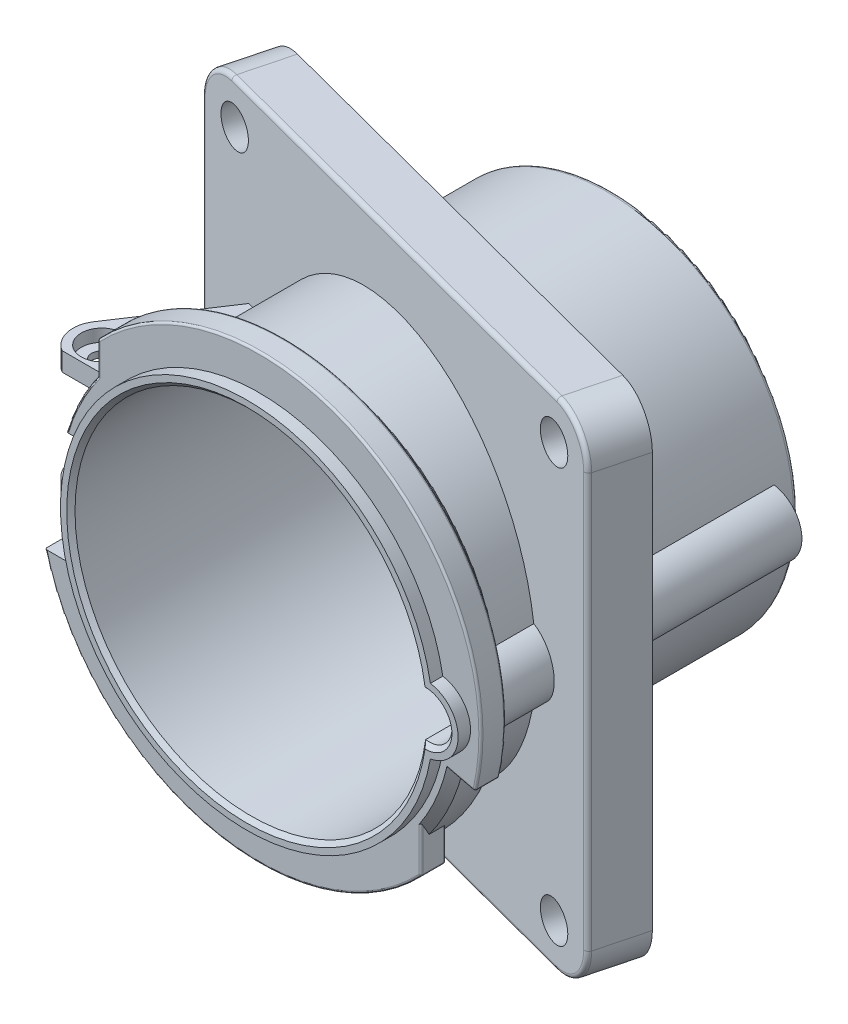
ISO-10303-21;
HEADER;
FILE_DESCRIPTION(('STEP AP214'),'2;1');
FILE_NAME('part.step','',(''),(''),'','','');
FILE_SCHEMA(('AUTOMOTIVE_DESIGN { 1 0 10303 214 1 1 1 1 }'));
ENDSEC;
DATA;
#1=APPLICATION_CONTEXT('core data for automotive mechanical design processes');
#2=APPLICATION_PROTOCOL_DEFINITION('international standard','automotive_design',2000,#1);
#3=PRODUCT_CONTEXT('',#1,'mechanical');
#4=PRODUCT('Part','Part','',(#3));
#5=PRODUCT_RELATED_PRODUCT_CATEGORY('part','',(#4));
#6=PRODUCT_DEFINITION_FORMATION('','',#4);
#7=PRODUCT_DEFINITION_CONTEXT('part definition',#1,'design');
#8=PRODUCT_DEFINITION('design','',#6,#7);
#9=PRODUCT_DEFINITION_SHAPE('','',#8);
#10=(LENGTH_UNIT() NAMED_UNIT(*) SI_UNIT(.MILLI.,.METRE.));
#11=(NAMED_UNIT(*) PLANE_ANGLE_UNIT() SI_UNIT($,.RADIAN.));
#12=(NAMED_UNIT(*) SI_UNIT($,.STERADIAN.) SOLID_ANGLE_UNIT());
#13=UNCERTAINTY_MEASURE_WITH_UNIT(LENGTH_MEASURE(1.E-05),#10,'distance_accuracy_value','');
#14=(GEOMETRIC_REPRESENTATION_CONTEXT(3) GLOBAL_UNCERTAINTY_ASSIGNED_CONTEXT((#13)) GLOBAL_UNIT_ASSIGNED_CONTEXT((#10,
#11,#12)) REPRESENTATION_CONTEXT('',''));
#15=CARTESIAN_POINT('',(0.,0.,0.));
#16=DIRECTION('',(0.,0.,1.));
#17=DIRECTION('',(1.,0.,0.));
#18=AXIS2_PLACEMENT_3D('',#15,#16,#17);
#19=CARTESIAN_POINT('',(-58.0000000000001,-29.,65.));
#20=DIRECTION('',(0.,1.,0.));
#21=DIRECTION('',(-1.,0.,0.));
#22=AXIS2_PLACEMENT_3D('',#19,#20,#21);
#23=CYLINDRICAL_SURFACE('',#22,2.5);
#24=CARTESIAN_POINT('',(-58.0000000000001,-11.5,65.));
#25=DIRECTION('',(0.,-1.,0.));
#26=DIRECTION('',(0.,0.,-1.));
#27=AXIS2_PLACEMENT_3D('',#24,#25,#26);
#28=CIRCLE('',#27,2.5);
#29=CARTESIAN_POINT('',(-58.0000000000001,-11.5,62.5));
#30=VERTEX_POINT('',#29);
#31=EDGE_CURVE('E420',#30,#30,#28,.T.);
#32=ORIENTED_EDGE('',*,*,#31,.F.);
#33=EDGE_LOOP('',(#32));
#34=FACE_BOUND('',#33,.T.);
#35=CARTESIAN_POINT('',(-58.0000000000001,-13.,65.));
#36=DIRECTION('',(0.,-1.,0.));
#37=DIRECTION('',(1.,0.,0.));
#38=AXIS2_PLACEMENT_3D('',#35,#36,#37);
#39=CIRCLE('',#38,2.5);
#40=CARTESIAN_POINT('',(-55.5000000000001,-13.,65.));
#41=VERTEX_POINT('',#40);
#42=EDGE_CURVE('E935',#41,#41,#39,.F.);
#43=ORIENTED_EDGE('',*,*,#42,.F.);
#44=EDGE_LOOP('',(#43));
#45=FACE_BOUND('',#44,.T.);
#46=ADVANCED_FACE('F36',(#34,#45),#23,.F.);
#47=CARTESIAN_POINT('',(-58.0000000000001,11.5,65.));
#48=DIRECTION('',(0.,1.,0.));
#49=DIRECTION('',(0.,0.,1.));
#50=AXIS2_PLACEMENT_3D('',#47,#48,#49);
#51=CIRCLE('',#50,2.5);
#52=CARTESIAN_POINT('',(-58.0000000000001,11.5,67.5));
#53=VERTEX_POINT('',#52);
#54=EDGE_CURVE('E423',#53,#53,#51,.T.);
#55=ORIENTED_EDGE('',*,*,#54,.F.);
#56=EDGE_LOOP('',(#55));
#57=FACE_BOUND('',#56,.T.);
#58=CARTESIAN_POINT('',(-58.0000000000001,13.,65.));
#59=DIRECTION('',(0.,1.,0.));
#60=DIRECTION('',(-1.,0.,0.));
#61=AXIS2_PLACEMENT_3D('',#58,#59,#60);
#62=CIRCLE('',#61,2.5);
#63=CARTESIAN_POINT('',(-60.5000000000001,13.,65.));
#64=VERTEX_POINT('',#63);
#65=EDGE_CURVE('E931',#64,#64,#62,.F.);
#66=ORIENTED_EDGE('',*,*,#65,.F.);
#67=EDGE_LOOP('',(#66));
#68=FACE_BOUND('',#67,.T.);
#69=ADVANCED_FACE('F838',(#57,#68),#23,.F.);
#70=CARTESIAN_POINT('',(-61.6055512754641,16.,71.));
#71=DIRECTION('',(0.,0.,1.));
#72=DIRECTION('',(0.,-1.,0.));
#73=AXIS2_PLACEMENT_3D('',#70,#71,#72);
#74=PLANE('',#73);
#75=DIRECTION('',(1.,0.,0.));
#76=VECTOR('',#75,1.);
#77=CARTESIAN_POINT('',(-61.6055512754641,-11.5,71.));
#78=LINE('',#77,#76);
#79=CARTESIAN_POINT('',(-61.6055512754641,-11.5,71.));
#80=VERTEX_POINT('',#79);
#81=CARTESIAN_POINT('',(-43.5057467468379,-11.5,71.));
#82=VERTEX_POINT('',#81);
#83=EDGE_CURVE('E432',#80,#82,#78,.T.);
#84=ORIENTED_EDGE('',*,*,#83,.F.);
#85=DIRECTION('',(0.,-1.,0.));
#86=VECTOR('',#85,1.);
#87=CARTESIAN_POINT('',(-61.6055512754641,16.,71.));
#88=LINE('',#87,#86);
#89=CARTESIAN_POINT('',(-61.6055512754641,-16.,71.));
#90=VERTEX_POINT('',#89);
#91=EDGE_CURVE('E458',#80,#90,#88,.T.);
#92=ORIENTED_EDGE('',*,*,#91,.T.);
#93=DIRECTION('',(-1.,0.,0.));
#94=VECTOR('',#93,1.);
#95=CARTESIAN_POINT('',(-61.6055512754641,-16.,71.));
#96=LINE('',#95,#94);
#97=CARTESIAN_POINT('',(-42.0594816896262,-16.,71.));
#98=VERTEX_POINT('',#97);
#99=EDGE_CURVE('E442',#98,#90,#96,.T.);
#100=ORIENTED_EDGE('',*,*,#99,.F.);
#101=CARTESIAN_POINT('',(0.,0.,71.));
#102=DIRECTION('',(0.,0.,1.));
#103=DIRECTION('',(0.,-1.,0.));
#104=AXIS2_PLACEMENT_3D('',#101,#102,#103);
#105=CIRCLE('',#104,45.);
#106=EDGE_CURVE('E916',#82,#98,#105,.T.);
#107=ORIENTED_EDGE('',*,*,#106,.F.);
#108=EDGE_LOOP('',(#84,#92,#100,#107));
#109=FACE_BOUND('',#108,.T.);
#110=ADVANCED_FACE('F844',(#109),#74,.T.);
#111=CARTESIAN_POINT('',(-58.0000000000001,16.,65.));
#112=DIRECTION('',(0.,-1.,0.));
#113=DIRECTION('',(1.,0.,0.));
#114=AXIS2_PLACEMENT_3D('',#111,#112,#113);
#115=CYLINDRICAL_SURFACE('',#114,7.00000000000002);
#116=CARTESIAN_POINT('',(-58.0000000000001,-11.5,65.));
#117=DIRECTION('',(0.,-1.,0.));
#118=DIRECTION('',(0.,0.,-1.));
#119=AXIS2_PLACEMENT_3D('',#116,#117,#118);
#120=CIRCLE('',#119,7.00000000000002);
#121=CARTESIAN_POINT('',(-63.8393767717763,-11.5,61.1397307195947));
#122=VERTEX_POINT('',#121);
#123=EDGE_CURVE('E897',#122,#80,#120,.F.);
#124=ORIENTED_EDGE('',*,*,#123,.F.);
#125=DIRECTION('',(0.,-1.,0.));
#126=VECTOR('',#125,1.);
#127=CARTESIAN_POINT('',(-63.8393767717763,16.,61.1397307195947));
#128=LINE('',#127,#126);
#129=CARTESIAN_POINT('',(-63.8393767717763,-16.,61.1397307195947));
#130=VERTEX_POINT('',#129);
#131=EDGE_CURVE('E453',#122,#130,#128,.T.);
#132=ORIENTED_EDGE('',*,*,#131,.T.);
#133=CARTESIAN_POINT('',(-58.0000000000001,-16.,65.));
#134=DIRECTION('',(0.,-1.,0.));
#135=DIRECTION('',(1.,0.,0.));
#136=AXIS2_PLACEMENT_3D('',#133,#134,#135);
#137=CIRCLE('',#136,7.00000000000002);
#138=EDGE_CURVE('E436',#90,#130,#137,.T.);
#139=ORIENTED_EDGE('',*,*,#138,.F.);
#140=ORIENTED_EDGE('',*,*,#91,.F.);
#141=EDGE_LOOP('',(#124,#132,#139,#140));
#142=FACE_BOUND('',#141,.T.);
#143=ADVANCED_FACE('F881',(#142),#115,.T.);
#144=CARTESIAN_POINT('',(61.7063279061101,60.,67.5996484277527));
#145=DIRECTION('',(-0.253359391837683,0.,0.967372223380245));
#146=DIRECTION('',(0.967372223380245,0.,0.253359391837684));
#147=AXIS2_PLACEMENT_3D('',#144,#145,#146);
#148=PLANE('',#147);
#149=DIRECTION('',(0.,-1.,0.));
#150=VECTOR('',#149,1.);
#151=CARTESIAN_POINT('',(60.6180341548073,60.,67.3146191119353));
#152=LINE('',#151,#150);
#153=CARTESIAN_POINT('',(60.6180341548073,-50.,67.3146191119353));
#154=VERTEX_POINT('',#153);
#155=CARTESIAN_POINT('',(60.6180341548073,50.,67.3146191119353));
#156=VERTEX_POINT('',#155);
#157=EDGE_CURVE('E928',#154,#156,#152,.F.);
#158=ORIENTED_EDGE('',*,*,#157,.T.);
#159=CARTESIAN_POINT('',(51.9116841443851,50.,65.0343845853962));
#160=DIRECTION('',(-0.253359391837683,0.,0.967372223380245));
#161=DIRECTION('',(0.967372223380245,0.,0.253359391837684));
#162=AXIS2_PLACEMENT_3D('',#159,#160,#161);
#163=CIRCLE('',#162,9.);
#164=CARTESIAN_POINT('',(51.9116841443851,59.,65.0343845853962));
#165=VERTEX_POINT('',#164);
#166=EDGE_CURVE('E953',#156,#165,#163,.T.);
#167=ORIENTED_EDGE('',*,*,#166,.T.);
#168=DIRECTION('',(-0.967372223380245,0.,-0.253359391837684));
#169=VECTOR('',#168,1.);
#170=CARTESIAN_POINT('',(-54.4990283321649,59.,37.1649122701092));
#171=LINE('',#170,#169);
#172=CARTESIAN_POINT('',(-54.4990283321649,59.,37.1649122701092));
#173=VERTEX_POINT('',#172);
#174=EDGE_CURVE('E951',#165,#173,#171,.T.);
#175=ORIENTED_EDGE('',*,*,#174,.T.);
#176=CARTESIAN_POINT('',(-54.4990283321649,50.,37.1649122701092));
#177=DIRECTION('',(-0.253359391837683,0.,0.967372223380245));
#178=DIRECTION('',(0.967372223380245,0.,0.253359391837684));
#179=AXIS2_PLACEMENT_3D('',#176,#177,#178);
#180=CIRCLE('',#179,9.);
#181=CARTESIAN_POINT('',(-63.2053783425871,50.,34.8846777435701));
#182=VERTEX_POINT('',#181);
#183=EDGE_CURVE('E949',#173,#182,#180,.T.);
#184=ORIENTED_EDGE('',*,*,#183,.T.);
#185=DIRECTION('',(0.,-1.,0.));
#186=VECTOR('',#185,1.);
#187=CARTESIAN_POINT('',(-63.2053783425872,60.,34.8846777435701));
#188=LINE('',#187,#186);
#189=CARTESIAN_POINT('',(-63.2053783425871,-50.,34.8846777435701));
#190=VERTEX_POINT('',#189);
#191=EDGE_CURVE('E947',#182,#190,#188,.T.);
#192=ORIENTED_EDGE('',*,*,#191,.T.);
#193=CARTESIAN_POINT('',(-54.4990283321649,-50.,37.1649122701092));
#194=DIRECTION('',(-0.253359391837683,0.,0.967372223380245));
#195=DIRECTION('',(0.967372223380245,0.,0.253359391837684));
#196=AXIS2_PLACEMENT_3D('',#193,#194,#195);
#197=CIRCLE('',#196,9.);
#198=CARTESIAN_POINT('',(-54.4990283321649,-59.,37.1649122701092));
#199=VERTEX_POINT('',#198);
#200=EDGE_CURVE('E945',#190,#199,#197,.T.);
#201=ORIENTED_EDGE('',*,*,#200,.T.);
#202=DIRECTION('',(-0.967372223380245,0.,-0.253359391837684));
#203=VECTOR('',#202,1.);
#204=CARTESIAN_POINT('',(61.7063279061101,-59.,67.5996484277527));
#205=LINE('',#204,#203);
#206=CARTESIAN_POINT('',(51.9116841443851,-59.,65.0343845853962));
#207=VERTEX_POINT('',#206);
#208=EDGE_CURVE('E943',#199,#207,#205,.F.);
#209=ORIENTED_EDGE('',*,*,#208,.T.);
#210=CARTESIAN_POINT('',(51.9116841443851,-50.,65.0343845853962));
#211=DIRECTION('',(-0.253359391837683,0.,0.967372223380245));
#212=DIRECTION('',(0.967372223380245,0.,0.253359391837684));
#213=AXIS2_PLACEMENT_3D('',#210,#211,#212);
#214=CIRCLE('',#213,9.);
#215=EDGE_CURVE('E941',#207,#154,#214,.T.);
#216=ORIENTED_EDGE('',*,*,#215,.T.);
#217=EDGE_LOOP('',(#158,#167,#175,#184,#192,#201,#209,#216));
#218=FACE_BOUND('',#217,.T.);
#219=CARTESIAN_POINT('',(50.9444279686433,-50.,64.7810555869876));
#220=DIRECTION('',(-0.253359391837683,0.,0.967372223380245));
#221=DIRECTION('',(0.967372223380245,0.,0.253359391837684));
#222=AXIS2_PLACEMENT_3D('',#219,#220,#221);
#223=CIRCLE('',#222,4.6336449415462);
#224=CARTESIAN_POINT('',(55.4268873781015,-50.,65.9550330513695));
#225=VERTEX_POINT('',#224);
#226=EDGE_CURVE('E543',#225,#225,#223,.T.);
#227=ORIENTED_EDGE('',*,*,#226,.F.);
#228=EDGE_LOOP('',(#227));
#229=FACE_BOUND('',#228,.T.);
#230=CARTESIAN_POINT('',(-53.5317721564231,-49.9999999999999,37.4182412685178));
#231=DIRECTION('',(-0.253359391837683,0.,0.967372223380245));
#232=DIRECTION('',(0.967372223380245,0.,0.253359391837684));
#233=AXIS2_PLACEMENT_3D('',#230,#231,#232);
#234=CIRCLE('',#233,4.63364494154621);
#235=CARTESIAN_POINT('',(-49.0493127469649,-49.9999999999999,38.5922187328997));
#236=VERTEX_POINT('',#235);
#237=EDGE_CURVE('E600',#236,#236,#234,.T.);
#238=ORIENTED_EDGE('',*,*,#237,.F.);
#239=EDGE_LOOP('',(#238));
#240=FACE_BOUND('',#239,.T.);
#241=CARTESIAN_POINT('',(-53.5317721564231,49.9999999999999,37.4182412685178));
#242=DIRECTION('',(-0.253359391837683,0.,0.967372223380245));
#243=DIRECTION('',(0.967372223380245,0.,0.253359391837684));
#244=AXIS2_PLACEMENT_3D('',#241,#242,#243);
#245=CIRCLE('',#244,4.63364494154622);
#246=CARTESIAN_POINT('',(-49.0493127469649,49.9999999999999,38.5922187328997));
#247=VERTEX_POINT('',#246);
#248=EDGE_CURVE('E597',#247,#247,#245,.T.);
#249=ORIENTED_EDGE('',*,*,#248,.F.);
#250=EDGE_LOOP('',(#249));
#251=FACE_BOUND('',#250,.T.);
#252=CARTESIAN_POINT('',(50.9444279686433,50.,64.7810555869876));
#253=DIRECTION('',(-0.253359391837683,0.,0.967372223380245));
#254=DIRECTION('',(0.967372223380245,0.,0.253359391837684));
#255=AXIS2_PLACEMENT_3D('',#252,#253,#254);
#256=CIRCLE('',#255,4.63364494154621);
#257=CARTESIAN_POINT('',(55.4268873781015,50.,65.9550330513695));
#258=VERTEX_POINT('',#257);
#259=EDGE_CURVE('E538',#258,#258,#256,.T.);
#260=ORIENTED_EDGE('',*,*,#259,.F.);
#261=EDGE_LOOP('',(#260));
#262=FACE_BOUND('',#261,.T.);
#263=DIRECTION('',(0.,-1.,0.));
#264=VECTOR('',#263,1.);
#265=CARTESIAN_POINT('',(-48.9508204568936,60.,38.6180143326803));
#266=LINE('',#265,#264);
#267=CARTESIAN_POINT('',(-48.9508204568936,16.,38.6180143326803));
#268=VERTEX_POINT('',#267);
#269=CARTESIAN_POINT('',(-48.9508204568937,-16.,38.6180143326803));
#270=VERTEX_POINT('',#269);
#271=EDGE_CURVE('E908',#268,#270,#266,.T.);
#272=ORIENTED_EDGE('',*,*,#271,.F.);
#273=DIRECTION('',(0.967372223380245,0.,0.253359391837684));
#274=VECTOR('',#273,1.);
#275=CARTESIAN_POINT('',(61.7063279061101,16.,67.5996484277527));
#276=LINE('',#275,#274);
#277=CARTESIAN_POINT('',(-42.0594816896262,16.,40.4228887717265));
#278=VERTEX_POINT('',#277);
#279=EDGE_CURVE('E463',#268,#278,#276,.T.);
#280=ORIENTED_EDGE('',*,*,#279,.T.);
#281=CARTESIAN_POINT('',(0.,0.,51.4384673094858));
#282=DIRECTION('',(-0.253359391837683,0.,0.967372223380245));
#283=DIRECTION('',(-0.967372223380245,0.,-0.253359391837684));
#284=AXIS2_PLACEMENT_3D('',#281,#282,#283);
#285=ELLIPSE('',#284,46.5177714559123,45.);
#286=CARTESIAN_POINT('',(44.3023255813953,7.89328499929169,63.0414573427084));
#287=VERTEX_POINT('',#286);
#288=EDGE_CURVE('E552',#287,#278,#285,.T.);
#289=ORIENTED_EDGE('',*,*,#288,.F.);
#290=CARTESIAN_POINT('',(43.,0.,62.7003720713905));
#291=DIRECTION('',(-0.253359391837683,0.,0.967372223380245));
#292=DIRECTION('',(0.967372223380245,0.,0.253359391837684));
#293=AXIS2_PLACEMENT_3D('',#290,#291,#292);
#294=ELLIPSE('',#293,8.26982603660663,8.);
#295=CARTESIAN_POINT('',(44.3023255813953,-7.89328499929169,63.0414573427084));
#296=VERTEX_POINT('',#295);
#297=EDGE_CURVE('E547',#287,#296,#294,.F.);
#298=ORIENTED_EDGE('',*,*,#297,.T.);
#299=CARTESIAN_POINT('',(-42.0594816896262,-16.,40.4228887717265));
#300=VERTEX_POINT('',#299);
#301=EDGE_CURVE('E550',#300,#296,#285,.T.);
#302=ORIENTED_EDGE('',*,*,#301,.F.);
#303=DIRECTION('',(0.967372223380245,0.,0.253359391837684));
#304=VECTOR('',#303,1.);
#305=CARTESIAN_POINT('',(61.7063279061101,-16.,67.5996484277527));
#306=LINE('',#305,#304);
#307=EDGE_CURVE('E457',#270,#300,#306,.T.);
#308=ORIENTED_EDGE('',*,*,#307,.F.);
#309=EDGE_LOOP('',(#272,#280,#289,#298,#302,#308));
#310=FACE_BOUND('',#309,.T.);
#311=ADVANCED_FACE('F810',(#218,#229,#240,#251,#262,#310),#148,.T.);
#312=CARTESIAN_POINT('',(0.,0.,88.));
#313=DIRECTION('',(0.,0.,-1.));
#314=DIRECTION('',(-1.,0.,0.));
#315=AXIS2_PLACEMENT_3D('',#312,#313,#314);
#316=CYLINDRICAL_SURFACE('',#315,45.);
#317=CARTESIAN_POINT('',(-42.0594816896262,16.,71.));
#318=VERTEX_POINT('',#317);
#319=CARTESIAN_POINT('',(-43.5057467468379,11.5,71.));
#320=VERTEX_POINT('',#319);
#321=EDGE_CURVE('E403',#318,#320,#105,.T.);
#322=ORIENTED_EDGE('',*,*,#321,.T.);
#323=DIRECTION('',(0.,0.,1.));
#324=VECTOR('',#323,1.);
#325=CARTESIAN_POINT('',(-43.5057467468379,11.5,43.));
#326=LINE('',#325,#324);
#327=CARTESIAN_POINT('',(-43.5057467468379,11.5,43.));
#328=VERTEX_POINT('',#327);
#329=EDGE_CURVE('E396',#328,#320,#326,.T.);
#330=ORIENTED_EDGE('',*,*,#329,.F.);
#331=CARTESIAN_POINT('',(0.,0.,43.));
#332=DIRECTION('',(0.,0.,-1.));
#333=DIRECTION('',(1.,0.,0.));
#334=AXIS2_PLACEMENT_3D('',#331,#332,#333);
#335=CIRCLE('',#334,45.);
#336=CARTESIAN_POINT('',(-43.5057467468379,-11.5,43.));
#337=VERTEX_POINT('',#336);
#338=EDGE_CURVE('E401',#337,#328,#335,.T.);
#339=ORIENTED_EDGE('',*,*,#338,.F.);
#340=DIRECTION('',(0.,0.,1.));
#341=VECTOR('',#340,1.);
#342=CARTESIAN_POINT('',(-43.5057467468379,-11.5,43.));
#343=LINE('',#342,#341);
#344=EDGE_CURVE('E406',#337,#82,#343,.T.);
#345=ORIENTED_EDGE('',*,*,#344,.T.);
#346=ORIENTED_EDGE('',*,*,#106,.T.);
#347=DIRECTION('',(0.,0.,-1.));
#348=VECTOR('',#347,1.);
#349=CARTESIAN_POINT('',(-42.0594816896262,-16.,88.));
#350=LINE('',#349,#348);
#351=EDGE_CURVE('E914',#98,#300,#350,.T.);
#352=ORIENTED_EDGE('',*,*,#351,.T.);
#353=ORIENTED_EDGE('',*,*,#301,.T.);
#354=DIRECTION('',(0.,0.,1.));
#355=VECTOR('',#354,1.);
#356=CARTESIAN_POINT('',(44.3023255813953,-7.89328499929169,46.5));
#357=LINE('',#356,#355);
#358=CARTESIAN_POINT('',(44.3023255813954,-7.89328499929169,75.));
#359=VERTEX_POINT('',#358);
#360=EDGE_CURVE('E585',#296,#359,#357,.T.);
#361=ORIENTED_EDGE('',*,*,#360,.T.);
#362=CARTESIAN_POINT('',(0.,0.,75.));
#363=DIRECTION('',(0.,0.,1.));
#364=DIRECTION('',(1.,0.,0.));
#365=AXIS2_PLACEMENT_3D('',#362,#363,#364);
#366=CIRCLE('',#365,45.);
#367=CARTESIAN_POINT('',(-42.9272640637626,-13.5,75.));
#368=VERTEX_POINT('',#367);
#369=EDGE_CURVE('E500',#368,#359,#366,.T.);
#370=ORIENTED_EDGE('',*,*,#369,.F.);
#371=DIRECTION('',(0.,0.,1.));
#372=VECTOR('',#371,1.);
#373=CARTESIAN_POINT('',(-42.9272640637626,-13.5,74.));
#374=LINE('',#373,#372);
#375=CARTESIAN_POINT('',(-42.9272640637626,-13.5,85.));
#376=VERTEX_POINT('',#375);
#377=EDGE_CURVE('E477',#368,#376,#374,.T.);
#378=ORIENTED_EDGE('',*,*,#377,.T.);
#379=CARTESIAN_POINT('',(0.,0.,85.));
#380=DIRECTION('',(0.,0.,1.));
#381=DIRECTION('',(1.,0.,0.));
#382=AXIS2_PLACEMENT_3D('',#379,#380,#381);
#383=CIRCLE('',#382,45.);
#384=CARTESIAN_POINT('',(44.3023255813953,-7.89328499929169,85.));
#385=VERTEX_POINT('',#384);
#386=EDGE_CURVE('E505',#376,#385,#383,.T.);
#387=ORIENTED_EDGE('',*,*,#386,.T.);
#388=CARTESIAN_POINT('',(44.3023255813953,-7.89328499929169,88.));
#389=VERTEX_POINT('',#388);
#390=EDGE_CURVE('E579',#385,#389,#357,.T.);
#391=ORIENTED_EDGE('',*,*,#390,.T.);
#392=CARTESIAN_POINT('',(0.,0.,88.));
#393=DIRECTION('',(0.,0.,1.));
#394=DIRECTION('',(1.,0.,0.));
#395=AXIS2_PLACEMENT_3D('',#392,#393,#394);
#396=CIRCLE('',#395,45.);
#397=CARTESIAN_POINT('',(44.3023255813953,7.8932849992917,88.));
#398=VERTEX_POINT('',#397);
#399=EDGE_CURVE('E584',#398,#389,#396,.T.);
#400=ORIENTED_EDGE('',*,*,#399,.F.);
#401=DIRECTION('',(0.,0.,1.));
#402=VECTOR('',#401,1.);
#403=CARTESIAN_POINT('',(44.3023255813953,7.89328499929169,46.5));
#404=LINE('',#403,#402);
#405=CARTESIAN_POINT('',(44.3023255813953,7.89328499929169,85.));
#406=VERTEX_POINT('',#405);
#407=EDGE_CURVE('E576',#398,#406,#404,.F.);
#408=ORIENTED_EDGE('',*,*,#407,.T.);
#409=CARTESIAN_POINT('',(-42.9272640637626,13.5,85.));
#410=VERTEX_POINT('',#409);
#411=EDGE_CURVE('E501',#406,#410,#383,.T.);
#412=ORIENTED_EDGE('',*,*,#411,.T.);
#413=DIRECTION('',(0.,0.,1.));
#414=VECTOR('',#413,1.);
#415=CARTESIAN_POINT('',(-42.9272640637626,13.5,74.));
#416=LINE('',#415,#414);
#417=CARTESIAN_POINT('',(-42.9272640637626,13.5,75.));
#418=VERTEX_POINT('',#417);
#419=EDGE_CURVE('E474',#418,#410,#416,.T.);
#420=ORIENTED_EDGE('',*,*,#419,.F.);
#421=CARTESIAN_POINT('',(44.3023255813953,7.89328499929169,75.));
#422=VERTEX_POINT('',#421);
#423=EDGE_CURVE('E506',#422,#418,#366,.T.);
#424=ORIENTED_EDGE('',*,*,#423,.F.);
#425=EDGE_CURVE('E580',#422,#287,#404,.F.);
#426=ORIENTED_EDGE('',*,*,#425,.T.);
#427=ORIENTED_EDGE('',*,*,#288,.T.);
#428=DIRECTION('',(0.,0.,-1.));
#429=VECTOR('',#428,1.);
#430=CARTESIAN_POINT('',(-42.0594816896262,16.,88.));
#431=LINE('',#430,#429);
#432=EDGE_CURVE('E919',#318,#278,#431,.T.);
#433=ORIENTED_EDGE('',*,*,#432,.F.);
#434=EDGE_LOOP('',(#322,#330,#339,#345,#346,#352,#353,#361,#370,#378,#387,#391,#400,#408,#412,
#420,#424,#426,#427,#433));
#435=FACE_BOUND('',#434,.T.);
#436=ADVANCED_FACE('F398',(#435),#316,.T.);
#437=CARTESIAN_POINT('',(0.,0.,85.));
#438=DIRECTION('',(0.,0.,-1.));
#439=DIRECTION('',(-1.,0.,0.));
#440=AXIS2_PLACEMENT_3D('',#437,#438,#439);
#441=CYLINDRICAL_SURFACE('',#440,48.5);
#442=DIRECTION('',(0.,0.,1.));
#443=VECTOR('',#442,1.);
#444=CARTESIAN_POINT('',(-46.5832587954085,13.5,74.));
#445=LINE('',#444,#443);
#446=CARTESIAN_POINT('',(-46.5832587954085,13.5,75.5));
#447=VERTEX_POINT('',#446);
#448=CARTESIAN_POINT('',(-46.5832587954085,13.5,84.5));
#449=VERTEX_POINT('',#448);
#450=EDGE_CURVE('E486',#447,#449,#445,.T.);
#451=ORIENTED_EDGE('',*,*,#450,.T.);
#452=CARTESIAN_POINT('',(0.,0.,84.5));
#453=DIRECTION('',(0.,0.,1.));
#454=DIRECTION('',(1.,0.,0.));
#455=AXIS2_PLACEMENT_3D('',#452,#453,#454);
#456=CIRCLE('',#455,48.5);
#457=CARTESIAN_POINT('',(-39.,28.831406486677,84.5));
#458=VERTEX_POINT('',#457);
#459=EDGE_CURVE('E1049',#449,#458,#456,.F.);
#460=ORIENTED_EDGE('',*,*,#459,.T.);
#461=DIRECTION('',(0.,0.,1.));
#462=VECTOR('',#461,1.);
#463=CARTESIAN_POINT('',(-39.,28.831406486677,74.));
#464=LINE('',#463,#462);
#465=CARTESIAN_POINT('',(-39.,28.831406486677,79.));
#466=VERTEX_POINT('',#465);
#467=EDGE_CURVE('E493',#466,#458,#464,.T.);
#468=ORIENTED_EDGE('',*,*,#467,.F.);
#469=CARTESIAN_POINT('',(0.,0.,79.));
#470=DIRECTION('',(0.,0.,1.));
#471=DIRECTION('',(1.,0.,0.));
#472=AXIS2_PLACEMENT_3D('',#469,#470,#471);
#473=CIRCLE('',#472,48.5);
#474=CARTESIAN_POINT('',(48.1075581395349,6.15734113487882,79.));
#475=VERTEX_POINT('',#474);
#476=EDGE_CURVE('E634',#475,#466,#473,.T.);
#477=ORIENTED_EDGE('',*,*,#476,.F.);
#478=DIRECTION('',(0.,0.,-1.));
#479=VECTOR('',#478,1.);
#480=CARTESIAN_POINT('',(48.1075581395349,6.15734113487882,80.));
#481=LINE('',#480,#479);
#482=CARTESIAN_POINT('',(48.1075581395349,6.15734113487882,75.5));
#483=VERTEX_POINT('',#482);
#484=EDGE_CURVE('E504',#483,#475,#481,.F.);
#485=ORIENTED_EDGE('',*,*,#484,.F.);
#486=CARTESIAN_POINT('',(0.,0.,75.5));
#487=DIRECTION('',(0.,0.,1.));
#488=DIRECTION('',(1.,0.,0.));
#489=AXIS2_PLACEMENT_3D('',#486,#487,#488);
#490=CIRCLE('',#489,48.5);
#491=EDGE_CURVE('E1740',#483,#447,#490,.T.);
#492=ORIENTED_EDGE('',*,*,#491,.T.);
#493=EDGE_LOOP('',(#451,#460,#468,#477,#485,#492));
#494=FACE_BOUND('',#493,.T.);
#495=ADVANCED_FACE('F809',(#494),#441,.T.);
#496=CARTESIAN_POINT('',(0.,0.,75.));
#497=DIRECTION('',(0.,0.,1.));
#498=DIRECTION('',(1.,0.,0.));
#499=AXIS2_PLACEMENT_3D('',#496,#497,#498);
#500=PLANE('',#499);
#501=DIRECTION('',(-1.,0.,0.));
#502=VECTOR('',#501,1.);
#503=CARTESIAN_POINT('',(0.,13.5,75.));
#504=LINE('',#503,#502);
#505=CARTESIAN_POINT('',(-46.0624575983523,13.5,75.));
#506=VERTEX_POINT('',#505);
#507=EDGE_CURVE('E646',#418,#506,#504,.T.);
#508=ORIENTED_EDGE('',*,*,#507,.T.);
#509=CARTESIAN_POINT('',(0.,0.,75.));
#510=DIRECTION('',(0.,0.,1.));
#511=DIRECTION('',(1.,0.,0.));
#512=AXIS2_PLACEMENT_3D('',#509,#510,#511);
#513=CIRCLE('',#512,48.);
#514=CARTESIAN_POINT('',(47.546511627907,6.58249436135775,75.));
#515=VERTEX_POINT('',#514);
#516=EDGE_CURVE('E735',#506,#515,#513,.F.);
#517=ORIENTED_EDGE('',*,*,#516,.T.);
#518=CARTESIAN_POINT('',(43.,0.,75.));
#519=DIRECTION('',(0.,0.,1.));
#520=DIRECTION('',(1.,0.,0.));
#521=AXIS2_PLACEMENT_3D('',#518,#519,#520);
#522=CIRCLE('',#521,8.);
#523=EDGE_CURVE('E513',#422,#515,#522,.F.);
#524=ORIENTED_EDGE('',*,*,#523,.F.);
#525=ORIENTED_EDGE('',*,*,#423,.T.);
#526=EDGE_LOOP('',(#508,#517,#524,#525));
#527=FACE_BOUND('',#526,.T.);
#528=ADVANCED_FACE('F1422',(#527),#500,.F.);
#529=CARTESIAN_POINT('',(0.,0.,79.));
#530=DIRECTION('',(0.,0.,1.));
#531=DIRECTION('',(1.,0.,0.));
#532=AXIS2_PLACEMENT_3D('',#529,#530,#531);
#533=CYLINDRICAL_SURFACE('',#532,53.5);
#534=DIRECTION('',(0.,0.,1.));
#535=VECTOR('',#534,1.);
#536=CARTESIAN_POINT('',(-51.7687164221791,-13.5,74.));
#537=LINE('',#536,#535);
#538=CARTESIAN_POINT('',(-51.7687164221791,-13.5,79.5));
#539=VERTEX_POINT('',#538);
#540=CARTESIAN_POINT('',(-51.7687164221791,-13.5,84.5));
#541=VERTEX_POINT('',#540);
#542=EDGE_CURVE('E473',#539,#541,#537,.T.);
#543=ORIENTED_EDGE('',*,*,#542,.F.);
#544=CARTESIAN_POINT('',(0.,0.,79.5));
#545=DIRECTION('',(0.,0.,1.));
#546=DIRECTION('',(1.,0.,0.));
#547=AXIS2_PLACEMENT_3D('',#544,#545,#546);
#548=CIRCLE('',#547,53.5);
#549=CARTESIAN_POINT('',(38.8632075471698,-36.7682077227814,79.5));
#550=VERTEX_POINT('',#549);
#551=EDGE_CURVE('E758',#539,#550,#548,.T.);
#552=ORIENTED_EDGE('',*,*,#551,.T.);
#553=DIRECTION('',(0.,0.,1.));
#554=VECTOR('',#553,1.);
#555=CARTESIAN_POINT('',(38.8632075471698,-36.7682077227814,79.));
#556=LINE('',#555,#554);
#557=CARTESIAN_POINT('',(38.8632075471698,-36.7682077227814,84.5));
#558=VERTEX_POINT('',#557);
#559=EDGE_CURVE('E1787',#550,#558,#556,.T.);
#560=ORIENTED_EDGE('',*,*,#559,.T.);
#561=CARTESIAN_POINT('',(0.,0.,84.5));
#562=DIRECTION('',(0.,0.,1.));
#563=DIRECTION('',(1.,0.,0.));
#564=AXIS2_PLACEMENT_3D('',#561,#562,#563);
#565=CIRCLE('',#564,53.5);
#566=EDGE_CURVE('E1788',#558,#541,#565,.F.);
#567=ORIENTED_EDGE('',*,*,#566,.T.);
#568=EDGE_LOOP('',(#543,#552,#560,#567));
#569=FACE_BOUND('',#568,.T.);
#570=ADVANCED_FACE('F1430',(#569),#533,.T.);
#571=CARTESIAN_POINT('',(0.,0.,79.));
#572=DIRECTION('',(0.,0.,1.));
#573=DIRECTION('',(1.,0.,0.));
#574=AXIS2_PLACEMENT_3D('',#571,#572,#573);
#575=PLANE('',#574);
#576=CARTESIAN_POINT('',(-46.5832587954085,-13.5,79.));
#577=VERTEX_POINT('',#576);
#578=CARTESIAN_POINT('',(38.5,-29.4957624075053,79.));
#579=VERTEX_POINT('',#578);
#580=EDGE_CURVE('E638',#577,#579,#473,.T.);
#581=ORIENTED_EDGE('',*,*,#580,.T.);
#582=DIRECTION('',(0.,-1.,0.));
#583=VECTOR('',#582,1.);
#584=CARTESIAN_POINT('',(38.5,0.,79.));
#585=LINE('',#584,#583);
#586=CARTESIAN_POINT('',(38.5,-36.4245796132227,79.));
#587=VERTEX_POINT('',#586);
#588=EDGE_CURVE('E1774',#579,#587,#585,.T.);
#589=ORIENTED_EDGE('',*,*,#588,.T.);
#590=CARTESIAN_POINT('',(0.,0.,79.));
#591=DIRECTION('',(0.,0.,1.));
#592=DIRECTION('',(1.,0.,0.));
#593=AXIS2_PLACEMENT_3D('',#590,#591,#592);
#594=CIRCLE('',#593,53.);
#595=CARTESIAN_POINT('',(-51.2518292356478,-13.5,79.));
#596=VERTEX_POINT('',#595);
#597=EDGE_CURVE('E1779',#587,#596,#594,.F.);
#598=ORIENTED_EDGE('',*,*,#597,.T.);
#599=DIRECTION('',(1.,0.,0.));
#600=VECTOR('',#599,1.);
#601=CARTESIAN_POINT('',(0.,-13.5,79.));
#602=LINE('',#601,#600);
#603=EDGE_CURVE('E484',#596,#577,#602,.T.);
#604=ORIENTED_EDGE('',*,*,#603,.T.);
#605=EDGE_LOOP('',(#581,#589,#598,#604));
#606=FACE_BOUND('',#605,.T.);
#607=ADVANCED_FACE('F1439',(#606),#575,.F.);
#608=CARTESIAN_POINT('',(43.,0.,4.99999999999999));
#609=DIRECTION('',(0.,0.,1.));
#610=DIRECTION('',(1.,0.,0.));
#611=AXIS2_PLACEMENT_3D('',#608,#609,#610);
#612=CYLINDRICAL_SURFACE('',#611,8.);
#613=ORIENTED_EDGE('',*,*,#523,.T.);
#614=CARTESIAN_POINT('',(47.546511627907,6.58249436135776,75.));
#615=CARTESIAN_POINT('',(47.5677038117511,6.56785750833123,75.0000058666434));
#616=CARTESIAN_POINT('',(47.5888097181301,6.55312773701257,75.0010811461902));
#617=CARTESIAN_POINT('',(47.6307494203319,6.52355874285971,75.0053566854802));
#618=CARTESIAN_POINT('',(47.6515830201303,6.50871945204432,75.0085583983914));
#619=CARTESIAN_POINT('',(47.7137753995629,6.46397152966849,75.021390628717));
#620=CARTESIAN_POINT('',(47.754521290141,6.43404332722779,75.0342479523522));
#621=CARTESIAN_POINT('',(47.8241955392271,6.38189587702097,75.0648547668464));
#622=CARTESIAN_POINT('',(47.8537292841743,6.35944908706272,75.0808678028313));
#623=CARTESIAN_POINT('',(47.9101402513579,6.31599377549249,75.1184558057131));
#624=CARTESIAN_POINT('',(47.9370254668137,6.29498098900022,75.140013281));
#625=CARTESIAN_POINT('',(47.9795065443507,6.26139105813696,75.1817541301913));
#626=CARTESIAN_POINT('',(47.9960764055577,6.24816845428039,75.2004260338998));
#627=CARTESIAN_POINT('',(48.0267096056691,6.22354997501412,75.2408151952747));
#628=CARTESIAN_POINT('',(48.0407757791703,6.21215203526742,75.2625289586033));
#629=CARTESIAN_POINT('',(48.0629048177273,6.19412255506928,75.3039309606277));
#630=CARTESIAN_POINT('',(48.07160821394,6.18699299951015,75.3230573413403));
#631=CARTESIAN_POINT('',(48.0864516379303,6.17479570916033,75.3628752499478));
#632=CARTESIAN_POINT('',(48.0925980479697,6.16972284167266,75.3835627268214));
#633=CARTESIAN_POINT('',(48.1006174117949,6.16309356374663,75.4202322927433));
#634=CARTESIAN_POINT('',(48.10319904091,6.16095514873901,75.4359563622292));
#635=CARTESIAN_POINT('',(48.1066791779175,6.1580702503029,75.4677794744));
#636=CARTESIAN_POINT('',(48.1075706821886,6.15732955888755,75.4838797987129));
#637=CARTESIAN_POINT('',(48.1075581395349,6.15734113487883,75.5));
#638=B_SPLINE_CURVE_WITH_KNOTS('',3,(#614,#615,#616,#617,#618,#619,#620,#621,#622,#623,#624,
#625,#626,#627,#628,#629,#630,#631,#632,#633,#634,#635,#636,#637),.UNSPECIFIED.,.F.,.F.,(4,2,2,
2,2,2,2,2,2,2,2,4),(0.,0.0772085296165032,0.154469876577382,0.310089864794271,0.430917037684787,
0.551367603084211,0.635855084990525,0.720246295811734,0.786567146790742,0.852721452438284,
0.900807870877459,0.949093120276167),.UNSPECIFIED.);
#639=EDGE_CURVE('E780',#515,#483,#638,.T.);
#640=ORIENTED_EDGE('',*,*,#639,.T.);
#641=ORIENTED_EDGE('',*,*,#484,.T.);
#642=CARTESIAN_POINT('',(43.,0.,79.));
#643=DIRECTION('',(0.,0.,1.));
#644=DIRECTION('',(1.,0.,0.));
#645=AXIS2_PLACEMENT_3D('',#642,#643,#644);
#646=CIRCLE('',#645,8.);
#647=CARTESIAN_POINT('',(48.1075581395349,-6.1573411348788,79.));
#648=VERTEX_POINT('',#647);
#649=EDGE_CURVE('E489',#475,#648,#646,.F.);
#650=ORIENTED_EDGE('',*,*,#649,.T.);
#651=DIRECTION('',(0.,0.,-1.));
#652=VECTOR('',#651,1.);
#653=CARTESIAN_POINT('',(48.1075581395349,-6.15734113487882,80.));
#654=LINE('',#653,#652);
#655=CARTESIAN_POINT('',(48.1075581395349,-6.15734113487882,75.5));
#656=VERTEX_POINT('',#655);
#657=EDGE_CURVE('E510',#648,#656,#654,.T.);
#658=ORIENTED_EDGE('',*,*,#657,.T.);
#659=CARTESIAN_POINT('',(48.1075581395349,-6.15734113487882,75.5));
#660=CARTESIAN_POINT('',(48.1076016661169,-6.15730131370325,75.4778356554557));
#661=CARTESIAN_POINT('',(48.1058989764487,-6.15871757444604,75.4557390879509));
#662=CARTESIAN_POINT('',(48.0993907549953,-6.16410926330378,75.4125433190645));
#663=CARTESIAN_POINT('',(48.0946158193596,-6.16805945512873,75.3914364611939));
#664=CARTESIAN_POINT('',(48.0823602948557,-6.17816090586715,75.350691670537));
#665=CARTESIAN_POINT('',(48.0748890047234,-6.18430459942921,75.3310489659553));
#666=CARTESIAN_POINT('',(48.0577039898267,-6.19836713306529,75.2934140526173));
#667=CARTESIAN_POINT('',(48.0479844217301,-6.20629059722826,75.2754263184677));
#668=CARTESIAN_POINT('',(48.0218636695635,-6.22746170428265,75.2334213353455));
#669=CARTESIAN_POINT('',(48.0044438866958,-6.24148335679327,75.2104287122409));
#670=CARTESIAN_POINT('',(47.9668449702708,-6.27144589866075,75.1682825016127));
#671=CARTESIAN_POINT('',(47.9466602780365,-6.28739064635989,75.1491368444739));
#672=CARTESIAN_POINT('',(47.8960173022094,-6.32695846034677,75.107743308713));
#673=CARTESIAN_POINT('',(47.8646201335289,-6.35115285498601,75.0871926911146));
#674=CARTESIAN_POINT('',(47.7992449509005,-6.40069844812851,75.0526473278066));
#675=CARTESIAN_POINT('',(47.7652632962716,-6.42605125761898,75.0386620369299));
#676=CARTESIAN_POINT('',(47.700629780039,-6.4734412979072,75.0185584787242));
#677=CARTESIAN_POINT('',(47.6702006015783,-6.49543178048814,75.0115988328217));
#678=CARTESIAN_POINT('',(47.608735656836,-6.53918910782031,75.0023432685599));
#679=CARTESIAN_POINT('',(47.5777040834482,-6.56095651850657,75.0000222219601));
#680=CARTESIAN_POINT('',(47.546511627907,-6.58249436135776,75.));
#681=B_SPLINE_CURVE_WITH_KNOTS('',3,(#659,#660,#661,#662,#663,#664,#665,#666,#667,#668,#669,
#670,#671,#672,#673,#674,#675,#676,#677,#678,#679,#680),.UNSPECIFIED.,.F.,.F.,(4,2,2,2,2,2,2,2,
2,2,4),(0.,0.0662751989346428,0.131900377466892,0.197301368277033,0.262874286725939,
0.358560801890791,0.454442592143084,0.587678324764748,0.721105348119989,0.835370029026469,
0.949014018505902),.UNSPECIFIED.);
#682=CARTESIAN_POINT('',(47.546511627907,-6.58249436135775,75.));
#683=VERTEX_POINT('',#682);
#684=EDGE_CURVE('E772',#656,#683,#681,.T.);
#685=ORIENTED_EDGE('',*,*,#684,.T.);
#686=EDGE_CURVE('E516',#683,#359,#522,.F.);
#687=ORIENTED_EDGE('',*,*,#686,.T.);
#688=ORIENTED_EDGE('',*,*,#360,.F.);
#689=ORIENTED_EDGE('',*,*,#297,.F.);
#690=ORIENTED_EDGE('',*,*,#425,.F.);
#691=EDGE_LOOP('',(#613,#640,#641,#650,#658,#685,#687,#688,#689,#690));
#692=FACE_BOUND('',#691,.T.);
#693=ADVANCED_FACE('F794',(#692),#612,.T.);
#694=DIRECTION('',(0.,0.,-1.));
#695=VECTOR('',#694,1.);
#696=CARTESIAN_POINT('',(-46.5832587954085,-13.5,85.));
#697=LINE('',#696,#695);
#698=CARTESIAN_POINT('',(-46.5832587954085,-13.5,75.5));
#699=VERTEX_POINT('',#698);
#700=EDGE_CURVE('E476',#577,#699,#697,.T.);
#701=ORIENTED_EDGE('',*,*,#700,.T.);
#702=CARTESIAN_POINT('',(0.,0.,75.5));
#703=DIRECTION('',(0.,0.,1.));
#704=DIRECTION('',(1.,0.,0.));
#705=AXIS2_PLACEMENT_3D('',#702,#703,#704);
#706=CIRCLE('',#705,48.5);
#707=EDGE_CURVE('E1804',#699,#656,#706,.T.);
#708=ORIENTED_EDGE('',*,*,#707,.T.);
#709=ORIENTED_EDGE('',*,*,#657,.F.);
#710=CARTESIAN_POINT('',(47.1663210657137,-11.2954927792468,79.));
#711=VERTEX_POINT('',#710);
#712=EDGE_CURVE('E633',#711,#648,#473,.T.);
#713=ORIENTED_EDGE('',*,*,#712,.F.);
#714=DIRECTION('',(0.,0.,1.));
#715=VECTOR('',#714,1.);
#716=CARTESIAN_POINT('',(47.1663210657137,-11.2954927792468,74.));
#717=LINE('',#716,#715);
#718=CARTESIAN_POINT('',(47.1663210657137,-11.2954927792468,83.));
#719=VERTEX_POINT('',#718);
#720=EDGE_CURVE('E490',#711,#719,#717,.T.);
#721=ORIENTED_EDGE('',*,*,#720,.T.);
#722=CARTESIAN_POINT('',(0.,0.,83.));
#723=DIRECTION('',(0.,0.,1.));
#724=DIRECTION('',(1.,0.,0.));
#725=AXIS2_PLACEMENT_3D('',#722,#723,#724);
#726=CIRCLE('',#725,48.5);
#727=CARTESIAN_POINT('',(39.,-28.831406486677,83.));
#728=VERTEX_POINT('',#727);
#729=EDGE_CURVE('E649',#719,#728,#726,.F.);
#730=ORIENTED_EDGE('',*,*,#729,.T.);
#731=DIRECTION('',(0.,0.,1.));
#732=VECTOR('',#731,1.);
#733=CARTESIAN_POINT('',(39.,-28.831406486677,74.));
#734=LINE('',#733,#732);
#735=CARTESIAN_POINT('',(39.,-28.831406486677,79.5));
#736=VERTEX_POINT('',#735);
#737=EDGE_CURVE('E487',#736,#728,#734,.T.);
#738=ORIENTED_EDGE('',*,*,#737,.F.);
#739=CARTESIAN_POINT('',(39.,-28.831406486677,79.5));
#740=CARTESIAN_POINT('',(39.0000393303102,-28.8313525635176,79.4794583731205));
#741=CARTESIAN_POINT('',(38.9987368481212,-28.8331151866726,79.4590035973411));
#742=CARTESIAN_POINT('',(38.993812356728,-28.8397750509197,79.4191505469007));
#743=CARTESIAN_POINT('',(38.9902193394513,-28.8446331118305,79.3997423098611));
#744=CARTESIAN_POINT('',(38.981084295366,-28.8569770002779,79.3624148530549));
#745=CARTESIAN_POINT('',(38.9755518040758,-28.8644499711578,79.3444888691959));
#746=CARTESIAN_POINT('',(38.9629348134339,-28.8814789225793,79.3101955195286));
#747=CARTESIAN_POINT('',(38.9558451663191,-28.8910418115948,79.2938335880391));
#748=CARTESIAN_POINT('',(38.9361508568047,-28.9175821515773,79.2540166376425));
#749=CARTESIAN_POINT('',(38.9226881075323,-28.9357033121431,79.2317529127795));
#750=CARTESIAN_POINT('',(38.893861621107,-28.9744390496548,79.1909719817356));
#751=CARTESIAN_POINT('',(38.878493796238,-28.9950589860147,79.1724630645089));
#752=CARTESIAN_POINT('',(38.836749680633,-29.0509674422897,79.1285168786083));
#753=CARTESIAN_POINT('',(38.8093592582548,-29.0875546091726,79.1057053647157));
#754=CARTESIAN_POINT('',(38.7527042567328,-29.1629930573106,79.0672005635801));
#755=CARTESIAN_POINT('',(38.7234337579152,-29.2018514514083,79.0515311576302));
#756=CARTESIAN_POINT('',(38.6619938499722,-29.2831517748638,79.0257287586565));
#757=CARTESIAN_POINT('',(38.6297565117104,-29.3256677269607,79.0159916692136));
#758=CARTESIAN_POINT('',(38.5811321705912,-29.3895721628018,79.0063541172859));
#759=CARTESIAN_POINT('',(38.5649611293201,-29.4107886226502,79.0039693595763));
#760=CARTESIAN_POINT('',(38.5325342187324,-29.4532599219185,79.0007946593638));
#761=CARTESIAN_POINT('',(38.5162783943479,-29.4745147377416,79.0000039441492));
#762=CARTESIAN_POINT('',(38.5,-29.4957624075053,79.));
#763=B_SPLINE_CURVE_WITH_KNOTS('',3,(#739,#740,#741,#742,#743,#744,#745,#746,#747,#748,#749,
#750,#751,#752,#753,#754,#755,#756,#757,#758,#759,#760,#761,#762),.UNSPECIFIED.,.F.,.F.,(4,2,2,
2,2,2,2,2,2,2,2,4),(0.,0.0613707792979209,0.121979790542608,0.18229489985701,0.242812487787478,
0.337393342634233,0.432180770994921,0.584575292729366,0.737475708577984,0.899700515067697,
0.980010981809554,1.06028250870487),.UNSPECIFIED.);
#764=EDGE_CURVE('E693',#736,#579,#763,.T.);
#765=ORIENTED_EDGE('',*,*,#764,.T.);
#766=ORIENTED_EDGE('',*,*,#580,.F.);
#767=EDGE_LOOP('',(#701,#708,#709,#713,#721,#730,#738,#765,#766));
#768=FACE_BOUND('',#767,.T.);
#769=ADVANCED_FACE('F1221',(#768),#441,.T.);
#770=CARTESIAN_POINT('',(0.,0.,5.99999999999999));
#771=DIRECTION('',(0.,0.,1.));
#772=DIRECTION('',(1.,0.,0.));
#773=AXIS2_PLACEMENT_3D('',#770,#771,#772);
#774=CYLINDRICAL_SURFACE('',#773,42.5);
#775=DIRECTION('',(0.,0.,1.));
#776=VECTOR('',#775,1.);
#777=CARTESIAN_POINT('',(42.1511627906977,5.43410299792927,5.99999999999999));
#778=LINE('',#777,#776);
#779=CARTESIAN_POINT('',(42.1511627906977,5.43410299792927,5.99999999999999));
#780=VERTEX_POINT('',#779);
#781=CARTESIAN_POINT('',(42.1511627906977,5.43410299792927,87.));
#782=VERTEX_POINT('',#781);
#783=EDGE_CURVE('E566',#780,#782,#778,.T.);
#784=ORIENTED_EDGE('',*,*,#783,.T.);
#785=CARTESIAN_POINT('',(0.,0.,87.));
#786=DIRECTION('',(0.,0.,1.));
#787=DIRECTION('',(1.,0.,0.));
#788=AXIS2_PLACEMENT_3D('',#785,#786,#787);
#789=CIRCLE('',#788,42.5);
#790=CARTESIAN_POINT('',(42.1511627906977,-5.43410299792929,87.));
#791=VERTEX_POINT('',#790);
#792=EDGE_CURVE('E920',#782,#791,#789,.T.);
#793=ORIENTED_EDGE('',*,*,#792,.T.);
#794=DIRECTION('',(0.,0.,1.));
#795=VECTOR('',#794,1.);
#796=CARTESIAN_POINT('',(42.1511627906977,-5.43410299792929,5.99999999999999));
#797=LINE('',#796,#795);
#798=CARTESIAN_POINT('',(42.1511627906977,-5.43410299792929,5.99999999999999));
#799=VERTEX_POINT('',#798);
#800=EDGE_CURVE('E567',#799,#791,#797,.T.);
#801=ORIENTED_EDGE('',*,*,#800,.F.);
#802=CARTESIAN_POINT('',(0.,0.,5.99999999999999));
#803=DIRECTION('',(0.,0.,1.));
#804=DIRECTION('',(1.,0.,0.));
#805=AXIS2_PLACEMENT_3D('',#802,#803,#804);
#806=CIRCLE('',#805,42.5);
#807=EDGE_CURVE('E561',#799,#780,#806,.T.);
#808=ORIENTED_EDGE('',*,*,#807,.T.);
#809=EDGE_LOOP('',(#784,#793,#801,#808));
#810=FACE_BOUND('',#809,.T.);
#811=CARTESIAN_POINT('',(0.,0.,2.5));
#812=DIRECTION('',(0.,0.,-1.));
#813=DIRECTION('',(-1.,0.,0.));
#814=AXIS2_PLACEMENT_3D('',#811,#812,#813);
#815=CIRCLE('',#814,42.5);
#816=CARTESIAN_POINT('',(-42.5,0.,2.5));
#817=VERTEX_POINT('',#816);
#818=EDGE_CURVE('E630',#817,#817,#815,.F.);
#819=ORIENTED_EDGE('',*,*,#818,.F.);
#820=EDGE_LOOP('',(#819));
#821=FACE_BOUND('',#820,.T.);
#822=ADVANCED_FACE('F1220',(#810,#821),#774,.F.);
#823=CARTESIAN_POINT('',(0.,0.,1.));
#824=DIRECTION('',(0.,0.,1.));
#825=DIRECTION('',(1.,0.,0.));
#826=AXIS2_PLACEMENT_3D('',#823,#824,#825);
#827=CIRCLE('',#826,45.);
#828=CARTESIAN_POINT('',(45.,0.,1.));
#829=VERTEX_POINT('',#828);
#830=EDGE_CURVE('E45',#829,#829,#827,.T.);
#831=ORIENTED_EDGE('',*,*,#830,.T.);
#832=EDGE_LOOP('',(#831));
#833=FACE_BOUND('',#832,.T.);
#834=CARTESIAN_POINT('',(44.3023255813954,-7.89328499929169,4.99999999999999));
#835=VERTEX_POINT('',#834);
#836=CARTESIAN_POINT('',(44.3023255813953,-7.89328499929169,49.6029900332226));
#837=VERTEX_POINT('',#836);
#838=EDGE_CURVE('E581',#835,#837,#357,.T.);
#839=ORIENTED_EDGE('',*,*,#838,.T.);
#840=CARTESIAN_POINT('',(0.,0.,38.));
#841=DIRECTION('',(0.253359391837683,0.,-0.967372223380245));
#842=DIRECTION('',(-0.967372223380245,0.,-0.253359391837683));
#843=AXIS2_PLACEMENT_3D('',#840,#841,#842);
#844=ELLIPSE('',#843,46.5177714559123,45.);
#845=CARTESIAN_POINT('',(44.3023255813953,7.89328499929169,49.6029900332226));
#846=VERTEX_POINT('',#845);
#847=EDGE_CURVE('E558',#837,#846,#844,.T.);
#848=ORIENTED_EDGE('',*,*,#847,.T.);
#849=CARTESIAN_POINT('',(44.3023255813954,7.89328499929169,4.99999999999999));
#850=VERTEX_POINT('',#849);
#851=EDGE_CURVE('E574',#846,#850,#404,.F.);
#852=ORIENTED_EDGE('',*,*,#851,.T.);
#853=CARTESIAN_POINT('',(0.,0.,4.99999999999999));
#854=DIRECTION('',(0.,0.,1.));
#855=DIRECTION('',(1.,0.,0.));
#856=AXIS2_PLACEMENT_3D('',#853,#854,#855);
#857=CIRCLE('',#856,45.);
#858=EDGE_CURVE('E587',#835,#850,#857,.T.);
#859=ORIENTED_EDGE('',*,*,#858,.F.);
#860=EDGE_LOOP('',(#839,#848,#852,#859));
#861=FACE_BOUND('',#860,.T.);
#862=ADVANCED_FACE('F811',(#833,#861),#316,.T.);
#863=CARTESIAN_POINT('',(43.,0.,49.2619047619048));
#864=DIRECTION('',(0.253359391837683,0.,-0.967372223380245));
#865=DIRECTION('',(0.967372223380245,0.,0.253359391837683));
#866=AXIS2_PLACEMENT_3D('',#863,#864,#865);
#867=ELLIPSE('',#866,8.26982603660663,8.);
#868=EDGE_CURVE('E555',#837,#846,#867,.F.);
#869=ORIENTED_EDGE('',*,*,#868,.F.);
#870=ORIENTED_EDGE('',*,*,#838,.F.);
#871=CARTESIAN_POINT('',(43.,0.,4.99999999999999));
#872=DIRECTION('',(0.,0.,1.));
#873=DIRECTION('',(1.,0.,0.));
#874=AXIS2_PLACEMENT_3D('',#871,#872,#873);
#875=CIRCLE('',#874,8.);
#876=EDGE_CURVE('E571',#835,#850,#875,.T.);
#877=ORIENTED_EDGE('',*,*,#876,.T.);
#878=ORIENTED_EDGE('',*,*,#851,.F.);
#879=EDGE_LOOP('',(#869,#870,#877,#878));
#880=FACE_BOUND('',#879,.T.);
#881=ADVANCED_FACE('F795',(#880),#612,.T.);
#882=CARTESIAN_POINT('',(0.,0.,0.));
#883=DIRECTION('',(0.,0.,1.));
#884=DIRECTION('',(1.,0.,0.));
#885=AXIS2_PLACEMENT_3D('',#882,#883,#884);
#886=PLANE('',#885);
#887=CARTESIAN_POINT('',(0.,0.,0.));
#888=DIRECTION('',(0.,0.,1.));
#889=DIRECTION('',(1.,0.,0.));
#890=AXIS2_PLACEMENT_3D('',#887,#888,#889);
#891=CIRCLE('',#890,44.);
#892=CARTESIAN_POINT('',(44.,0.,0.));
#893=VERTEX_POINT('',#892);
#894=EDGE_CURVE('E12',#893,#893,#891,.F.);
#895=ORIENTED_EDGE('',*,*,#894,.T.);
#896=EDGE_LOOP('',(#895));
#897=FACE_BOUND('',#896,.T.);
#898=CARTESIAN_POINT('',(0.,0.,0.));
#899=DIRECTION('',(0.,0.,-1.));
#900=DIRECTION('',(-1.,0.,0.));
#901=AXIS2_PLACEMENT_3D('',#898,#899,#900);
#902=CIRCLE('',#901,37.8721179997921);
#903=CARTESIAN_POINT('',(-37.8721179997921,0.,0.));
#904=VERTEX_POINT('',#903);
#905=EDGE_CURVE('E520',#904,#904,#902,.T.);
#906=ORIENTED_EDGE('',*,*,#905,.F.);
#907=EDGE_LOOP('',(#906));
#908=FACE_BOUND('',#907,.T.);
#909=ADVANCED_FACE('F803',(#897,#908),#886,.F.);
#910=CARTESIAN_POINT('',(43.,0.,4.99999999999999));
#911=DIRECTION('',(0.,0.,1.));
#912=DIRECTION('',(1.,0.,0.));
#913=AXIS2_PLACEMENT_3D('',#910,#911,#912);
#914=PLANE('',#913);
#915=ORIENTED_EDGE('',*,*,#876,.F.);
#916=ORIENTED_EDGE('',*,*,#858,.T.);
#917=EDGE_LOOP('',(#915,#916));
#918=FACE_BOUND('',#917,.T.);
#919=ADVANCED_FACE('F796',(#918),#914,.F.);
#920=CARTESIAN_POINT('',(21.5,0.,5.99999999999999));
#921=DIRECTION('',(0.,0.,1.));
#922=DIRECTION('',(1.,0.,0.));
#923=AXIS2_PLACEMENT_3D('',#920,#921,#922);
#924=PLANE('',#923);
#925=ORIENTED_EDGE('',*,*,#807,.F.);
#926=CARTESIAN_POINT('',(43.,0.,5.99999999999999));
#927=DIRECTION('',(0.,0.,1.));
#928=DIRECTION('',(1.,0.,0.));
#929=AXIS2_PLACEMENT_3D('',#926,#927,#928);
#930=CIRCLE('',#929,5.5);
#931=EDGE_CURVE('E563',#799,#780,#930,.T.);
#932=ORIENTED_EDGE('',*,*,#931,.T.);
#933=EDGE_LOOP('',(#925,#932));
#934=FACE_BOUND('',#933,.T.);
#935=ADVANCED_FACE('F1214',(#934),#924,.T.);
#936=CARTESIAN_POINT('',(65.,60.,55.0238095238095));
#937=DIRECTION('',(0.253359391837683,0.,-0.967372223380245));
#938=DIRECTION('',(-0.967372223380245,0.,-0.253359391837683));
#939=AXIS2_PLACEMENT_3D('',#936,#937,#938);
#940=PLANE('',#939);
#941=CARTESIAN_POINT('',(54.2381000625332,-50.,52.2052166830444));
#942=DIRECTION('',(0.253359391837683,0.,-0.967372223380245));
#943=DIRECTION('',(0.967372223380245,0.,0.253359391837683));
#944=AXIS2_PLACEMENT_3D('',#941,#942,#943);
#945=CIRCLE('',#944,6.);
#946=CARTESIAN_POINT('',(60.0423334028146,-50.,53.7253730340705));
#947=VERTEX_POINT('',#946);
#948=EDGE_CURVE('E524',#947,#947,#945,.T.);
#949=ORIENTED_EDGE('',*,*,#948,.F.);
#950=EDGE_LOOP('',(#949));
#951=FACE_BOUND('',#950,.T.);
#952=CARTESIAN_POINT('',(-50.2381000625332,-49.9999999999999,24.8424023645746));
#953=DIRECTION('',(0.253359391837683,0.,-0.967372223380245));
#954=DIRECTION('',(-0.967372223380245,0.,-0.253359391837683));
#955=AXIS2_PLACEMENT_3D('',#952,#953,#954);
#956=CIRCLE('',#955,6.);
#957=CARTESIAN_POINT('',(-56.0423334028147,-49.9999999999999,23.3222460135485));
#958=VERTEX_POINT('',#957);
#959=EDGE_CURVE('E531',#958,#958,#956,.T.);
#960=ORIENTED_EDGE('',*,*,#959,.F.);
#961=EDGE_LOOP('',(#960));
#962=FACE_BOUND('',#961,.T.);
#963=CARTESIAN_POINT('',(-50.2381000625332,49.9999999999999,24.8424023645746));
#964=DIRECTION('',(0.253359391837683,0.,-0.967372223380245));
#965=DIRECTION('',(0.967372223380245,0.,0.253359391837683));
#966=AXIS2_PLACEMENT_3D('',#963,#964,#965);
#967=CIRCLE('',#966,6.00000000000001);
#968=CARTESIAN_POINT('',(-44.4338667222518,49.9999999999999,26.3625587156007));
#969=VERTEX_POINT('',#968);
#970=EDGE_CURVE('E527',#969,#969,#967,.T.);
#971=ORIENTED_EDGE('',*,*,#970,.F.);
#972=EDGE_LOOP('',(#971));
#973=FACE_BOUND('',#972,.T.);
#974=CARTESIAN_POINT('',(54.2381000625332,50.,52.2052166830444));
#975=DIRECTION('',(0.253359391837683,0.,-0.967372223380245));
#976=DIRECTION('',(-0.967372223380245,0.,-0.253359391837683));
#977=AXIS2_PLACEMENT_3D('',#974,#975,#976);
#978=CIRCLE('',#977,6.);
#979=CARTESIAN_POINT('',(48.4338667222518,50.,50.6850603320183));
#980=VERTEX_POINT('',#979);
#981=EDGE_CURVE('E530',#980,#980,#978,.T.);
#982=ORIENTED_EDGE('',*,*,#981,.F.);
#983=EDGE_LOOP('',(#982));
#984=FACE_BOUND('',#983,.T.);
#985=DIRECTION('',(0.967372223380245,0.,0.253359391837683));
#986=VECTOR('',#985,1.);
#987=CARTESIAN_POINT('',(65.,60.,55.0238095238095));
#988=LINE('',#987,#986);
#989=CARTESIAN_POINT('',(-51.205356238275,60.,24.5890733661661));
#990=VERTEX_POINT('',#989);
#991=CARTESIAN_POINT('',(55.205356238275,60.,52.458545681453));
#992=VERTEX_POINT('',#991);
#993=EDGE_CURVE('E542',#990,#992,#988,.T.);
#994=ORIENTED_EDGE('',*,*,#993,.T.);
#995=CARTESIAN_POINT('',(55.205356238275,50.,52.458545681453));
#996=DIRECTION('',(0.253359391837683,0.,-0.967372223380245));
#997=DIRECTION('',(-0.967372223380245,0.,-0.253359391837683));
#998=AXIS2_PLACEMENT_3D('',#995,#996,#997);
#999=CIRCLE('',#998,10.);
#1000=CARTESIAN_POINT('',(64.8790784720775,50.,54.9921395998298));
#1001=VERTEX_POINT('',#1000);
#1002=EDGE_CURVE('E619',#992,#1001,#999,.T.);
#1003=ORIENTED_EDGE('',*,*,#1002,.T.);
#1004=DIRECTION('',(0.,-1.,0.));
#1005=VECTOR('',#1004,1.);
#1006=CARTESIAN_POINT('',(64.8790784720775,60.,54.9921395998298));
#1007=LINE('',#1006,#1005);
#1008=CARTESIAN_POINT('',(64.8790784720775,-50.,54.9921395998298));
#1009=VERTEX_POINT('',#1008);
#1010=EDGE_CURVE('E551',#1001,#1009,#1007,.T.);
#1011=ORIENTED_EDGE('',*,*,#1010,.T.);
#1012=CARTESIAN_POINT('',(55.205356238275,-50.,52.458545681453));
#1013=DIRECTION('',(0.253359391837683,0.,-0.967372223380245));
#1014=DIRECTION('',(-0.967372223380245,0.,-0.253359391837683));
#1015=AXIS2_PLACEMENT_3D('',#1012,#1013,#1014);
#1016=CIRCLE('',#1015,10.);
#1017=CARTESIAN_POINT('',(55.205356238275,-60.,52.458545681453));
#1018=VERTEX_POINT('',#1017);
#1019=EDGE_CURVE('E613',#1009,#1018,#1016,.T.);
#1020=ORIENTED_EDGE('',*,*,#1019,.T.);
#1021=DIRECTION('',(0.967372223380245,0.,0.253359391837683));
#1022=VECTOR('',#1021,1.);
#1023=CARTESIAN_POINT('',(65.,-60.,55.0238095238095));
#1024=LINE('',#1023,#1022);
#1025=CARTESIAN_POINT('',(-51.205356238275,-60.,24.5890733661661));
#1026=VERTEX_POINT('',#1025);
#1027=EDGE_CURVE('E539',#1026,#1018,#1024,.T.);
#1028=ORIENTED_EDGE('',*,*,#1027,.F.);
#1029=CARTESIAN_POINT('',(-51.205356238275,-50.,24.5890733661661));
#1030=DIRECTION('',(0.253359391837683,0.,-0.967372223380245));
#1031=DIRECTION('',(-0.967372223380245,0.,-0.253359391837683));
#1032=AXIS2_PLACEMENT_3D('',#1029,#1030,#1031);
#1033=CIRCLE('',#1032,10.);
#1034=CARTESIAN_POINT('',(-60.8790784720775,-50.,22.0554794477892));
#1035=VERTEX_POINT('',#1034);
#1036=EDGE_CURVE('E615',#1026,#1035,#1033,.T.);
#1037=ORIENTED_EDGE('',*,*,#1036,.T.);
#1038=DIRECTION('',(0.,-1.,0.));
#1039=VECTOR('',#1038,1.);
#1040=CARTESIAN_POINT('',(-60.8790784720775,60.,22.0554794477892));
#1041=LINE('',#1040,#1039);
#1042=CARTESIAN_POINT('',(-60.8790784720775,50.,22.0554794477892));
#1043=VERTEX_POINT('',#1042);
#1044=EDGE_CURVE('E546',#1043,#1035,#1041,.T.);
#1045=ORIENTED_EDGE('',*,*,#1044,.F.);
#1046=CARTESIAN_POINT('',(-51.205356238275,50.,24.5890733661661));
#1047=DIRECTION('',(0.253359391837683,0.,-0.967372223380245));
#1048=DIRECTION('',(-0.967372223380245,0.,-0.253359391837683));
#1049=AXIS2_PLACEMENT_3D('',#1046,#1047,#1048);
#1050=CIRCLE('',#1049,10.);
#1051=EDGE_CURVE('E617',#1043,#990,#1050,.T.);
#1052=ORIENTED_EDGE('',*,*,#1051,.T.);
#1053=EDGE_LOOP('',(#994,#1003,#1011,#1020,#1028,#1037,#1045,#1052));
#1054=FACE_BOUND('',#1053,.T.);
#1055=ORIENTED_EDGE('',*,*,#847,.F.);
#1056=ORIENTED_EDGE('',*,*,#868,.T.);
#1057=EDGE_LOOP('',(#1055,#1056));
#1058=FACE_BOUND('',#1057,.T.);
#1059=ADVANCED_FACE('F820',(#951,#962,#973,#984,#1054,#1058),#940,.T.);
#1060=CARTESIAN_POINT('',(64.8790784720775,60.,54.9921395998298));
#1061=DIRECTION('',(0.967372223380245,0.,0.253359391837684));
#1062=DIRECTION('',(0.253359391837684,0.,-0.967372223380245));
#1063=AXIS2_PLACEMENT_3D('',#1060,#1061,#1062);
#1064=PLANE('',#1063);
#1065=DIRECTION('',(-0.253359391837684,0.,0.967372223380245));
#1066=VECTOR('',#1065,1.);
#1067=CARTESIAN_POINT('',(61.5854063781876,50.,67.567978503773));
#1068=LINE('',#1067,#1066);
#1069=CARTESIAN_POINT('',(61.8387657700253,50.,66.6006062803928));
#1070=VERTEX_POINT('',#1069);
#1071=EDGE_CURVE('E606',#1001,#1070,#1068,.T.);
#1072=ORIENTED_EDGE('',*,*,#1071,.T.);
#1073=DIRECTION('',(0.,-1.,0.));
#1074=VECTOR('',#1073,1.);
#1075=CARTESIAN_POINT('',(61.8387657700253,60.,66.6006062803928));
#1076=LINE('',#1075,#1074);
#1077=CARTESIAN_POINT('',(61.8387657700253,-50.,66.6006062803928));
#1078=VERTEX_POINT('',#1077);
#1079=EDGE_CURVE('E53',#1070,#1078,#1076,.T.);
#1080=ORIENTED_EDGE('',*,*,#1079,.T.);
#1081=DIRECTION('',(-0.253359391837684,0.,0.967372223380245));
#1082=VECTOR('',#1081,1.);
#1083=CARTESIAN_POINT('',(64.8790784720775,-50.,54.9921395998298));
#1084=LINE('',#1083,#1082);
#1085=EDGE_CURVE('E590',#1078,#1009,#1084,.F.);
#1086=ORIENTED_EDGE('',*,*,#1085,.T.);
#1087=ORIENTED_EDGE('',*,*,#1010,.F.);
#1088=EDGE_LOOP('',(#1072,#1080,#1086,#1087));
#1089=FACE_BOUND('',#1088,.T.);
#1090=ADVANCED_FACE('F816',(#1089),#1064,.T.);
#1091=CARTESIAN_POINT('',(-60.8790784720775,60.,22.0554794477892));
#1092=DIRECTION('',(-0.967372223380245,0.,-0.253359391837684));
#1093=DIRECTION('',(-0.253359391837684,0.,0.967372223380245));
#1094=AXIS2_PLACEMENT_3D('',#1091,#1092,#1093);
#1095=PLANE('',#1094);
#1096=DIRECTION('',(0.253359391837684,0.,-0.967372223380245));
#1097=VECTOR('',#1096,1.);
#1098=CARTESIAN_POINT('',(-60.8790784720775,-50.,22.0554794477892));
#1099=LINE('',#1098,#1097);
#1100=CARTESIAN_POINT('',(-63.9193911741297,-50.,33.6639461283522));
#1101=VERTEX_POINT('',#1100);
#1102=EDGE_CURVE('E621',#1035,#1101,#1099,.F.);
#1103=ORIENTED_EDGE('',*,*,#1102,.T.);
#1104=DIRECTION('',(0.,-1.,0.));
#1105=VECTOR('',#1104,1.);
#1106=CARTESIAN_POINT('',(-63.9193911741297,60.,33.6639461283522));
#1107=LINE('',#1106,#1105);
#1108=CARTESIAN_POINT('',(-63.9193911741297,50.,33.6639461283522));
#1109=VERTEX_POINT('',#1108);
#1110=EDGE_CURVE('E963',#1101,#1109,#1107,.F.);
#1111=ORIENTED_EDGE('',*,*,#1110,.T.);
#1112=DIRECTION('',(0.253359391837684,0.,-0.967372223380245));
#1113=VECTOR('',#1112,1.);
#1114=CARTESIAN_POINT('',(-60.8790784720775,50.,22.0554794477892));
#1115=LINE('',#1114,#1113);
#1116=EDGE_CURVE('E624',#1109,#1043,#1115,.T.);
#1117=ORIENTED_EDGE('',*,*,#1116,.T.);
#1118=ORIENTED_EDGE('',*,*,#1044,.T.);
#1119=EDGE_LOOP('',(#1103,#1111,#1117,#1118));
#1120=FACE_BOUND('',#1119,.T.);
#1121=ADVANCED_FACE('F812',(#1120),#1095,.T.);
#1122=CARTESIAN_POINT('',(0.,60.,0.));
#1123=DIRECTION('',(0.,-1.,0.));
#1124=DIRECTION('',(1.,0.,0.));
#1125=AXIS2_PLACEMENT_3D('',#1122,#1123,#1124);
#1126=PLANE('',#1125);
#1127=DIRECTION('',(0.253359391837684,0.,-0.967372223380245));
#1128=VECTOR('',#1127,1.);
#1129=CARTESIAN_POINT('',(-54.4990283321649,60.,37.1649122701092));
#1130=LINE('',#1129,#1128);
#1131=CARTESIAN_POINT('',(-54.2456689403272,60.,36.197540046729));
#1132=VERTEX_POINT('',#1131);
#1133=EDGE_CURVE('E608',#990,#1132,#1130,.F.);
#1134=ORIENTED_EDGE('',*,*,#1133,.T.);
#1135=DIRECTION('',(-0.967372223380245,0.,-0.253359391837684));
#1136=VECTOR('',#1135,1.);
#1137=CARTESIAN_POINT('',(52.1650435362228,60.,64.0670123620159));
#1138=LINE('',#1137,#1136);
#1139=CARTESIAN_POINT('',(52.1650435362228,60.,64.0670123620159));
#1140=VERTEX_POINT('',#1139);
#1141=EDGE_CURVE('E959',#1132,#1140,#1138,.F.);
#1142=ORIENTED_EDGE('',*,*,#1141,.T.);
#1143=DIRECTION('',(-0.253359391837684,0.,0.967372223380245));
#1144=VECTOR('',#1143,1.);
#1145=CARTESIAN_POINT('',(55.205356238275,60.,52.458545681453));
#1146=LINE('',#1145,#1144);
#1147=EDGE_CURVE('E611',#1140,#992,#1146,.F.);
#1148=ORIENTED_EDGE('',*,*,#1147,.T.);
#1149=ORIENTED_EDGE('',*,*,#993,.F.);
#1150=EDGE_LOOP('',(#1134,#1142,#1148,#1149));
#1151=FACE_BOUND('',#1150,.T.);
#1152=ADVANCED_FACE('F815',(#1151),#1126,.F.);
#1153=CARTESIAN_POINT('',(0.,-60.,0.));
#1154=DIRECTION('',(0.,-1.,0.));
#1155=DIRECTION('',(1.,0.,0.));
#1156=AXIS2_PLACEMENT_3D('',#1153,#1154,#1155);
#1157=PLANE('',#1156);
#1158=DIRECTION('',(-0.253359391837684,0.,0.967372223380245));
#1159=VECTOR('',#1158,1.);
#1160=CARTESIAN_POINT('',(64.5188840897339,-60.,16.8978029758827));
#1161=LINE('',#1160,#1159);
#1162=CARTESIAN_POINT('',(52.1650435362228,-60.,64.0670123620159));
#1163=VERTEX_POINT('',#1162);
#1164=EDGE_CURVE('E626',#1018,#1163,#1161,.T.);
#1165=ORIENTED_EDGE('',*,*,#1164,.T.);
#1166=DIRECTION('',(-0.967372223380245,0.,-0.253359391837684));
#1167=VECTOR('',#1166,1.);
#1168=CARTESIAN_POINT('',(-12.3538405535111,-60.,47.1692093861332));
#1169=LINE('',#1168,#1167);
#1170=CARTESIAN_POINT('',(-54.2456689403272,-60.,36.197540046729));
#1171=VERTEX_POINT('',#1170);
#1172=EDGE_CURVE('E967',#1163,#1171,#1169,.T.);
#1173=ORIENTED_EDGE('',*,*,#1172,.T.);
#1174=DIRECTION('',(0.253359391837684,0.,-0.967372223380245));
#1175=VECTOR('',#1174,1.);
#1176=CARTESIAN_POINT('',(-41.8918283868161,-60.,-10.9716693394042));
#1177=LINE('',#1176,#1175);
#1178=EDGE_CURVE('E628',#1171,#1026,#1177,.T.);
#1179=ORIENTED_EDGE('',*,*,#1178,.T.);
#1180=ORIENTED_EDGE('',*,*,#1027,.T.);
#1181=EDGE_LOOP('',(#1165,#1173,#1179,#1180));
#1182=FACE_BOUND('',#1181,.T.);
#1183=ADVANCED_FACE('F792',(#1182),#1157,.T.);
#1184=CARTESIAN_POINT('',(43.,0.,85.));
#1185=DIRECTION('',(0.,0.,1.));
#1186=DIRECTION('',(1.,0.,0.));
#1187=AXIS2_PLACEMENT_3D('',#1184,#1185,#1186);
#1188=CIRCLE('',#1187,8.);
#1189=EDGE_CURVE('E517',#406,#385,#1188,.F.);
#1190=ORIENTED_EDGE('',*,*,#1189,.F.);
#1191=ORIENTED_EDGE('',*,*,#407,.F.);
#1192=CARTESIAN_POINT('',(43.,0.,88.));
#1193=DIRECTION('',(0.,0.,1.));
#1194=DIRECTION('',(1.,0.,0.));
#1195=AXIS2_PLACEMENT_3D('',#1192,#1193,#1194);
#1196=CIRCLE('',#1195,8.);
#1197=EDGE_CURVE('E569',#389,#398,#1196,.T.);
#1198=ORIENTED_EDGE('',*,*,#1197,.F.);
#1199=ORIENTED_EDGE('',*,*,#390,.F.);
#1200=EDGE_LOOP('',(#1190,#1191,#1198,#1199));
#1201=FACE_BOUND('',#1200,.T.);
#1202=ADVANCED_FACE('F786',(#1201),#612,.T.);
#1203=CARTESIAN_POINT('',(0.,0.,88.));
#1204=DIRECTION('',(0.,0.,1.));
#1205=DIRECTION('',(1.,0.,0.));
#1206=AXIS2_PLACEMENT_3D('',#1203,#1204,#1205);
#1207=PLANE('',#1206);
#1208=CARTESIAN_POINT('',(0.,0.,88.));
#1209=DIRECTION('',(0.,0.,1.));
#1210=DIRECTION('',(1.,0.,0.));
#1211=AXIS2_PLACEMENT_3D('',#1208,#1209,#1210);
#1212=CIRCLE('',#1211,43.5);
#1213=CARTESIAN_POINT('',(43.0116279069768,-6.49998959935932,88.));
#1214=VERTEX_POINT('',#1213);
#1215=CARTESIAN_POINT('',(43.0116279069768,6.49998959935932,88.));
#1216=VERTEX_POINT('',#1215);
#1217=EDGE_CURVE('E1116',#1214,#1216,#1212,.F.);
#1218=ORIENTED_EDGE('',*,*,#1217,.T.);
#1219=CARTESIAN_POINT('',(43.,0.,88.));
#1220=DIRECTION('',(0.,0.,1.));
#1221=DIRECTION('',(1.,0.,0.));
#1222=AXIS2_PLACEMENT_3D('',#1219,#1220,#1221);
#1223=CIRCLE('',#1222,6.5);
#1224=EDGE_CURVE('E1118',#1216,#1214,#1223,.F.);
#1225=ORIENTED_EDGE('',*,*,#1224,.T.);
#1226=EDGE_LOOP('',(#1218,#1225));
#1227=FACE_BOUND('',#1226,.T.);
#1228=ORIENTED_EDGE('',*,*,#399,.T.);
#1229=ORIENTED_EDGE('',*,*,#1197,.T.);
#1230=EDGE_LOOP('',(#1228,#1229));
#1231=FACE_BOUND('',#1230,.T.);
#1232=ADVANCED_FACE('F791',(#1227,#1231),#1207,.T.);
#1233=CARTESIAN_POINT('',(43.,0.,5.99999999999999));
#1234=DIRECTION('',(0.,0.,1.));
#1235=DIRECTION('',(1.,0.,0.));
#1236=AXIS2_PLACEMENT_3D('',#1233,#1234,#1235);
#1237=CYLINDRICAL_SURFACE('',#1236,5.5);
#1238=ORIENTED_EDGE('',*,*,#800,.T.);
#1239=CARTESIAN_POINT('',(43.,0.,87.));
#1240=DIRECTION('',(0.,0.,1.));
#1241=DIRECTION('',(1.,0.,0.));
#1242=AXIS2_PLACEMENT_3D('',#1239,#1240,#1241);
#1243=CIRCLE('',#1242,5.5);
#1244=EDGE_CURVE('E779',#791,#782,#1243,.T.);
#1245=ORIENTED_EDGE('',*,*,#1244,.T.);
#1246=ORIENTED_EDGE('',*,*,#783,.F.);
#1247=ORIENTED_EDGE('',*,*,#931,.F.);
#1248=EDGE_LOOP('',(#1238,#1245,#1246,#1247));
#1249=FACE_BOUND('',#1248,.T.);
#1250=ADVANCED_FACE('F801',(#1249),#1237,.F.);
#1251=CARTESIAN_POINT('',(54.2381000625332,50.,52.2052166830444));
#1252=DIRECTION('',(0.253359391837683,0.,-0.967372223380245));
#1253=DIRECTION('',(-0.967372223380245,0.,-0.253359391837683));
#1254=AXIS2_PLACEMENT_3D('',#1251,#1252,#1253);
#1255=CONICAL_SURFACE('',#1254,6.,0.10471975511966);
#1256=ORIENTED_EDGE('',*,*,#259,.T.);
#1257=EDGE_LOOP('',(#1256));
#1258=FACE_BOUND('',#1257,.T.);
#1259=ORIENTED_EDGE('',*,*,#981,.T.);
#1260=EDGE_LOOP('',(#1259));
#1261=FACE_BOUND('',#1260,.T.);
#1262=ADVANCED_FACE('F1224',(#1258,#1261),#1255,.F.);
#1263=CARTESIAN_POINT('',(-50.2381000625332,49.9999999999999,24.8424023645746));
#1264=DIRECTION('',(0.253359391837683,0.,-0.967372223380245));
#1265=DIRECTION('',(0.967372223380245,0.,0.253359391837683));
#1266=AXIS2_PLACEMENT_3D('',#1263,#1264,#1265);
#1267=CONICAL_SURFACE('',#1266,6.00000000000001,0.10471975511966);
#1268=ORIENTED_EDGE('',*,*,#248,.T.);
#1269=EDGE_LOOP('',(#1268));
#1270=FACE_BOUND('',#1269,.T.);
#1271=ORIENTED_EDGE('',*,*,#970,.T.);
#1272=EDGE_LOOP('',(#1271));
#1273=FACE_BOUND('',#1272,.T.);
#1274=ADVANCED_FACE('F1230',(#1270,#1273),#1267,.F.);
#1275=CARTESIAN_POINT('',(-50.2381000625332,-49.9999999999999,24.8424023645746));
#1276=DIRECTION('',(0.253359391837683,0.,-0.967372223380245));
#1277=DIRECTION('',(-0.967372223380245,0.,-0.253359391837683));
#1278=AXIS2_PLACEMENT_3D('',#1275,#1276,#1277);
#1279=CONICAL_SURFACE('',#1278,6.,0.10471975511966);
#1280=ORIENTED_EDGE('',*,*,#237,.T.);
#1281=EDGE_LOOP('',(#1280));
#1282=FACE_BOUND('',#1281,.T.);
#1283=ORIENTED_EDGE('',*,*,#959,.T.);
#1284=EDGE_LOOP('',(#1283));
#1285=FACE_BOUND('',#1284,.T.);
#1286=ADVANCED_FACE('F1351',(#1282,#1285),#1279,.F.);
#1287=CARTESIAN_POINT('',(54.2381000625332,-50.,52.2052166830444));
#1288=DIRECTION('',(0.253359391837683,0.,-0.967372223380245));
#1289=DIRECTION('',(0.967372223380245,0.,0.253359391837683));
#1290=AXIS2_PLACEMENT_3D('',#1287,#1288,#1289);
#1291=CONICAL_SURFACE('',#1290,6.,0.10471975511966);
#1292=ORIENTED_EDGE('',*,*,#226,.T.);
#1293=EDGE_LOOP('',(#1292));
#1294=FACE_BOUND('',#1293,.T.);
#1295=ORIENTED_EDGE('',*,*,#948,.T.);
#1296=EDGE_LOOP('',(#1295));
#1297=FACE_BOUND('',#1296,.T.);
#1298=ADVANCED_FACE('F825',(#1294,#1297),#1291,.F.);
#1299=CARTESIAN_POINT('',(55.205356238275,50.,52.458545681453));
#1300=DIRECTION('',(0.253359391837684,0.,-0.967372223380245));
#1301=DIRECTION('',(-0.967372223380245,0.,-0.253359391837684));
#1302=AXIS2_PLACEMENT_3D('',#1299,#1300,#1301);
#1303=CYLINDRICAL_SURFACE('',#1302,10.);
#1304=ORIENTED_EDGE('',*,*,#1147,.F.);
#1305=CARTESIAN_POINT('',(52.1650435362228,50.,64.0670123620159));
#1306=DIRECTION('',(-0.253359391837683,0.,0.967372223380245));
#1307=DIRECTION('',(0.967372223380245,0.,0.253359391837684));
#1308=AXIS2_PLACEMENT_3D('',#1305,#1306,#1307);
#1309=CIRCLE('',#1308,10.);
#1310=EDGE_CURVE('E956',#1140,#1070,#1309,.F.);
#1311=ORIENTED_EDGE('',*,*,#1310,.T.);
#1312=ORIENTED_EDGE('',*,*,#1071,.F.);
#1313=ORIENTED_EDGE('',*,*,#1002,.F.);
#1314=EDGE_LOOP('',(#1304,#1311,#1312,#1313));
#1315=FACE_BOUND('',#1314,.T.);
#1316=ADVANCED_FACE('F821',(#1315),#1303,.T.);
#1317=CARTESIAN_POINT('',(-51.205356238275,50.,24.5890733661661));
#1318=DIRECTION('',(-0.253359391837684,0.,0.967372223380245));
#1319=DIRECTION('',(0.967372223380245,0.,0.253359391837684));
#1320=AXIS2_PLACEMENT_3D('',#1317,#1318,#1319);
#1321=CYLINDRICAL_SURFACE('',#1320,10.);
#1322=ORIENTED_EDGE('',*,*,#1116,.F.);
#1323=CARTESIAN_POINT('',(-54.2456689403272,50.,36.197540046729));
#1324=DIRECTION('',(-0.253359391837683,0.,0.967372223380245));
#1325=DIRECTION('',(0.967372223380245,0.,0.253359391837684));
#1326=AXIS2_PLACEMENT_3D('',#1323,#1324,#1325);
#1327=CIRCLE('',#1326,10.);
#1328=EDGE_CURVE('E961',#1109,#1132,#1327,.F.);
#1329=ORIENTED_EDGE('',*,*,#1328,.T.);
#1330=ORIENTED_EDGE('',*,*,#1133,.F.);
#1331=ORIENTED_EDGE('',*,*,#1051,.F.);
#1332=EDGE_LOOP('',(#1322,#1329,#1330,#1331));
#1333=FACE_BOUND('',#1332,.T.);
#1334=ADVANCED_FACE('F824',(#1333),#1321,.T.);
#1335=CARTESIAN_POINT('',(-41.8918283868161,-50.,-10.9716693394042));
#1336=DIRECTION('',(0.253359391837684,0.,-0.967372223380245));
#1337=DIRECTION('',(-0.967372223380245,0.,-0.253359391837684));
#1338=AXIS2_PLACEMENT_3D('',#1335,#1336,#1337);
#1339=CYLINDRICAL_SURFACE('',#1338,10.);
#1340=ORIENTED_EDGE('',*,*,#1178,.F.);
#1341=CARTESIAN_POINT('',(-54.2456689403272,-50.,36.197540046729));
#1342=DIRECTION('',(-0.253359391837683,0.,0.967372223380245));
#1343=DIRECTION('',(0.967372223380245,0.,0.253359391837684));
#1344=AXIS2_PLACEMENT_3D('',#1341,#1342,#1343);
#1345=CIRCLE('',#1344,10.);
#1346=EDGE_CURVE('E965',#1171,#1101,#1345,.F.);
#1347=ORIENTED_EDGE('',*,*,#1346,.T.);
#1348=ORIENTED_EDGE('',*,*,#1102,.F.);
#1349=ORIENTED_EDGE('',*,*,#1036,.F.);
#1350=EDGE_LOOP('',(#1340,#1347,#1348,#1349));
#1351=FACE_BOUND('',#1350,.T.);
#1352=ADVANCED_FACE('F828',(#1351),#1339,.T.);
#1353=CARTESIAN_POINT('',(64.5188840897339,-50.,16.8978029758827));
#1354=DIRECTION('',(-0.253359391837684,0.,0.967372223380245));
#1355=DIRECTION('',(0.967372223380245,0.,0.253359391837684));
#1356=AXIS2_PLACEMENT_3D('',#1353,#1354,#1355);
#1357=CYLINDRICAL_SURFACE('',#1356,10.);
#1358=ORIENTED_EDGE('',*,*,#1085,.F.);
#1359=CARTESIAN_POINT('',(52.1650435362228,-50.,64.0670123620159));
#1360=DIRECTION('',(-0.253359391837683,0.,0.967372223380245));
#1361=DIRECTION('',(0.967372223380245,0.,0.253359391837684));
#1362=AXIS2_PLACEMENT_3D('',#1359,#1360,#1361);
#1363=CIRCLE('',#1362,10.);
#1364=EDGE_CURVE('E60',#1078,#1163,#1363,.F.);
#1365=ORIENTED_EDGE('',*,*,#1364,.T.);
#1366=ORIENTED_EDGE('',*,*,#1164,.F.);
#1367=ORIENTED_EDGE('',*,*,#1019,.F.);
#1368=EDGE_LOOP('',(#1358,#1365,#1366,#1367));
#1369=FACE_BOUND('',#1368,.T.);
#1370=ADVANCED_FACE('F676',(#1369),#1357,.T.);
#1371=CARTESIAN_POINT('',(0.,0.,2.5));
#1372=DIRECTION('',(0.,0.,-1.));
#1373=DIRECTION('',(-1.,0.,0.));
#1374=AXIS2_PLACEMENT_3D('',#1371,#1372,#1373);
#1375=PLANE('',#1374);
#1376=CARTESIAN_POINT('',(0.,0.,2.5));
#1377=DIRECTION('',(0.,0.,-1.));
#1378=DIRECTION('',(-1.,0.,0.));
#1379=AXIS2_PLACEMENT_3D('',#1376,#1377,#1378);
#1380=CIRCLE('',#1379,37.8721179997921);
#1381=CARTESIAN_POINT('',(-37.8721179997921,0.,2.5));
#1382=VERTEX_POINT('',#1381);
#1383=EDGE_CURVE('E521',#1382,#1382,#1380,.T.);
#1384=ORIENTED_EDGE('',*,*,#1383,.T.);
#1385=EDGE_LOOP('',(#1384));
#1386=FACE_BOUND('',#1385,.T.);
#1387=ORIENTED_EDGE('',*,*,#818,.T.);
#1388=EDGE_LOOP('',(#1387));
#1389=FACE_BOUND('',#1388,.T.);
#1390=ADVANCED_FACE('F835',(#1386,#1389),#1375,.F.);
#1391=CARTESIAN_POINT('',(0.,0.,2.5));
#1392=DIRECTION('',(0.,0.,-1.));
#1393=DIRECTION('',(-1.,0.,0.));
#1394=AXIS2_PLACEMENT_3D('',#1391,#1392,#1393);
#1395=CYLINDRICAL_SURFACE('',#1394,37.8721179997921);
#1396=ORIENTED_EDGE('',*,*,#1383,.F.);
#1397=EDGE_LOOP('',(#1396));
#1398=FACE_BOUND('',#1397,.T.);
#1399=ORIENTED_EDGE('',*,*,#905,.T.);
#1400=EDGE_LOOP('',(#1399));
#1401=FACE_BOUND('',#1400,.T.);
#1402=ADVANCED_FACE('F1396',(#1398,#1401),#1395,.F.);
#1403=CARTESIAN_POINT('',(0.,0.,85.));
#1404=DIRECTION('',(0.,0.,1.));
#1405=DIRECTION('',(1.,0.,0.));
#1406=AXIS2_PLACEMENT_3D('',#1403,#1404,#1405);
#1407=PLANE('',#1406);
#1408=DIRECTION('',(0.,-1.,0.));
#1409=VECTOR('',#1408,1.);
#1410=CARTESIAN_POINT('',(38.5,-25.3229145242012,85.));
#1411=LINE('',#1410,#1409);
#1412=CARTESIAN_POINT('',(38.5,-36.4245796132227,85.));
#1413=VERTEX_POINT('',#1412);
#1414=CARTESIAN_POINT('',(38.5,-26.0768096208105,85.));
#1415=VERTEX_POINT('',#1414);
#1416=EDGE_CURVE('E1055',#1413,#1415,#1411,.F.);
#1417=ORIENTED_EDGE('',*,*,#1416,.T.);
#1418=CARTESIAN_POINT('',(0.,0.,85.));
#1419=DIRECTION('',(0.,0.,1.));
#1420=DIRECTION('',(1.,0.,0.));
#1421=AXIS2_PLACEMENT_3D('',#1418,#1419,#1420);
#1422=CIRCLE('',#1421,46.5);
#1423=CARTESIAN_POINT('',(45.335152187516,-10.3428224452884,85.));
#1424=VERTEX_POINT('',#1423);
#1425=EDGE_CURVE('E652',#1415,#1424,#1422,.T.);
#1426=ORIENTED_EDGE('',*,*,#1425,.T.);
#1427=DIRECTION('',(-0.972501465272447,0.232896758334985,0.));
#1428=VECTOR('',#1427,1.);
#1429=CARTESIAN_POINT('',(52.1452767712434,-11.9737258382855,85.));
#1430=LINE('',#1429,#1428);
#1431=CARTESIAN_POINT('',(51.6567323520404,-11.8567281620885,85.));
#1432=VERTEX_POINT('',#1431);
#1433=EDGE_CURVE('E1746',#1424,#1432,#1430,.F.);
#1434=ORIENTED_EDGE('',*,*,#1433,.T.);
#1435=CARTESIAN_POINT('',(0.,0.,85.));
#1436=DIRECTION('',(0.,0.,1.));
#1437=DIRECTION('',(1.,0.,0.));
#1438=AXIS2_PLACEMENT_3D('',#1435,#1436,#1437);
#1439=CIRCLE('',#1438,53.);
#1440=CARTESIAN_POINT('',(-38.5,36.4245796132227,85.));
#1441=VERTEX_POINT('',#1440);
#1442=EDGE_CURVE('E1744',#1432,#1441,#1439,.T.);
#1443=ORIENTED_EDGE('',*,*,#1442,.T.);
#1444=DIRECTION('',(0.,1.,0.));
#1445=VECTOR('',#1444,1.);
#1446=CARTESIAN_POINT('',(-38.5,28.831406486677,85.));
#1447=LINE('',#1446,#1445);
#1448=CARTESIAN_POINT('',(-38.5,28.6661821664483,85.));
#1449=VERTEX_POINT('',#1448);
#1450=EDGE_CURVE('E1748',#1441,#1449,#1447,.F.);
#1451=ORIENTED_EDGE('',*,*,#1450,.T.);
#1452=CARTESIAN_POINT('',(0.,0.,85.));
#1453=DIRECTION('',(0.,0.,1.));
#1454=DIRECTION('',(1.,0.,0.));
#1455=AXIS2_PLACEMENT_3D('',#1452,#1453,#1454);
#1456=CIRCLE('',#1455,48.);
#1457=CARTESIAN_POINT('',(-46.0624575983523,13.5,85.));
#1458=VERTEX_POINT('',#1457);
#1459=EDGE_CURVE('E1039',#1449,#1458,#1456,.T.);
#1460=ORIENTED_EDGE('',*,*,#1459,.T.);
#1461=DIRECTION('',(-1.,0.,0.));
#1462=VECTOR('',#1461,1.);
#1463=CARTESIAN_POINT('',(-51.7687164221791,13.5,85.));
#1464=LINE('',#1463,#1462);
#1465=EDGE_CURVE('E469',#410,#1458,#1464,.T.);
#1466=ORIENTED_EDGE('',*,*,#1465,.F.);
#1467=ORIENTED_EDGE('',*,*,#411,.F.);
#1468=ORIENTED_EDGE('',*,*,#1189,.T.);
#1469=ORIENTED_EDGE('',*,*,#386,.F.);
#1470=DIRECTION('',(1.,0.,0.));
#1471=VECTOR('',#1470,1.);
#1472=CARTESIAN_POINT('',(-51.7687164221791,-13.5,85.));
#1473=LINE('',#1472,#1471);
#1474=CARTESIAN_POINT('',(-51.2518292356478,-13.5,85.));
#1475=VERTEX_POINT('',#1474);
#1476=EDGE_CURVE('E467',#1475,#376,#1473,.T.);
#1477=ORIENTED_EDGE('',*,*,#1476,.F.);
#1478=CARTESIAN_POINT('',(0.,0.,85.));
#1479=DIRECTION('',(0.,0.,1.));
#1480=DIRECTION('',(1.,0.,0.));
#1481=AXIS2_PLACEMENT_3D('',#1478,#1479,#1480);
#1482=CIRCLE('',#1481,53.);
#1483=EDGE_CURVE('E1751',#1475,#1413,#1482,.T.);
#1484=ORIENTED_EDGE('',*,*,#1483,.T.);
#1485=EDGE_LOOP('',(#1417,#1426,#1434,#1443,#1451,#1460,#1466,#1467,#1468,#1469,#1477,#1484));
#1486=FACE_BOUND('',#1485,.T.);
#1487=ADVANCED_FACE('F1037',(#1486),#1407,.T.);
#1488=ORIENTED_EDGE('',*,*,#686,.F.);
#1489=CARTESIAN_POINT('',(0.,0.,75.));
#1490=DIRECTION('',(0.,0.,1.));
#1491=DIRECTION('',(1.,0.,0.));
#1492=AXIS2_PLACEMENT_3D('',#1489,#1490,#1491);
#1493=CIRCLE('',#1492,48.);
#1494=CARTESIAN_POINT('',(-46.0624575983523,-13.5,75.));
#1495=VERTEX_POINT('',#1494);
#1496=EDGE_CURVE('E1806',#683,#1495,#1493,.F.);
#1497=ORIENTED_EDGE('',*,*,#1496,.T.);
#1498=DIRECTION('',(1.,0.,0.));
#1499=VECTOR('',#1498,1.);
#1500=CARTESIAN_POINT('',(0.,-13.5,75.));
#1501=LINE('',#1500,#1499);
#1502=EDGE_CURVE('E644',#1495,#368,#1501,.T.);
#1503=ORIENTED_EDGE('',*,*,#1502,.T.);
#1504=ORIENTED_EDGE('',*,*,#369,.T.);
#1505=EDGE_LOOP('',(#1488,#1497,#1503,#1504));
#1506=FACE_BOUND('',#1505,.T.);
#1507=ADVANCED_FACE('F1411',(#1506),#500,.F.);
#1508=CARTESIAN_POINT('',(0.,0.,79.5));
#1509=DIRECTION('',(0.,0.,1.));
#1510=DIRECTION('',(1.,0.,0.));
#1511=AXIS2_PLACEMENT_3D('',#1508,#1509,#1510);
#1512=CIRCLE('',#1511,53.5);
#1513=CARTESIAN_POINT('',(52.1440600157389,-11.9685840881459,79.5));
#1514=VERTEX_POINT('',#1513);
#1515=CARTESIAN_POINT('',(-38.8632075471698,36.7682077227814,79.5));
#1516=VERTEX_POINT('',#1515);
#1517=EDGE_CURVE('E1859',#1514,#1516,#1512,.T.);
#1518=ORIENTED_EDGE('',*,*,#1517,.T.);
#1519=DIRECTION('',(0.,0.,1.));
#1520=VECTOR('',#1519,1.);
#1521=CARTESIAN_POINT('',(-38.8632075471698,36.7682077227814,79.));
#1522=LINE('',#1521,#1520);
#1523=CARTESIAN_POINT('',(-38.8632075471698,36.7682077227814,84.5));
#1524=VERTEX_POINT('',#1523);
#1525=EDGE_CURVE('E1734',#1516,#1524,#1522,.T.);
#1526=ORIENTED_EDGE('',*,*,#1525,.T.);
#1527=CARTESIAN_POINT('',(0.,0.,84.5));
#1528=DIRECTION('',(0.,0.,1.));
#1529=DIRECTION('',(1.,0.,0.));
#1530=AXIS2_PLACEMENT_3D('',#1527,#1528,#1529);
#1531=CIRCLE('',#1530,53.5);
#1532=CARTESIAN_POINT('',(52.1440600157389,-11.9685840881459,84.5));
#1533=VERTEX_POINT('',#1532);
#1534=EDGE_CURVE('E1828',#1524,#1533,#1531,.F.);
#1535=ORIENTED_EDGE('',*,*,#1534,.T.);
#1536=DIRECTION('',(0.,0.,1.));
#1537=VECTOR('',#1536,1.);
#1538=CARTESIAN_POINT('',(52.1440600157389,-11.9685840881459,79.));
#1539=LINE('',#1538,#1537);
#1540=EDGE_CURVE('E1862',#1533,#1514,#1539,.F.);
#1541=ORIENTED_EDGE('',*,*,#1540,.T.);
#1542=EDGE_LOOP('',(#1518,#1526,#1535,#1541));
#1543=FACE_BOUND('',#1542,.T.);
#1544=ADVANCED_FACE('F1419',(#1543),#533,.T.);
#1545=DIRECTION('',(0.,1.,0.));
#1546=VECTOR('',#1545,1.);
#1547=CARTESIAN_POINT('',(-39.,0.,79.));
#1548=LINE('',#1547,#1546);
#1549=CARTESIAN_POINT('',(-39.,35.8887168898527,79.));
#1550=VERTEX_POINT('',#1549);
#1551=EDGE_CURVE('E637',#466,#1550,#1548,.T.);
#1552=ORIENTED_EDGE('',*,*,#1551,.T.);
#1553=CARTESIAN_POINT('',(0.,0.,79.));
#1554=DIRECTION('',(0.,0.,1.));
#1555=DIRECTION('',(1.,0.,0.));
#1556=AXIS2_PLACEMENT_3D('',#1553,#1554,#1555);
#1557=CIRCLE('',#1556,53.);
#1558=CARTESIAN_POINT('',(51.5425776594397,-12.3435281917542,79.));
#1559=VERTEX_POINT('',#1558);
#1560=EDGE_CURVE('E694',#1550,#1559,#1557,.F.);
#1561=ORIENTED_EDGE('',*,*,#1560,.T.);
#1562=DIRECTION('',(-0.972501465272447,0.232896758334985,0.));
#1563=VECTOR('',#1562,1.);
#1564=CARTESIAN_POINT('',(0.,0.,79.));
#1565=LINE('',#1564,#1563);
#1566=CARTESIAN_POINT('',(51.5402839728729,-12.3429788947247,79.));
#1567=VERTEX_POINT('',#1566);
#1568=EDGE_CURVE('E643',#1559,#1567,#1565,.T.);
#1569=ORIENTED_EDGE('',*,*,#1568,.T.);
#1570=EDGE_CURVE('E641',#1567,#711,#1565,.T.);
#1571=ORIENTED_EDGE('',*,*,#1570,.T.);
#1572=ORIENTED_EDGE('',*,*,#712,.T.);
#1573=ORIENTED_EDGE('',*,*,#649,.F.);
#1574=ORIENTED_EDGE('',*,*,#476,.T.);
#1575=EDGE_LOOP('',(#1552,#1561,#1569,#1571,#1572,#1573,#1574));
#1576=FACE_BOUND('',#1575,.T.);
#1577=ADVANCED_FACE('F1427',(#1576),#575,.F.);
#1578=CARTESIAN_POINT('',(-39.,36.62308015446,74.));
#1579=DIRECTION('',(1.,0.,0.));
#1580=DIRECTION('',(0.,0.,-1.));
#1581=AXIS2_PLACEMENT_3D('',#1578,#1579,#1580);
#1582=PLANE('',#1581);
#1583=ORIENTED_EDGE('',*,*,#467,.T.);
#1584=DIRECTION('',(0.,1.,0.));
#1585=VECTOR('',#1584,1.);
#1586=CARTESIAN_POINT('',(-39.,36.62308015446,84.5));
#1587=LINE('',#1586,#1585);
#1588=CARTESIAN_POINT('',(-39.,36.4245796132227,84.5));
#1589=VERTEX_POINT('',#1588);
#1590=EDGE_CURVE('E1738',#458,#1589,#1587,.T.);
#1591=ORIENTED_EDGE('',*,*,#1590,.T.);
#1592=DIRECTION('',(0.,0.,-1.));
#1593=VECTOR('',#1592,1.);
#1594=CARTESIAN_POINT('',(-39.,36.4245796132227,79.));
#1595=LINE('',#1594,#1593);
#1596=CARTESIAN_POINT('',(-39.,36.4245796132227,79.1575450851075));
#1597=VERTEX_POINT('',#1596);
#1598=EDGE_CURVE('E1733',#1589,#1597,#1595,.T.);
#1599=ORIENTED_EDGE('',*,*,#1598,.T.);
#1600=CARTESIAN_POINT('',(-39.,36.4245796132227,79.1575450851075));
#1601=CARTESIAN_POINT('',(-39.,36.4071794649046,79.1449179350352));
#1602=CARTESIAN_POINT('',(-39.,36.3891789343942,79.1331595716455));
#1603=CARTESIAN_POINT('',(-39.,36.3522305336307,79.1113075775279));
#1604=CARTESIAN_POINT('',(-39.,36.3332842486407,79.1012112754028));
#1605=CARTESIAN_POINT('',(-39.,36.276134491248,79.07364364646));
#1606=CARTESIAN_POINT('',(-39.,36.2368661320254,79.0583697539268));
#1607=CARTESIAN_POINT('',(-39.,36.147667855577,79.0304362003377));
#1608=CARTESIAN_POINT('',(-39.,36.0973196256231,79.0191278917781));
#1609=CARTESIAN_POINT('',(-39.,36.0203508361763,79.0076907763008));
#1610=CARTESIAN_POINT('',(-39.,35.9941003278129,79.0047996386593));
#1611=CARTESIAN_POINT('',(-39.,35.9414753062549,79.0009573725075));
#1612=CARTESIAN_POINT('',(-39.,35.9151008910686,79.0000049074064));
#1613=CARTESIAN_POINT('',(-39.,35.8887168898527,79.));
#1614=B_SPLINE_CURVE_WITH_KNOTS('',3,(#1600,#1601,#1602,#1603,#1604,#1605,#1606,#1607,#1608,
#1609,#1610,#1611,#1612,#1613),.UNSPECIFIED.,.F.,.F.,(4,2,2,2,2,2,4),(0.,0.0644332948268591,
0.128761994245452,0.25469976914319,0.408839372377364,0.488008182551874,0.567122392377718),.UNSPECIFIED.);
#1615=EDGE_CURVE('E1727',#1597,#1550,#1614,.T.);
#1616=ORIENTED_EDGE('',*,*,#1615,.T.);
#1617=ORIENTED_EDGE('',*,*,#1551,.F.);
#1618=EDGE_LOOP('',(#1583,#1591,#1599,#1616,#1617));
#1619=FACE_BOUND('',#1618,.T.);
#1620=ADVANCED_FACE('F1436',(#1619),#1582,.F.);
#1621=CARTESIAN_POINT('',(39.,-36.6230801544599,74.));
#1622=DIRECTION('',(-1.,0.,0.));
#1623=DIRECTION('',(0.,0.,1.));
#1624=AXIS2_PLACEMENT_3D('',#1621,#1622,#1623);
#1625=PLANE('',#1624);
#1626=DIRECTION('',(0.,0.,-1.));
#1627=VECTOR('',#1626,1.);
#1628=CARTESIAN_POINT('',(39.,-36.4245796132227,79.));
#1629=LINE('',#1628,#1627);
#1630=CARTESIAN_POINT('',(39.,-36.4245796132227,84.5));
#1631=VERTEX_POINT('',#1630);
#1632=CARTESIAN_POINT('',(39.,-36.4245796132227,79.5));
#1633=VERTEX_POINT('',#1632);
#1634=EDGE_CURVE('E1778',#1631,#1633,#1629,.T.);
#1635=ORIENTED_EDGE('',*,*,#1634,.T.);
#1636=DIRECTION('',(0.,-1.,0.));
#1637=VECTOR('',#1636,1.);
#1638=CARTESIAN_POINT('',(39.,-36.6230801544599,79.5));
#1639=LINE('',#1638,#1637);
#1640=EDGE_CURVE('E1785',#1633,#736,#1639,.F.);
#1641=ORIENTED_EDGE('',*,*,#1640,.T.);
#1642=ORIENTED_EDGE('',*,*,#737,.T.);
#1643=CARTESIAN_POINT('',(39.,-28.831406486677,83.));
#1644=CARTESIAN_POINT('',(39.,-28.5420907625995,83.1719857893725));
#1645=CARTESIAN_POINT('',(39.,-28.2520398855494,83.3427374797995));
#1646=CARTESIAN_POINT('',(39.,-27.6704447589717,83.6816182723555));
#1647=CARTESIAN_POINT('',(39.,-27.3789006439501,83.8497476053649));
#1648=CARTESIAN_POINT('',(39.,-26.7942430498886,84.1832607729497));
#1649=CARTESIAN_POINT('',(39.,-26.5011295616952,84.3486445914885));
#1650=CARTESIAN_POINT('',(39.,-25.9132599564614,84.6765277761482));
#1651=CARTESIAN_POINT('',(39.,-25.6185036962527,84.8390268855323));
#1652=CARTESIAN_POINT('',(39.,-25.3229145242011,85.));
#1653=B_SPLINE_CURVE_WITH_KNOTS('',3,(#1643,#1644,#1645,#1646,#1647,#1648,#1649,#1650,#1651,
#1652),.UNSPECIFIED.,.F.,.F.,(4,2,2,2,4),(0.,1.00972369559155,2.01935798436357,3.02899816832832,
4.03872776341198),.UNSPECIFIED.);
#1654=CARTESIAN_POINT('',(39.,-26.2297540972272,84.4999999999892));
#1655=VERTEX_POINT('',#1654);
#1656=EDGE_CURVE('E654',#728,#1655,#1653,.T.);
#1657=ORIENTED_EDGE('',*,*,#1656,.T.);
#1658=DIRECTION('',(0.,-1.,0.));
#1659=VECTOR('',#1658,1.);
#1660=CARTESIAN_POINT('',(39.,-36.6230801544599,84.5));
#1661=LINE('',#1660,#1659);
#1662=EDGE_CURVE('E1760',#1655,#1631,#1661,.T.);
#1663=ORIENTED_EDGE('',*,*,#1662,.T.);
#1664=EDGE_LOOP('',(#1635,#1641,#1642,#1657,#1663));
#1665=FACE_BOUND('',#1664,.T.);
#1666=ADVANCED_FACE('F664',(#1665),#1625,.F.);
#1667=CARTESIAN_POINT('',(47.1663210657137,-11.2954927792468,74.));
#1668=DIRECTION('',(0.232896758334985,0.972501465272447,0.));
#1669=DIRECTION('',(-0.972501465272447,0.232896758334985,0.));
#1670=AXIS2_PLACEMENT_3D('',#1667,#1668,#1669);
#1671=PLANE('',#1670);
#1672=DIRECTION('',(0.,0.,-1.));
#1673=VECTOR('',#1672,1.);
#1674=CARTESIAN_POINT('',(51.5402839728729,-12.3429788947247,85.));
#1675=LINE('',#1674,#1673);
#1676=CARTESIAN_POINT('',(51.5402839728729,-12.3429788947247,84.5));
#1677=VERTEX_POINT('',#1676);
#1678=EDGE_CURVE('E1050',#1567,#1677,#1675,.F.);
#1679=ORIENTED_EDGE('',*,*,#1678,.T.);
#1680=DIRECTION('',(-0.972501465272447,0.232896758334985,0.));
#1681=VECTOR('',#1680,1.);
#1682=CARTESIAN_POINT('',(45.2213181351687,-10.8296992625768,84.5));
#1683=LINE('',#1682,#1681);
#1684=CARTESIAN_POINT('',(45.707568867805,-10.9461476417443,84.5));
#1685=VERTEX_POINT('',#1684);
#1686=EDGE_CURVE('E1053',#1677,#1685,#1683,.T.);
#1687=ORIENTED_EDGE('',*,*,#1686,.T.);
#1688=DIRECTION('',(0.687662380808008,-0.164682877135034,-0.70710678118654));
#1689=VECTOR('',#1688,1.);
#1690=CARTESIAN_POINT('',(0.,0.,131.499999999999));
#1691=LINE('',#1690,#1689);
#1692=EDGE_CURVE('E662',#1685,#719,#1691,.T.);
#1693=ORIENTED_EDGE('',*,*,#1692,.T.);
#1694=ORIENTED_EDGE('',*,*,#720,.F.);
#1695=ORIENTED_EDGE('',*,*,#1570,.F.);
#1696=EDGE_LOOP('',(#1679,#1687,#1693,#1694,#1695));
#1697=FACE_BOUND('',#1696,.T.);
#1698=ADVANCED_FACE('F1452',(#1697),#1671,.F.);
#1699=CARTESIAN_POINT('',(-51.7687164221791,13.5,74.));
#1700=DIRECTION('',(0.,1.,0.));
#1701=DIRECTION('',(0.,0.,1.));
#1702=AXIS2_PLACEMENT_3D('',#1699,#1700,#1701);
#1703=PLANE('',#1702);
#1704=ORIENTED_EDGE('',*,*,#1465,.T.);
#1705=CARTESIAN_POINT('',(-46.0624575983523,13.5,85.));
#1706=CARTESIAN_POINT('',(-46.0926748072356,13.5,85.000019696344));
#1707=CARTESIAN_POINT('',(-46.1228924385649,13.5,84.9974783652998));
#1708=CARTESIAN_POINT('',(-46.1824997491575,13.5,84.9874073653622));
#1709=CARTESIAN_POINT('',(-46.2118890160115,13.5,84.9798752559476));
#1710=CARTESIAN_POINT('',(-46.2690056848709,13.5,84.9599475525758));
#1711=CARTESIAN_POINT('',(-46.296731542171,13.5,84.9475475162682));
#1712=CARTESIAN_POINT('',(-46.3496360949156,13.5,84.9181802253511));
#1713=CARTESIAN_POINT('',(-46.3748161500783,13.5,84.9012154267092));
#1714=CARTESIAN_POINT('',(-46.4213404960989,13.5,84.8635316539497));
#1715=CARTESIAN_POINT('',(-46.4427529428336,13.5,84.8428969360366));
#1716=CARTESIAN_POINT('',(-46.4816422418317,13.5,84.7981881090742));
#1717=CARTESIAN_POINT('',(-46.4991187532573,13.5,84.7741137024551));
#1718=CARTESIAN_POINT('',(-46.5288982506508,13.5,84.7242292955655));
#1719=CARTESIAN_POINT('',(-46.5413767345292,13.5,84.6985238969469));
#1720=CARTESIAN_POINT('',(-46.5616488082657,13.5,84.6453419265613));
#1721=CARTESIAN_POINT('',(-46.5694479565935,13.5,84.6178674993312));
#1722=CARTESIAN_POINT('',(-46.5775905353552,13.5,84.5751186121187));
#1723=CARTESIAN_POINT('',(-46.5797151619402,13.5,84.5601630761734));
#1724=CARTESIAN_POINT('',(-46.5825485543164,13.5,84.5301409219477));
#1725=CARTESIAN_POINT('',(-46.583259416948,13.5,84.5150745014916));
#1726=CARTESIAN_POINT('',(-46.5832587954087,13.5,84.5));
#1727=B_SPLINE_CURVE_WITH_KNOTS('',3,(#1705,#1706,#1707,#1708,#1709,#1710,#1711,#1712,#1713,
#1714,#1715,#1716,#1717,#1718,#1719,#1720,#1721,#1722,#1723,#1724,#1725,#1726),.UNSPECIFIED.,
.F.,.F.,(4,2,2,2,2,2,2,2,2,2,4),(0.,0.0905470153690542,0.181138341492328,0.271812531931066,
0.362438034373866,0.451202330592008,0.539974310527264,0.625276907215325,0.710477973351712,
0.755736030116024,0.80092691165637),.UNSPECIFIED.);
#1728=EDGE_CURVE('E1043',#1458,#449,#1727,.T.);
#1729=ORIENTED_EDGE('',*,*,#1728,.T.);
#1730=ORIENTED_EDGE('',*,*,#450,.F.);
#1731=CARTESIAN_POINT('',(-46.5832587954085,13.5,75.5));
#1732=CARTESIAN_POINT('',(-46.5832871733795,13.5,75.4726752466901));
#1733=CARTESIAN_POINT('',(-46.5809285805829,13.5,75.4453640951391));
#1734=CARTESIAN_POINT('',(-46.5716546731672,13.5,75.391577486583));
#1735=CARTESIAN_POINT('',(-46.5647479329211,13.5,75.3651005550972));
#1736=CARTESIAN_POINT('',(-46.5465925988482,13.5,75.3136799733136));
#1737=CARTESIAN_POINT('',(-46.5353435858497,13.5,75.2887364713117));
#1738=CARTESIAN_POINT('',(-46.5088865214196,13.5,75.241047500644));
#1739=CARTESIAN_POINT('',(-46.4936779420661,13.5,75.2183023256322));
#1740=CARTESIAN_POINT('',(-46.4594925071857,13.5,75.1752226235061));
#1741=CARTESIAN_POINT('',(-46.4404568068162,13.5,75.1549348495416));
#1742=CARTESIAN_POINT('',(-46.3993576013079,13.5,75.1177003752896));
#1743=CARTESIAN_POINT('',(-46.3772933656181,13.5,75.1007544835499));
#1744=CARTESIAN_POINT('',(-46.3298854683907,13.5,75.0700092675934));
#1745=CARTESIAN_POINT('',(-46.3044497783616,13.5,75.0563519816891));
#1746=CARTESIAN_POINT('',(-46.2517049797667,13.5,75.0333296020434));
#1747=CARTESIAN_POINT('',(-46.2243959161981,13.5,75.0239644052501));
#1748=CARTESIAN_POINT('',(-46.1746304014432,13.5,75.0112426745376));
#1749=CARTESIAN_POINT('',(-46.1523884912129,13.5,75.0070284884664));
#1750=CARTESIAN_POINT('',(-46.1075852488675,13.5,75.0014070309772));
#1751=CARTESIAN_POINT('',(-46.0850244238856,13.5,74.9999957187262));
#1752=CARTESIAN_POINT('',(-46.0624575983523,13.5,75.));
#1753=B_SPLINE_CURVE_WITH_KNOTS('',3,(#1731,#1732,#1733,#1734,#1735,#1736,#1737,#1738,#1739,
#1740,#1741,#1742,#1743,#1744,#1745,#1746,#1747,#1748,#1749,#1750,#1751,#1752),.UNSPECIFIED.,
.F.,.F.,(4,2,2,2,2,2,2,2,2,2,4),(0.,0.081851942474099,0.163550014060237,0.245255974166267,
0.326972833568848,0.410058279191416,0.493163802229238,0.579389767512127,0.665613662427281,
0.733355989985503,0.801000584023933),.UNSPECIFIED.);
#1754=EDGE_CURVE('E1051',#447,#506,#1753,.T.);
#1755=ORIENTED_EDGE('',*,*,#1754,.T.);
#1756=ORIENTED_EDGE('',*,*,#507,.F.);
#1757=ORIENTED_EDGE('',*,*,#419,.T.);
#1758=EDGE_LOOP('',(#1704,#1729,#1730,#1755,#1756,#1757));
#1759=FACE_BOUND('',#1758,.T.);
#1760=ADVANCED_FACE('F746',(#1759),#1703,.F.);
#1761=CARTESIAN_POINT('',(-51.7687164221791,-13.5,74.));
#1762=DIRECTION('',(0.,-1.,0.));
#1763=DIRECTION('',(0.,0.,-1.));
#1764=AXIS2_PLACEMENT_3D('',#1761,#1762,#1763);
#1765=PLANE('',#1764);
#1766=ORIENTED_EDGE('',*,*,#603,.F.);
#1767=CARTESIAN_POINT('',(-51.2518292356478,-13.5,79.));
#1768=CARTESIAN_POINT('',(-51.2816433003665,-13.5,78.9999794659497));
#1769=CARTESIAN_POINT('',(-51.3114562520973,-13.5,79.0024925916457));
#1770=CARTESIAN_POINT('',(-51.3702559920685,-13.5,79.0124437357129));
#1771=CARTESIAN_POINT('',(-51.399242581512,-13.5,79.0198829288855));
#1772=CARTESIAN_POINT('',(-51.4555740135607,-13.5,79.0395518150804));
#1773=CARTESIAN_POINT('',(-51.48291747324,-13.5,79.0517854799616));
#1774=CARTESIAN_POINT('',(-51.5351051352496,-13.5,79.0807383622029));
#1775=CARTESIAN_POINT('',(-51.5599504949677,-13.5,79.0974554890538));
#1776=CARTESIAN_POINT('',(-51.6059853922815,-13.5,79.1346412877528));
#1777=CARTESIAN_POINT('',(-51.6272282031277,-13.5,79.1550439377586));
#1778=CARTESIAN_POINT('',(-51.6658545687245,-13.5,79.1992369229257));
#1779=CARTESIAN_POINT('',(-51.683237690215,-13.5,79.2230276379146));
#1780=CARTESIAN_POINT('',(-51.7130519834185,-13.5,79.2725032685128));
#1781=CARTESIAN_POINT('',(-51.7256226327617,-13.5,79.298104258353));
#1782=CARTESIAN_POINT('',(-51.7461304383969,-13.5,79.3510864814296));
#1783=CARTESIAN_POINT('',(-51.7540725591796,-13.5,79.3784657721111));
#1784=CARTESIAN_POINT('',(-51.7626064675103,-13.5,79.4217371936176));
#1785=CARTESIAN_POINT('',(-51.764896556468,-13.5,79.4373127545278));
#1786=CARTESIAN_POINT('',(-51.7679508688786,-13.5,79.4685896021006));
#1787=CARTESIAN_POINT('',(-51.7687173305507,-13.5,79.4842906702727));
#1788=CARTESIAN_POINT('',(-51.7687164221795,-13.5,79.4999999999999));
#1789=B_SPLINE_CURVE_WITH_KNOTS('',3,(#1767,#1768,#1769,#1770,#1771,#1772,#1773,#1774,#1775,
#1776,#1777,#1778,#1779,#1780,#1781,#1782,#1783,#1784,#1785,#1786,#1787,#1788),.UNSPECIFIED.,
.F.,.F.,(4,2,2,2,2,2,2,2,2,2,4),(0.,0.0893360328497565,0.178693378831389,0.268124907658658,
0.357514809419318,0.44543871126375,0.533372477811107,0.618519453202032,0.703574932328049,
0.750737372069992,0.797830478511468),.UNSPECIFIED.);
#1790=EDGE_CURVE('E729',#596,#539,#1789,.T.);
#1791=ORIENTED_EDGE('',*,*,#1790,.T.);
#1792=ORIENTED_EDGE('',*,*,#542,.T.);
#1793=CARTESIAN_POINT('',(-51.7687164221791,-13.5,84.5));
#1794=CARTESIAN_POINT('',(-51.7687440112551,-13.5,84.5274701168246));
#1795=CARTESIAN_POINT('',(-51.7663786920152,-13.5,84.5549277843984));
#1796=CARTESIAN_POINT('',(-51.7570722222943,-13.5,84.6090106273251));
#1797=CARTESIAN_POINT('',(-51.7501387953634,-13.5,84.6356371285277));
#1798=CARTESIAN_POINT('',(-51.7319033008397,-13.5,84.6873521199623));
#1799=CARTESIAN_POINT('',(-51.72060050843,-13.5,84.7124403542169));
#1800=CARTESIAN_POINT('',(-51.6940013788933,-13.5,84.7603994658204));
#1801=CARTESIAN_POINT('',(-51.678704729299,-13.5,84.7832701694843));
#1802=CARTESIAN_POINT('',(-51.6443514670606,-13.5,84.8265052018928));
#1803=CARTESIAN_POINT('',(-51.6252458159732,-13.5,84.8468305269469));
#1804=CARTESIAN_POINT('',(-51.5839816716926,-13.5,84.8841039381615));
#1805=CARTESIAN_POINT('',(-51.5618224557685,-13.5,84.9010512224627));
#1806=CARTESIAN_POINT('',(-51.5143580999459,-13.5,84.9316404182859));
#1807=CARTESIAN_POINT('',(-51.4889771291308,-13.5,84.9451645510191));
#1808=CARTESIAN_POINT('',(-51.4363529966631,-13.5,84.9678990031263));
#1809=CARTESIAN_POINT('',(-51.4091100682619,-13.5,84.977109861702));
#1810=CARTESIAN_POINT('',(-51.3601497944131,-13.5,84.9893607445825));
#1811=CARTESIAN_POINT('',(-51.3386639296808,-13.5,84.9933485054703));
#1812=CARTESIAN_POINT('',(-51.2953970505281,-13.5,84.9986682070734));
#1813=CARTESIAN_POINT('',(-51.2736165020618,-13.5,85.0000039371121));
#1814=CARTESIAN_POINT('',(-51.2518292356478,-13.5,85.));
#1815=B_SPLINE_CURVE_WITH_KNOTS('',3,(#1793,#1794,#1795,#1796,#1797,#1798,#1799,#1800,#1801,
#1802,#1803,#1804,#1805,#1806,#1807,#1808,#1809,#1810,#1811,#1812,#1813,#1814),.UNSPECIFIED.,
.F.,.F.,(4,2,2,2,2,2,2,2,2,2,4),(0.,0.0822898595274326,0.164440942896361,0.246605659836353,
0.328776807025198,0.412083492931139,0.495409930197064,0.58130083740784,0.667181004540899,
0.732582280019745,0.797890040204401),.UNSPECIFIED.);
#1816=EDGE_CURVE('E736',#541,#1475,#1815,.T.);
#1817=ORIENTED_EDGE('',*,*,#1816,.T.);
#1818=ORIENTED_EDGE('',*,*,#1476,.T.);
#1819=ORIENTED_EDGE('',*,*,#377,.F.);
#1820=ORIENTED_EDGE('',*,*,#1502,.F.);
#1821=CARTESIAN_POINT('',(-46.0624575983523,-13.5,75.));
#1822=CARTESIAN_POINT('',(-46.0926748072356,-13.5,74.999980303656));
#1823=CARTESIAN_POINT('',(-46.1228924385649,-13.5,75.0025216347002));
#1824=CARTESIAN_POINT('',(-46.1824997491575,-13.5,75.0125926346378));
#1825=CARTESIAN_POINT('',(-46.2118890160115,-13.5,75.0201247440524));
#1826=CARTESIAN_POINT('',(-46.2690056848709,-13.5,75.0400524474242));
#1827=CARTESIAN_POINT('',(-46.296731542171,-13.5,75.0524524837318));
#1828=CARTESIAN_POINT('',(-46.3496360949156,-13.5,75.0818197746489));
#1829=CARTESIAN_POINT('',(-46.3748161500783,-13.5,75.0987845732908));
#1830=CARTESIAN_POINT('',(-46.4213404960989,-13.5,75.1364683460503));
#1831=CARTESIAN_POINT('',(-46.4427529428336,-13.5,75.1571030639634));
#1832=CARTESIAN_POINT('',(-46.4816422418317,-13.5,75.2018118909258));
#1833=CARTESIAN_POINT('',(-46.4991187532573,-13.5,75.2258862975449));
#1834=CARTESIAN_POINT('',(-46.5288982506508,-13.5,75.2757707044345));
#1835=CARTESIAN_POINT('',(-46.5413767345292,-13.5,75.3014761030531));
#1836=CARTESIAN_POINT('',(-46.5616488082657,-13.5,75.3546580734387));
#1837=CARTESIAN_POINT('',(-46.5694479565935,-13.5,75.3821325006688));
#1838=CARTESIAN_POINT('',(-46.5775905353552,-13.5,75.4248813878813));
#1839=CARTESIAN_POINT('',(-46.5797151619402,-13.5,75.4398369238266));
#1840=CARTESIAN_POINT('',(-46.5825485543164,-13.5,75.4698590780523));
#1841=CARTESIAN_POINT('',(-46.583259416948,-13.5,75.4849254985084));
#1842=CARTESIAN_POINT('',(-46.5832587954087,-13.5,75.5));
#1843=B_SPLINE_CURVE_WITH_KNOTS('',3,(#1821,#1822,#1823,#1824,#1825,#1826,#1827,#1828,#1829,
#1830,#1831,#1832,#1833,#1834,#1835,#1836,#1837,#1838,#1839,#1840,#1841,#1842),.UNSPECIFIED.,
.F.,.F.,(4,2,2,2,2,2,2,2,2,2,4),(0.,0.0905470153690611,0.181138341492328,0.271812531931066,
0.362438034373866,0.451202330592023,0.539974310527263,0.62527690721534,0.710477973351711,
0.755736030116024,0.80092691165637),.UNSPECIFIED.);
#1844=EDGE_CURVE('E752',#1495,#699,#1843,.T.);
#1845=ORIENTED_EDGE('',*,*,#1844,.T.);
#1846=ORIENTED_EDGE('',*,*,#700,.F.);
#1847=EDGE_LOOP('',(#1766,#1791,#1792,#1817,#1818,#1819,#1820,#1845,#1846));
#1848=FACE_BOUND('',#1847,.T.);
#1849=ADVANCED_FACE('F674',(#1848),#1765,.F.);
#1850=CARTESIAN_POINT('',(0.,0.,83.));
#1851=DIRECTION('',(0.,0.,-1.));
#1852=DIRECTION('',(-1.,0.,0.));
#1853=AXIS2_PLACEMENT_3D('',#1850,#1851,#1852);
#1854=CONICAL_SURFACE('',#1853,48.5,0.785398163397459);
#1855=ORIENTED_EDGE('',*,*,#1692,.F.);
#1856=CARTESIAN_POINT('',(45.707568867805,-10.9461476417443,84.5));
#1857=CARTESIAN_POINT('',(45.688947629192,-10.9416808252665,84.5191493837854));
#1858=CARTESIAN_POINT('',(45.6705915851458,-10.9361608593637,84.5382863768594));
#1859=CARTESIAN_POINT('',(45.6344947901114,-10.9229873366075,84.5764583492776));
#1860=CARTESIAN_POINT('',(45.6167549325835,-10.9153308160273,84.5954931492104));
#1861=CARTESIAN_POINT('',(45.5643725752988,-10.8889916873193,84.652565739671));
#1862=CARTESIAN_POINT('',(45.530884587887,-10.8670137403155,84.6902458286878));
#1863=CARTESIAN_POINT('',(45.477992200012,-10.8219855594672,84.7521339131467));
#1864=CARTESIAN_POINT('',(45.4573746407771,-10.8012302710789,84.7769953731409));
#1865=CARTESIAN_POINT('',(45.4192740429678,-10.7551364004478,84.8247058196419));
#1866=CARTESIAN_POINT('',(45.4017803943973,-10.7298139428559,84.8475614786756));
#1867=CARTESIAN_POINT('',(45.374946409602,-10.6815974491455,84.8847451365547));
#1868=CARTESIAN_POINT('',(45.3646662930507,-10.659754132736,84.8997544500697));
#1869=CARTESIAN_POINT('',(45.347024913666,-10.613546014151,84.9274801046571));
#1870=CARTESIAN_POINT('',(45.339660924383,-10.5891835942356,84.9401985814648));
#1871=CARTESIAN_POINT('',(45.3296871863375,-10.5434288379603,84.9602956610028));
#1872=CARTESIAN_POINT('',(45.3264183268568,-10.5224276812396,84.9682338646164));
#1873=CARTESIAN_POINT('',(45.3225690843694,-10.479443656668,84.9816854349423));
#1874=CARTESIAN_POINT('',(45.321982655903,-10.4574631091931,84.9872042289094));
#1875=CARTESIAN_POINT('',(45.3234834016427,-10.4199241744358,84.9941644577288));
#1876=CARTESIAN_POINT('',(45.3248047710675,-10.4044666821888,84.9963375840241));
#1877=CARTESIAN_POINT('',(45.3288881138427,-10.3735633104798,84.9992616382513));
#1878=CARTESIAN_POINT('',(45.3316542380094,-10.3581175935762,85.0000084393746));
#1879=CARTESIAN_POINT('',(45.335152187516,-10.3428224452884,85.));
#1880=B_SPLINE_CURVE_WITH_KNOTS('',3,(#1856,#1857,#1858,#1859,#1860,#1861,#1862,#1863,#1864,
#1865,#1866,#1867,#1868,#1869,#1870,#1871,#1872,#1873,#1874,#1875,#1876,#1877,#1878,#1879),
.UNSPECIFIED.,.F.,.F.,(4,2,2,2,2,2,2,2,2,2,2,4),(0.,0.0811851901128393,0.162483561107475,
0.32644694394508,0.441276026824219,0.555707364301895,0.64070499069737,0.725622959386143,
0.793423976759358,0.861072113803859,0.907944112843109,0.954951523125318),.UNSPECIFIED.);
#1881=EDGE_CURVE('E685',#1685,#1424,#1880,.T.);
#1882=ORIENTED_EDGE('',*,*,#1881,.T.);
#1883=ORIENTED_EDGE('',*,*,#1425,.F.);
#1884=CARTESIAN_POINT('',(38.5,-26.0768096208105,85.));
#1885=CARTESIAN_POINT('',(38.5116701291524,-26.0595994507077,84.999989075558));
#1886=CARTESIAN_POINT('',(38.5236610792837,-26.0425813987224,84.9995905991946));
#1887=CARTESIAN_POINT('',(38.5484850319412,-26.0090179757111,84.99780350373));
#1888=CARTESIAN_POINT('',(38.5613239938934,-25.9924774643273,84.9964070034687));
#1889=CARTESIAN_POINT('',(38.5881919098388,-25.9598379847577,84.9923523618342));
#1890=CARTESIAN_POINT('',(38.6022425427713,-25.9437602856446,84.9896636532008));
#1891=CARTESIAN_POINT('',(38.6313343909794,-25.9129695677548,84.9826746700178));
#1892=CARTESIAN_POINT('',(38.6463718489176,-25.8982518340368,84.9783802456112));
#1893=CARTESIAN_POINT('',(38.6722202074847,-25.8755544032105,84.9695287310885));
#1894=CARTESIAN_POINT('',(38.6827174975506,-25.866991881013,84.9655638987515));
#1895=CARTESIAN_POINT('',(38.7041522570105,-25.8511041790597,84.9565704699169));
#1896=CARTESIAN_POINT('',(38.715088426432,-25.8437756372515,84.9515448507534));
#1897=CARTESIAN_POINT('',(38.7374799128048,-25.8306827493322,84.9401848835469));
#1898=CARTESIAN_POINT('',(38.7489402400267,-25.8249408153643,84.9338338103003));
#1899=CARTESIAN_POINT('',(38.7719552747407,-25.8157290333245,84.9197866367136));
#1900=CARTESIAN_POINT('',(38.7835097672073,-25.8122549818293,84.9120930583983));
#1901=CARTESIAN_POINT('',(38.8054715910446,-25.8082002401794,84.8960541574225));
#1902=CARTESIAN_POINT('',(38.8159032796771,-25.807437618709,84.8877896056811));
#1903=CARTESIAN_POINT('',(38.8360031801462,-25.8084141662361,84.8705097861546));
#1904=CARTESIAN_POINT('',(38.8456711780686,-25.8101540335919,84.8614943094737));
#1905=CARTESIAN_POINT('',(38.862481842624,-25.8154391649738,84.8445674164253));
#1906=CARTESIAN_POINT('',(38.8697825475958,-25.8186574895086,84.8367053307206));
#1907=CARTESIAN_POINT('',(38.883552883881,-25.8264357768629,84.8209311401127));
#1908=CARTESIAN_POINT('',(38.8900224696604,-25.8309958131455,84.8130190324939));
#1909=CARTESIAN_POINT('',(38.9063852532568,-25.8447460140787,84.791781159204));
#1910=CARTESIAN_POINT('',(38.9155191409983,-25.8549472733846,84.7785284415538));
#1911=CARTESIAN_POINT('',(38.9318104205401,-25.877389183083,84.7525389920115));
#1912=CARTESIAN_POINT('',(38.9389606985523,-25.8896369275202,84.7398042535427));
#1913=CARTESIAN_POINT('',(38.9572679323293,-25.9268287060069,84.7039639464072));
#1914=CARTESIAN_POINT('',(38.9664088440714,-25.9534559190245,84.6816004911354));
#1915=CARTESIAN_POINT('',(38.9809183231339,-26.0090929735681,84.6386669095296));
#1916=CARTESIAN_POINT('',(38.986270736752,-26.0381124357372,84.6181047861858));
#1917=CARTESIAN_POINT('',(38.9937624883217,-26.094130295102,84.5807421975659));
#1918=CARTESIAN_POINT('',(38.9961976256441,-26.1209840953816,84.5637797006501));
#1919=CARTESIAN_POINT('',(38.9992931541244,-26.1750849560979,84.5310797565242));
#1920=CARTESIAN_POINT('',(38.9999748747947,-26.202323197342,84.5153298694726));
#1921=CARTESIAN_POINT('',(39.,-26.2297540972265,84.4999999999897));
#1922=B_SPLINE_CURVE_WITH_KNOTS('',3,(#1884,#1885,#1886,#1887,#1888,#1889,#1890,#1891,#1892,
#1893,#1894,#1895,#1896,#1897,#1898,#1899,#1900,#1901,#1902,#1903,#1904,#1905,#1906,#1907,#1908,
#1909,#1910,#1911,#1912,#1913,#1914,#1915,#1916,#1917,#1918,#1919,#1920,#1921),.UNSPECIFIED.,
.F.,.F.,(4,2,2,2,2,2,2,2,2,2,2,2,2,2,2,2,2,2,4),(0.,0.0624067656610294,0.125311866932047,
0.189784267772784,0.25402402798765,0.296291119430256,0.338441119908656,0.381159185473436,
0.423797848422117,0.463515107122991,0.503243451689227,0.536724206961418,0.570206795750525,
0.627042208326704,0.684078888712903,0.791339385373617,0.899054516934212,0.994540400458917,
1.08885912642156),.UNSPECIFIED.);
#1923=EDGE_CURVE('E1759',#1415,#1655,#1922,.T.);
#1924=ORIENTED_EDGE('',*,*,#1923,.T.);
#1925=ORIENTED_EDGE('',*,*,#1656,.F.);
#1926=ORIENTED_EDGE('',*,*,#729,.F.);
#1927=EDGE_LOOP('',(#1855,#1882,#1883,#1924,#1925,#1926));
#1928=FACE_BOUND('',#1927,.T.);
#1929=ADVANCED_FACE('F668',(#1928),#1854,.T.);
#1930=CARTESIAN_POINT('',(47.2827694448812,-10.8092420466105,84.5));
#1931=DIRECTION('',(0.972501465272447,-0.232896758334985,0.));
#1932=DIRECTION('',(0.232896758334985,0.972501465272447,0.));
#1933=AXIS2_PLACEMENT_3D('',#1930,#1931,#1932);
#1934=CYLINDRICAL_SURFACE('',#1933,0.5);
#1935=CARTESIAN_POINT('',(51.6567323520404,-11.8567281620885,84.5));
#1936=DIRECTION('',(0.972501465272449,-0.232896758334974,0.));
#1937=DIRECTION('',(0.232896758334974,0.972501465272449,0.));
#1938=AXIS2_PLACEMENT_3D('',#1935,#1936,#1937);
#1939=CIRCLE('',#1938,0.5);
#1940=EDGE_CURVE('E470',#1432,#1677,#1939,.T.);
#1941=ORIENTED_EDGE('',*,*,#1940,.F.);
#1942=ORIENTED_EDGE('',*,*,#1433,.F.);
#1943=ORIENTED_EDGE('',*,*,#1881,.F.);
#1944=ORIENTED_EDGE('',*,*,#1686,.F.);
#1945=EDGE_LOOP('',(#1941,#1942,#1943,#1944));
#1946=FACE_BOUND('',#1945,.T.);
#1947=ADVANCED_FACE('F673',(#1946),#1934,.T.);
#1948=CARTESIAN_POINT('',(51.6567323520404,-11.8567281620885,84.5));
#1949=DIRECTION('',(0.,0.,1.));
#1950=DIRECTION('',(1.,0.,0.));
#1951=AXIS2_PLACEMENT_3D('',#1948,#1949,#1950);
#1952=SPHERICAL_SURFACE('',#1951,0.5);
#1953=CARTESIAN_POINT('',(51.6567323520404,-11.8567281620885,84.5));
#1954=DIRECTION('',(-0.223711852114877,-0.974655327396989,0.));
#1955=DIRECTION('',(0.974655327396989,-0.223711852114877,0.));
#1956=AXIS2_PLACEMENT_3D('',#1953,#1954,#1955);
#1957=CIRCLE('',#1956,0.5);
#1958=EDGE_CURVE('E1083',#1432,#1533,#1957,.F.);
#1959=ORIENTED_EDGE('',*,*,#1958,.F.);
#1960=ORIENTED_EDGE('',*,*,#1940,.T.);
#1961=CARTESIAN_POINT('',(51.6567323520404,-11.8567281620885,84.5));
#1962=DIRECTION('',(0.,0.,1.));
#1963=DIRECTION('',(1.,0.,0.));
#1964=AXIS2_PLACEMENT_3D('',#1961,#1962,#1963);
#1965=CIRCLE('',#1964,0.5);
#1966=EDGE_CURVE('E1091',#1533,#1677,#1965,.F.);
#1967=ORIENTED_EDGE('',*,*,#1966,.F.);
#1968=EDGE_LOOP('',(#1959,#1960,#1967));
#1969=FACE_BOUND('',#1968,.T.);
#1970=ADVANCED_FACE('F704',(#1969),#1952,.T.);
#1971=CARTESIAN_POINT('',(0.,0.,84.5));
#1972=DIRECTION('',(0.,0.,1.));
#1973=DIRECTION('',(1.,0.,0.));
#1974=AXIS2_PLACEMENT_3D('',#1971,#1972,#1973);
#1975=TOROIDAL_SURFACE('',#1974,48.,0.5);
#1976=ORIENTED_EDGE('',*,*,#1728,.F.);
#1977=ORIENTED_EDGE('',*,*,#1459,.F.);
#1978=CARTESIAN_POINT('',(-39.,28.831406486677,84.5));
#1979=CARTESIAN_POINT('',(-39.0000281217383,28.8314156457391,84.5271089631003));
#1980=CARTESIAN_POINT('',(-38.9977972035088,28.8306806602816,84.5542025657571));
#1981=CARTESIAN_POINT('',(-38.9890340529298,28.8277930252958,84.6075506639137));
#1982=CARTESIAN_POINT('',(-38.9825109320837,28.8256433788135,84.6338068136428));
#1983=CARTESIAN_POINT('',(-38.9653786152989,28.8199965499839,84.6847923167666));
#1984=CARTESIAN_POINT('',(-38.9547694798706,28.816499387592,84.7095216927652));
#1985=CARTESIAN_POINT('',(-38.9298406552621,28.8082798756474,84.7568096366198));
#1986=CARTESIAN_POINT('',(-38.9155203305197,28.8035573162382,84.7793678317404));
#1987=CARTESIAN_POINT('',(-38.883290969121,28.792925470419,84.8222141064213));
#1988=CARTESIAN_POINT('',(-38.8653125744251,28.7869932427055,84.8424442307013));
#1989=CARTESIAN_POINT('',(-38.8265151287,28.7741868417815,84.879618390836));
#1990=CARTESIAN_POINT('',(-38.8056951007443,28.7673123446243,84.8965612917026));
#1991=CARTESIAN_POINT('',(-38.7607550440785,28.7524677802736,84.9275357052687));
#1992=CARTESIAN_POINT('',(-38.7365249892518,28.744461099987,84.9413898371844));
#1993=CARTESIAN_POINT('',(-38.6862746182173,28.727848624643,84.9648333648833));
#1994=CARTESIAN_POINT('',(-38.6602544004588,28.7192428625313,84.9744229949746));
#1995=CARTESIAN_POINT('',(-38.612769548,28.7035306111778,84.9876017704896));
#1996=CARTESIAN_POINT('',(-38.5915095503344,28.6964933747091,84.992032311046));
#1997=CARTESIAN_POINT('',(-38.5486609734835,28.682304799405,84.9980950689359));
#1998=CARTESIAN_POINT('',(-38.5270730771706,28.6751536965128,84.9997324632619));
#1999=CARTESIAN_POINT('',(-38.5036620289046,28.6673957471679,84.9999899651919));
#2000=CARTESIAN_POINT('',(-38.501830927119,28.666788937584,85.0000000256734));
#2001=CARTESIAN_POINT('',(-38.5,28.6661821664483,85.));
#2002=B_SPLINE_CURVE_WITH_KNOTS('',3,(#1978,#1979,#1980,#1981,#1982,#1983,#1984,#1985,#1986,
#1987,#1988,#1989,#1990,#1991,#1992,#1993,#1994,#1995,#1996,#1997,#1998,#1999,#2000,#2001),
.UNSPECIFIED.,.F.,.F.,(4,2,2,2,2,2,2,2,2,2,2,4),(0.,0.0812017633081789,0.162231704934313,
0.243260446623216,0.324303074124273,0.407056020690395,0.489837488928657,0.576566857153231,
0.663291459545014,0.73161749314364,0.799816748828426,0.805603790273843),.UNSPECIFIED.);
#2003=EDGE_CURVE('E1077',#458,#1449,#2002,.T.);
#2004=ORIENTED_EDGE('',*,*,#2003,.F.);
#2005=ORIENTED_EDGE('',*,*,#459,.F.);
#2006=EDGE_LOOP('',(#1976,#1977,#2004,#2005));
#2007=FACE_BOUND('',#2006,.T.);
#2008=ADVANCED_FACE('F1046',(#2007),#1975,.T.);
#2009=CARTESIAN_POINT('',(51.6567323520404,-11.8567281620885,79.));
#2010=DIRECTION('',(0.,0.,1.));
#2011=DIRECTION('',(1.,0.,0.));
#2012=AXIS2_PLACEMENT_3D('',#2009,#2010,#2011);
#2013=CYLINDRICAL_SURFACE('',#2012,0.5);
#2014=ORIENTED_EDGE('',*,*,#1678,.F.);
#2015=ORIENTED_EDGE('',*,*,#1568,.F.);
#2016=CARTESIAN_POINT('',(51.5425789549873,-12.3435227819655,79.));
#2017=CARTESIAN_POINT('',(51.564447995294,-12.3486899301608,78.9999624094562));
#2018=CARTESIAN_POINT('',(51.5866232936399,-12.3522979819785,79.0015121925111));
#2019=CARTESIAN_POINT('',(51.6306891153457,-12.3565250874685,79.0074513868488));
#2020=CARTESIAN_POINT('',(51.6525804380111,-12.3571698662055,79.0118159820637));
#2021=CARTESIAN_POINT('',(51.6955260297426,-12.3556862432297,79.0230443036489));
#2022=CARTESIAN_POINT('',(51.7165824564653,-12.353565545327,79.029901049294));
#2023=CARTESIAN_POINT('',(51.7575281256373,-12.3469028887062,79.0456935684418));
#2024=CARTESIAN_POINT('',(51.7774145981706,-12.3423554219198,79.0546340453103));
#2025=CARTESIAN_POINT('',(51.8235464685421,-12.3289172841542,79.0781691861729));
#2026=CARTESIAN_POINT('',(51.8490778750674,-12.3190117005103,79.0935828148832));
#2027=CARTESIAN_POINT('',(51.8969870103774,-12.2960305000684,79.1267537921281));
#2028=CARTESIAN_POINT('',(51.9193586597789,-12.2829489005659,79.1445155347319));
#2029=CARTESIAN_POINT('',(51.9688825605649,-12.2488747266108,79.1887796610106));
#2030=CARTESIAN_POINT('',(51.9945973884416,-12.2267689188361,79.2160294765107));
#2031=CARTESIAN_POINT('',(52.0402238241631,-12.179251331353,79.272403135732));
#2032=CARTESIAN_POINT('',(52.0601284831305,-12.1538356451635,79.3015291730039));
#2033=CARTESIAN_POINT('',(52.0928680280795,-12.1029382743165,79.3582420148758));
#2034=CARTESIAN_POINT('',(52.1061669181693,-12.0776541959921,79.3857426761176));
#2035=CARTESIAN_POINT('',(52.1281805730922,-12.0256417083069,79.4411129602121));
#2036=CARTESIAN_POINT('',(52.1369047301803,-11.9989163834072,79.4689817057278));
#2037=CARTESIAN_POINT('',(52.1435817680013,-11.9706525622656,79.4978869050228));
#2038=CARTESIAN_POINT('',(52.1438225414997,-11.9696186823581,79.4989434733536));
#2039=CARTESIAN_POINT('',(52.1440600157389,-11.9685840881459,79.5));
#2040=B_SPLINE_CURVE_WITH_KNOTS('',3,(#2016,#2017,#2018,#2019,#2020,#2021,#2022,#2023,#2024,
#2025,#2026,#2027,#2028,#2029,#2030,#2031,#2032,#2033,#2034,#2035,#2036,#2037,#2038,#2039),
.UNSPECIFIED.,.F.,.F.,(4,2,2,2,2,2,2,2,2,2,2,4),(0.,0.0672153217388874,0.133846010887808,
0.200291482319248,0.266888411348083,0.360643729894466,0.454577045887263,0.584385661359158,
0.714348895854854,0.83302001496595,0.9514465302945,0.955939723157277),.UNSPECIFIED.);
#2041=EDGE_CURVE('E1084',#1514,#1559,#2040,.F.);
#2042=ORIENTED_EDGE('',*,*,#2041,.F.);
#2043=ORIENTED_EDGE('',*,*,#1540,.F.);
#2044=ORIENTED_EDGE('',*,*,#1966,.T.);
#2045=EDGE_LOOP('',(#2014,#2015,#2042,#2043,#2044));
#2046=FACE_BOUND('',#2045,.T.);
#2047=ADVANCED_FACE('F1070',(#2046),#2013,.T.);
#2048=CARTESIAN_POINT('',(0.,0.,84.5));
#2049=DIRECTION('',(0.,0.,1.));
#2050=DIRECTION('',(1.,0.,0.));
#2051=AXIS2_PLACEMENT_3D('',#2048,#2049,#2050);
#2052=TOROIDAL_SURFACE('',#2051,53.,0.5);
#2053=ORIENTED_EDGE('',*,*,#1958,.T.);
#2054=ORIENTED_EDGE('',*,*,#1534,.F.);
#2055=CARTESIAN_POINT('',(-38.5,36.4245796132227,84.5));
#2056=DIRECTION('',(-0.687256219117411,-0.726415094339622,0.));
#2057=DIRECTION('',(0.726415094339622,-0.687256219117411,0.));
#2058=AXIS2_PLACEMENT_3D('',#2055,#2056,#2057);
#2059=CIRCLE('',#2058,0.5);
#2060=EDGE_CURVE('E1842',#1441,#1524,#2059,.T.);
#2061=ORIENTED_EDGE('',*,*,#2060,.F.);
#2062=ORIENTED_EDGE('',*,*,#1442,.F.);
#2063=EDGE_LOOP('',(#2053,#2054,#2061,#2062));
#2064=FACE_BOUND('',#2063,.T.);
#2065=ADVANCED_FACE('F1492',(#2064),#2052,.T.);
#2066=CARTESIAN_POINT('',(-38.5,36.62308015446,84.5));
#2067=DIRECTION('',(0.,-1.,0.));
#2068=DIRECTION('',(0.,0.,-1.));
#2069=AXIS2_PLACEMENT_3D('',#2066,#2067,#2068);
#2070=CYLINDRICAL_SURFACE('',#2069,0.5);
#2071=ORIENTED_EDGE('',*,*,#2003,.T.);
#2072=ORIENTED_EDGE('',*,*,#1450,.F.);
#2073=CARTESIAN_POINT('',(-38.5,36.4245796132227,84.5));
#2074=DIRECTION('',(0.,1.,0.));
#2075=DIRECTION('',(0.,0.,1.));
#2076=AXIS2_PLACEMENT_3D('',#2073,#2074,#2075);
#2077=CIRCLE('',#2076,0.5);
#2078=EDGE_CURVE('E1838',#1589,#1441,#2077,.T.);
#2079=ORIENTED_EDGE('',*,*,#2078,.F.);
#2080=ORIENTED_EDGE('',*,*,#1590,.F.);
#2081=EDGE_LOOP('',(#2071,#2072,#2079,#2080));
#2082=FACE_BOUND('',#2081,.T.);
#2083=ADVANCED_FACE('F1073',(#2082),#2070,.T.);
#2084=CARTESIAN_POINT('',(0.,0.,79.5));
#2085=DIRECTION('',(0.,0.,1.));
#2086=DIRECTION('',(1.,0.,0.));
#2087=AXIS2_PLACEMENT_3D('',#2084,#2085,#2086);
#2088=TOROIDAL_SURFACE('',#2087,53.,0.5);
#2089=ORIENTED_EDGE('',*,*,#1560,.F.);
#2090=ORIENTED_EDGE('',*,*,#1615,.F.);
#2091=CARTESIAN_POINT('',(-39.,36.4245796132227,79.1575450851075));
#2092=CARTESIAN_POINT('',(-38.9999952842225,36.4418012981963,79.1700535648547));
#2093=CARTESIAN_POINT('',(-38.9991106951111,36.4587209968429,79.1829391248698));
#2094=CARTESIAN_POINT('',(-38.9957301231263,36.49188646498,79.2093136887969));
#2095=CARTESIAN_POINT('',(-38.9932360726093,36.5081330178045,79.2228019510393));
#2096=CARTESIAN_POINT('',(-38.9835764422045,36.5557296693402,79.263914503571));
#2097=CARTESIAN_POINT('',(-38.9742316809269,36.5860341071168,79.2922583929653));
#2098=CARTESIAN_POINT('',(-38.9507158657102,36.6432199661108,79.3497450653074));
#2099=CARTESIAN_POINT('',(-38.9365879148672,36.6701291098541,79.3788786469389));
#2100=CARTESIAN_POINT('',(-38.9040687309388,36.7205985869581,79.4376271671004));
#2101=CARTESIAN_POINT('',(-38.8856820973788,36.7441624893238,79.4672415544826));
#2102=CARTESIAN_POINT('',(-38.8646641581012,36.7666631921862,79.4978869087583));
#2103=CARTESIAN_POINT('',(-38.8639370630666,36.7674366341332,79.4989434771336));
#2104=CARTESIAN_POINT('',(-38.8632075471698,36.7682077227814,79.5));
#2105=B_SPLINE_CURVE_WITH_KNOTS('',3,(#2091,#2092,#2093,#2094,#2095,#2096,#2097,#2098,#2099,
#2100,#2101,#2102,#2103,#2104),.UNSPECIFIED.,.F.,.F.,(4,2,2,2,2,2,4),(0.,0.0637944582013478,
0.127512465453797,0.254589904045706,0.380551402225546,0.506377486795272,0.510870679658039),.UNSPECIFIED.);
#2106=EDGE_CURVE('E1845',#1516,#1597,#2105,.F.);
#2107=ORIENTED_EDGE('',*,*,#2106,.F.);
#2108=ORIENTED_EDGE('',*,*,#1517,.F.);
#2109=ORIENTED_EDGE('',*,*,#2041,.T.);
#2110=EDGE_LOOP('',(#2089,#2090,#2107,#2108,#2109));
#2111=FACE_BOUND('',#2110,.T.);
#2112=ADVANCED_FACE('F678',(#2111),#2088,.T.);
#2113=CARTESIAN_POINT('',(-38.5,36.4245796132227,84.5));
#2114=DIRECTION('',(0.,0.,1.));
#2115=DIRECTION('',(1.,0.,0.));
#2116=AXIS2_PLACEMENT_3D('',#2113,#2114,#2115);
#2117=SPHERICAL_SURFACE('',#2116,0.5);
#2118=ORIENTED_EDGE('',*,*,#2078,.T.);
#2119=ORIENTED_EDGE('',*,*,#2060,.T.);
#2120=CARTESIAN_POINT('',(-38.5,36.4245796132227,84.5));
#2121=DIRECTION('',(0.,0.,1.));
#2122=DIRECTION('',(1.,0.,0.));
#2123=AXIS2_PLACEMENT_3D('',#2120,#2121,#2122);
#2124=CIRCLE('',#2123,0.5);
#2125=EDGE_CURVE('E784',#1589,#1524,#2124,.F.);
#2126=ORIENTED_EDGE('',*,*,#2125,.F.);
#2127=EDGE_LOOP('',(#2118,#2119,#2126));
#2128=FACE_BOUND('',#2127,.T.);
#2129=ADVANCED_FACE('F1511',(#2128),#2117,.T.);
#2130=CARTESIAN_POINT('',(-38.5,36.4245796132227,79.));
#2131=DIRECTION('',(0.,0.,1.));
#2132=DIRECTION('',(1.,0.,0.));
#2133=AXIS2_PLACEMENT_3D('',#2130,#2131,#2132);
#2134=CYLINDRICAL_SURFACE('',#2133,0.5);
#2135=ORIENTED_EDGE('',*,*,#2106,.T.);
#2136=ORIENTED_EDGE('',*,*,#1598,.F.);
#2137=ORIENTED_EDGE('',*,*,#2125,.T.);
#2138=ORIENTED_EDGE('',*,*,#1525,.F.);
#2139=EDGE_LOOP('',(#2135,#2136,#2137,#2138));
#2140=FACE_BOUND('',#2139,.T.);
#2141=ADVANCED_FACE('F1518',(#2140),#2134,.T.);
#2142=CARTESIAN_POINT('',(0.,0.,84.5));
#2143=DIRECTION('',(0.,0.,1.));
#2144=DIRECTION('',(1.,0.,0.));
#2145=AXIS2_PLACEMENT_3D('',#2142,#2143,#2144);
#2146=TOROIDAL_SURFACE('',#2145,53.,0.5);
#2147=ORIENTED_EDGE('',*,*,#1816,.F.);
#2148=ORIENTED_EDGE('',*,*,#566,.F.);
#2149=CARTESIAN_POINT('',(38.5,-36.4245796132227,84.5));
#2150=DIRECTION('',(0.687256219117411,0.726415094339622,0.));
#2151=DIRECTION('',(-0.726415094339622,0.687256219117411,0.));
#2152=AXIS2_PLACEMENT_3D('',#2149,#2150,#2151);
#2153=CIRCLE('',#2152,0.5);
#2154=EDGE_CURVE('E1111',#1413,#558,#2153,.T.);
#2155=ORIENTED_EDGE('',*,*,#2154,.F.);
#2156=ORIENTED_EDGE('',*,*,#1483,.F.);
#2157=EDGE_LOOP('',(#2147,#2148,#2155,#2156));
#2158=FACE_BOUND('',#2157,.T.);
#2159=ADVANCED_FACE('F1525',(#2158),#2146,.T.);
#2160=CARTESIAN_POINT('',(38.5,-36.6230801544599,84.5));
#2161=DIRECTION('',(0.,1.,0.));
#2162=DIRECTION('',(0.,0.,1.));
#2163=AXIS2_PLACEMENT_3D('',#2160,#2161,#2162);
#2164=CYLINDRICAL_SURFACE('',#2163,0.5);
#2165=ORIENTED_EDGE('',*,*,#1923,.F.);
#2166=ORIENTED_EDGE('',*,*,#1416,.F.);
#2167=CARTESIAN_POINT('',(38.5,-36.4245796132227,84.5));
#2168=DIRECTION('',(0.,-1.,0.));
#2169=DIRECTION('',(0.,0.,-1.));
#2170=AXIS2_PLACEMENT_3D('',#2167,#2168,#2169);
#2171=CIRCLE('',#2170,0.5);
#2172=EDGE_CURVE('E1108',#1631,#1413,#2171,.T.);
#2173=ORIENTED_EDGE('',*,*,#2172,.F.);
#2174=ORIENTED_EDGE('',*,*,#1662,.F.);
#2175=EDGE_LOOP('',(#2165,#2166,#2173,#2174));
#2176=FACE_BOUND('',#2175,.T.);
#2177=ADVANCED_FACE('F1532',(#2176),#2164,.T.);
#2178=CARTESIAN_POINT('',(38.5,-36.4245796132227,84.5));
#2179=DIRECTION('',(0.,0.,1.));
#2180=DIRECTION('',(1.,0.,0.));
#2181=AXIS2_PLACEMENT_3D('',#2178,#2179,#2180);
#2182=SPHERICAL_SURFACE('',#2181,0.5);
#2183=ORIENTED_EDGE('',*,*,#2172,.T.);
#2184=ORIENTED_EDGE('',*,*,#2154,.T.);
#2185=CARTESIAN_POINT('',(38.5,-36.4245796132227,84.5));
#2186=DIRECTION('',(0.,0.,1.));
#2187=DIRECTION('',(1.,0.,0.));
#2188=AXIS2_PLACEMENT_3D('',#2185,#2186,#2187);
#2189=CIRCLE('',#2188,0.5);
#2190=EDGE_CURVE('E1105',#1631,#558,#2189,.F.);
#2191=ORIENTED_EDGE('',*,*,#2190,.F.);
#2192=EDGE_LOOP('',(#2183,#2184,#2191));
#2193=FACE_BOUND('',#2192,.T.);
#2194=ADVANCED_FACE('F725',(#2193),#2182,.T.);
#2195=CARTESIAN_POINT('',(0.,0.,79.5));
#2196=DIRECTION('',(0.,0.,1.));
#2197=DIRECTION('',(1.,0.,0.));
#2198=AXIS2_PLACEMENT_3D('',#2195,#2196,#2197);
#2199=TOROIDAL_SURFACE('',#2198,53.,0.5);
#2200=ORIENTED_EDGE('',*,*,#1790,.F.);
#2201=ORIENTED_EDGE('',*,*,#597,.F.);
#2202=CARTESIAN_POINT('',(38.5,-36.4245796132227,79.5));
#2203=DIRECTION('',(0.687256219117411,0.726415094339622,0.));
#2204=DIRECTION('',(-0.726415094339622,0.687256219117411,0.));
#2205=AXIS2_PLACEMENT_3D('',#2202,#2203,#2204);
#2206=CIRCLE('',#2205,0.5);
#2207=EDGE_CURVE('E1102',#550,#587,#2206,.T.);
#2208=ORIENTED_EDGE('',*,*,#2207,.F.);
#2209=ORIENTED_EDGE('',*,*,#551,.F.);
#2210=EDGE_LOOP('',(#2200,#2201,#2208,#2209));
#2211=FACE_BOUND('',#2210,.T.);
#2212=ADVANCED_FACE('F720',(#2211),#2199,.T.);
#2213=CARTESIAN_POINT('',(38.5,-36.4245796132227,79.));
#2214=DIRECTION('',(0.,0.,1.));
#2215=DIRECTION('',(1.,0.,0.));
#2216=AXIS2_PLACEMENT_3D('',#2213,#2214,#2215);
#2217=CYLINDRICAL_SURFACE('',#2216,0.5);
#2218=ORIENTED_EDGE('',*,*,#2190,.T.);
#2219=ORIENTED_EDGE('',*,*,#559,.F.);
#2220=CARTESIAN_POINT('',(38.5,-36.4245796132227,79.5));
#2221=DIRECTION('',(0.,0.,-1.));
#2222=DIRECTION('',(-1.,0.,0.));
#2223=AXIS2_PLACEMENT_3D('',#2220,#2221,#2222);
#2224=CIRCLE('',#2223,0.5);
#2225=EDGE_CURVE('E1098',#1633,#550,#2224,.T.);
#2226=ORIENTED_EDGE('',*,*,#2225,.F.);
#2227=ORIENTED_EDGE('',*,*,#1634,.F.);
#2228=EDGE_LOOP('',(#2218,#2219,#2226,#2227));
#2229=FACE_BOUND('',#2228,.T.);
#2230=ADVANCED_FACE('F716',(#2229),#2217,.T.);
#2231=CARTESIAN_POINT('',(38.5,-36.4245796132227,79.5));
#2232=DIRECTION('',(0.,0.,1.));
#2233=DIRECTION('',(1.,0.,0.));
#2234=AXIS2_PLACEMENT_3D('',#2231,#2232,#2233);
#2235=SPHERICAL_SURFACE('',#2234,0.5);
#2236=ORIENTED_EDGE('',*,*,#2225,.T.);
#2237=ORIENTED_EDGE('',*,*,#2207,.T.);
#2238=CARTESIAN_POINT('',(38.5,-36.4245796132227,79.5));
#2239=DIRECTION('',(0.,-1.,0.));
#2240=DIRECTION('',(0.,0.,-1.));
#2241=AXIS2_PLACEMENT_3D('',#2238,#2239,#2240);
#2242=CIRCLE('',#2241,0.5);
#2243=EDGE_CURVE('E1096',#1633,#587,#2242,.F.);
#2244=ORIENTED_EDGE('',*,*,#2243,.F.);
#2245=EDGE_LOOP('',(#2236,#2237,#2244));
#2246=FACE_BOUND('',#2245,.T.);
#2247=ADVANCED_FACE('F712',(#2246),#2235,.T.);
#2248=CARTESIAN_POINT('',(38.5,0.,79.5));
#2249=DIRECTION('',(0.,-1.,0.));
#2250=DIRECTION('',(0.,0.,-1.));
#2251=AXIS2_PLACEMENT_3D('',#2248,#2249,#2250);
#2252=CYLINDRICAL_SURFACE('',#2251,0.5);
#2253=ORIENTED_EDGE('',*,*,#764,.F.);
#2254=ORIENTED_EDGE('',*,*,#1640,.F.);
#2255=ORIENTED_EDGE('',*,*,#2243,.T.);
#2256=ORIENTED_EDGE('',*,*,#588,.F.);
#2257=EDGE_LOOP('',(#2253,#2254,#2255,#2256));
#2258=FACE_BOUND('',#2257,.T.);
#2259=ADVANCED_FACE('F707',(#2258),#2252,.T.);
#2260=CARTESIAN_POINT('',(0.,0.,75.5));
#2261=DIRECTION('',(0.,0.,1.));
#2262=DIRECTION('',(1.,0.,0.));
#2263=AXIS2_PLACEMENT_3D('',#2260,#2261,#2262);
#2264=TOROIDAL_SURFACE('',#2263,48.,0.5);
#2265=ORIENTED_EDGE('',*,*,#639,.F.);
#2266=ORIENTED_EDGE('',*,*,#516,.F.);
#2267=ORIENTED_EDGE('',*,*,#1754,.F.);
#2268=ORIENTED_EDGE('',*,*,#491,.F.);
#2269=EDGE_LOOP('',(#2265,#2266,#2267,#2268));
#2270=FACE_BOUND('',#2269,.T.);
#2271=ADVANCED_FACE('F711',(#2270),#2264,.T.);
#2272=CARTESIAN_POINT('',(0.,0.,75.5));
#2273=DIRECTION('',(0.,0.,1.));
#2274=DIRECTION('',(1.,0.,0.));
#2275=AXIS2_PLACEMENT_3D('',#2272,#2273,#2274);
#2276=TOROIDAL_SURFACE('',#2275,48.,0.5);
#2277=ORIENTED_EDGE('',*,*,#1844,.F.);
#2278=ORIENTED_EDGE('',*,*,#1496,.F.);
#2279=ORIENTED_EDGE('',*,*,#684,.F.);
#2280=ORIENTED_EDGE('',*,*,#707,.F.);
#2281=EDGE_LOOP('',(#2277,#2278,#2279,#2280));
#2282=FACE_BOUND('',#2281,.T.);
#2283=ADVANCED_FACE('F760',(#2282),#2276,.T.);
#2284=CARTESIAN_POINT('',(0.,0.,87.));
#2285=DIRECTION('',(0.,0.,1.));
#2286=DIRECTION('',(1.,0.,0.));
#2287=AXIS2_PLACEMENT_3D('',#2284,#2285,#2286);
#2288=CONICAL_SURFACE('',#2287,42.5,0.785398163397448);
#2289=CARTESIAN_POINT('',(42.1511627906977,5.43410299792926,87.));
#2290=CARTESIAN_POINT('',(42.2207718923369,5.52684677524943,87.0808970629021));
#2291=CARTESIAN_POINT('',(42.2909889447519,5.61851048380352,87.1625006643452));
#2292=CARTESIAN_POINT('',(42.4324946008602,5.79981056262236,87.3269531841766));
#2293=CARTESIAN_POINT('',(42.5037828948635,5.88944750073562,87.4098017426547));
#2294=CARTESIAN_POINT('',(42.6473217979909,6.06687369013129,87.5766172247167));
#2295=CARTESIAN_POINT('',(42.719572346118,6.15466305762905,87.6605840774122));
#2296=CARTESIAN_POINT('',(42.864962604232,6.32856034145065,87.8295511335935));
#2297=CARTESIAN_POINT('',(42.9381025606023,6.41466777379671,87.9145516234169));
#2298=CARTESIAN_POINT('',(43.0116279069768,6.49998959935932,88.));
#2299=B_SPLINE_CURVE_WITH_KNOTS('',3,(#2289,#2290,#2291,#2292,#2293,#2294,#2295,#2296,#2297,
#2298),.UNSPECIFIED.,.F.,.F.,(4,2,2,2,4),(0.,0.424156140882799,0.848191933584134,
1.27220097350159,1.69633027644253),.UNSPECIFIED.);
#2300=EDGE_CURVE('E466',#1216,#782,#2299,.F.);
#2301=ORIENTED_EDGE('',*,*,#2300,.F.);
#2302=ORIENTED_EDGE('',*,*,#1217,.F.);
#2303=CARTESIAN_POINT('',(43.0116279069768,-6.49998959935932,88.));
#2304=CARTESIAN_POINT('',(42.9381025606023,-6.41466777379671,87.9145516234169));
#2305=CARTESIAN_POINT('',(42.864962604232,-6.32856034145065,87.8295511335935));
#2306=CARTESIAN_POINT('',(42.719572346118,-6.15466305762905,87.6605840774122));
#2307=CARTESIAN_POINT('',(42.6473217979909,-6.06687369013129,87.5766172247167));
#2308=CARTESIAN_POINT('',(42.5037828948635,-5.88944750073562,87.4098017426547));
#2309=CARTESIAN_POINT('',(42.4324946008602,-5.79981056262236,87.3269531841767));
#2310=CARTESIAN_POINT('',(42.2909889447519,-5.61851048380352,87.1625006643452));
#2311=CARTESIAN_POINT('',(42.2207718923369,-5.52684677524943,87.0808970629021));
#2312=CARTESIAN_POINT('',(42.1511627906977,-5.43410299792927,87.));
#2313=B_SPLINE_CURVE_WITH_KNOTS('',3,(#2303,#2304,#2305,#2306,#2307,#2308,#2309,#2310,#2311,
#2312),.UNSPECIFIED.,.F.,.F.,(4,2,2,2,4),(0.,0.424129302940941,0.848138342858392,
1.27217413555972,1.69633027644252),.UNSPECIFIED.);
#2314=EDGE_CURVE('E1099',#791,#1214,#2313,.F.);
#2315=ORIENTED_EDGE('',*,*,#2314,.F.);
#2316=ORIENTED_EDGE('',*,*,#792,.F.);
#2317=EDGE_LOOP('',(#2301,#2302,#2315,#2316));
#2318=FACE_BOUND('',#2317,.T.);
#2319=ADVANCED_FACE('F765',(#2318),#2288,.F.);
#2320=CARTESIAN_POINT('',(43.,0.,87.));
#2321=DIRECTION('',(0.,0.,1.));
#2322=DIRECTION('',(1.,0.,0.));
#2323=AXIS2_PLACEMENT_3D('',#2320,#2321,#2322);
#2324=CONICAL_SURFACE('',#2323,5.5,0.785398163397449);
#2325=ORIENTED_EDGE('',*,*,#2314,.T.);
#2326=ORIENTED_EDGE('',*,*,#1224,.F.);
#2327=ORIENTED_EDGE('',*,*,#2300,.T.);
#2328=ORIENTED_EDGE('',*,*,#1244,.F.);
#2329=EDGE_LOOP('',(#2325,#2326,#2327,#2328));
#2330=FACE_BOUND('',#2329,.T.);
#2331=ADVANCED_FACE('F867',(#2330),#2324,.F.);
#2332=CARTESIAN_POINT('',(-58.0000000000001,-16.,65.));
#2333=DIRECTION('',(0.,-1.,0.));
#2334=DIRECTION('',(1.,0.,0.));
#2335=AXIS2_PLACEMENT_3D('',#2332,#2333,#2334);
#2336=PLANE('',#2335);
#2337=CARTESIAN_POINT('',(-58.0000000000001,-16.,65.));
#2338=DIRECTION('',(0.,-1.,0.));
#2339=DIRECTION('',(1.,0.,0.));
#2340=AXIS2_PLACEMENT_3D('',#2337,#2338,#2339);
#2341=CIRCLE('',#2340,5.);
#2342=CARTESIAN_POINT('',(-53.0000000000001,-16.,65.));
#2343=VERTEX_POINT('',#2342);
#2344=EDGE_CURVE('E995',#2343,#2343,#2341,.T.);
#2345=ORIENTED_EDGE('',*,*,#2344,.F.);
#2346=EDGE_LOOP('',(#2345));
#2347=FACE_BOUND('',#2346,.T.);
#2348=DIRECTION('',(0.551467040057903,0.,-0.834196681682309));
#2349=VECTOR('',#2348,1.);
#2350=CARTESIAN_POINT('',(-63.8393767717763,-16.,61.1397307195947));
#2351=LINE('',#2350,#2349);
#2352=EDGE_CURVE('E439',#130,#270,#2351,.T.);
#2353=ORIENTED_EDGE('',*,*,#2352,.T.);
#2354=ORIENTED_EDGE('',*,*,#307,.T.);
#2355=ORIENTED_EDGE('',*,*,#351,.F.);
#2356=ORIENTED_EDGE('',*,*,#99,.T.);
#2357=ORIENTED_EDGE('',*,*,#138,.T.);
#2358=EDGE_LOOP('',(#2353,#2354,#2355,#2356,#2357));
#2359=FACE_BOUND('',#2358,.T.);
#2360=ADVANCED_FACE('F863',(#2347,#2359),#2336,.T.);
#2361=CARTESIAN_POINT('',(-58.0000000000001,16.,65.));
#2362=DIRECTION('',(0.,-1.,0.));
#2363=DIRECTION('',(1.,0.,0.));
#2364=AXIS2_PLACEMENT_3D('',#2361,#2362,#2363);
#2365=PLANE('',#2364);
#2366=CARTESIAN_POINT('',(-58.0000000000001,16.,65.));
#2367=DIRECTION('',(0.,1.,0.));
#2368=DIRECTION('',(-1.,0.,0.));
#2369=AXIS2_PLACEMENT_3D('',#2366,#2367,#2368);
#2370=CIRCLE('',#2369,5.);
#2371=CARTESIAN_POINT('',(-63.0000000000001,16.,65.));
#2372=VERTEX_POINT('',#2371);
#2373=EDGE_CURVE('E938',#2372,#2372,#2370,.T.);
#2374=ORIENTED_EDGE('',*,*,#2373,.F.);
#2375=EDGE_LOOP('',(#2374));
#2376=FACE_BOUND('',#2375,.T.);
#2377=ORIENTED_EDGE('',*,*,#279,.F.);
#2378=DIRECTION('',(0.551467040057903,0.,-0.834196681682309));
#2379=VECTOR('',#2378,1.);
#2380=CARTESIAN_POINT('',(-63.8393767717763,16.,61.1397307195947));
#2381=LINE('',#2380,#2379);
#2382=CARTESIAN_POINT('',(-63.8393767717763,16.,61.1397307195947));
#2383=VERTEX_POINT('',#2382);
#2384=EDGE_CURVE('E448',#2383,#268,#2381,.T.);
#2385=ORIENTED_EDGE('',*,*,#2384,.F.);
#2386=CARTESIAN_POINT('',(-58.0000000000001,16.,65.));
#2387=DIRECTION('',(0.,-1.,0.));
#2388=DIRECTION('',(1.,0.,0.));
#2389=AXIS2_PLACEMENT_3D('',#2386,#2387,#2388);
#2390=CIRCLE('',#2389,7.00000000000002);
#2391=CARTESIAN_POINT('',(-61.6055512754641,16.,71.));
#2392=VERTEX_POINT('',#2391);
#2393=EDGE_CURVE('E445',#2392,#2383,#2390,.T.);
#2394=ORIENTED_EDGE('',*,*,#2393,.F.);
#2395=DIRECTION('',(-1.,0.,0.));
#2396=VECTOR('',#2395,1.);
#2397=CARTESIAN_POINT('',(-61.6055512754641,16.,71.));
#2398=LINE('',#2397,#2396);
#2399=EDGE_CURVE('E451',#318,#2392,#2398,.T.);
#2400=ORIENTED_EDGE('',*,*,#2399,.F.);
#2401=ORIENTED_EDGE('',*,*,#432,.T.);
#2402=EDGE_LOOP('',(#2377,#2385,#2394,#2400,#2401));
#2403=FACE_BOUND('',#2402,.T.);
#2404=ADVANCED_FACE('F866',(#2376,#2403),#2365,.F.);
#2405=CARTESIAN_POINT('',(-63.8393767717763,16.,61.1397307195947));
#2406=DIRECTION('',(-0.834196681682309,0.,-0.551467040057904));
#2407=DIRECTION('',(-0.551467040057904,0.,0.834196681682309));
#2408=AXIS2_PLACEMENT_3D('',#2405,#2406,#2407);
#2409=PLANE('',#2408);
#2410=DIRECTION('',(-0.551467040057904,0.,0.834196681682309));
#2411=VECTOR('',#2410,1.);
#2412=CARTESIAN_POINT('',(-63.8393767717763,-11.5,61.1397307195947));
#2413=LINE('',#2412,#2411);
#2414=CARTESIAN_POINT('',(-51.8476440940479,-11.5,43.));
#2415=VERTEX_POINT('',#2414);
#2416=EDGE_CURVE('E434',#2415,#122,#2413,.T.);
#2417=ORIENTED_EDGE('',*,*,#2416,.F.);
#2418=DIRECTION('',(0.,1.,0.));
#2419=VECTOR('',#2418,1.);
#2420=CARTESIAN_POINT('',(-51.8476440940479,16.,43.));
#2421=LINE('',#2420,#2419);
#2422=CARTESIAN_POINT('',(-51.8476440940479,11.5,43.));
#2423=VERTEX_POINT('',#2422);
#2424=EDGE_CURVE('E903',#2415,#2423,#2421,.T.);
#2425=ORIENTED_EDGE('',*,*,#2424,.T.);
#2426=DIRECTION('',(0.551467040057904,0.,-0.834196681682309));
#2427=VECTOR('',#2426,1.);
#2428=CARTESIAN_POINT('',(-63.8393767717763,11.5,61.1397307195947));
#2429=LINE('',#2428,#2427);
#2430=CARTESIAN_POINT('',(-63.8393767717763,11.5,61.1397307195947));
#2431=VERTEX_POINT('',#2430);
#2432=EDGE_CURVE('E413',#2431,#2423,#2429,.T.);
#2433=ORIENTED_EDGE('',*,*,#2432,.F.);
#2434=EDGE_CURVE('E459',#2383,#2431,#128,.T.);
#2435=ORIENTED_EDGE('',*,*,#2434,.F.);
#2436=ORIENTED_EDGE('',*,*,#2384,.T.);
#2437=ORIENTED_EDGE('',*,*,#271,.T.);
#2438=ORIENTED_EDGE('',*,*,#2352,.F.);
#2439=ORIENTED_EDGE('',*,*,#131,.F.);
#2440=EDGE_LOOP('',(#2417,#2425,#2433,#2435,#2436,#2437,#2438,#2439));
#2441=FACE_BOUND('',#2440,.T.);
#2442=ADVANCED_FACE('F871',(#2441),#2409,.T.);
#2443=DIRECTION('',(-1.,0.,0.));
#2444=VECTOR('',#2443,1.);
#2445=CARTESIAN_POINT('',(-61.6055512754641,11.5,71.));
#2446=LINE('',#2445,#2444);
#2447=CARTESIAN_POINT('',(-61.6055512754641,11.5,71.));
#2448=VERTEX_POINT('',#2447);
#2449=EDGE_CURVE('E428',#320,#2448,#2446,.T.);
#2450=ORIENTED_EDGE('',*,*,#2449,.F.);
#2451=ORIENTED_EDGE('',*,*,#321,.F.);
#2452=ORIENTED_EDGE('',*,*,#2399,.T.);
#2453=EDGE_CURVE('E454',#2392,#2448,#88,.T.);
#2454=ORIENTED_EDGE('',*,*,#2453,.T.);
#2455=EDGE_LOOP('',(#2450,#2451,#2452,#2454));
#2456=FACE_BOUND('',#2455,.T.);
#2457=ADVANCED_FACE('F873',(#2456),#74,.T.);
#2458=CARTESIAN_POINT('',(-58.0000000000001,11.5,65.));
#2459=DIRECTION('',(0.,1.,0.));
#2460=DIRECTION('',(0.,0.,1.));
#2461=AXIS2_PLACEMENT_3D('',#2458,#2459,#2460);
#2462=CIRCLE('',#2461,7.00000000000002);
#2463=EDGE_CURVE('E904',#2448,#2431,#2462,.F.);
#2464=ORIENTED_EDGE('',*,*,#2463,.F.);
#2465=ORIENTED_EDGE('',*,*,#2453,.F.);
#2466=ORIENTED_EDGE('',*,*,#2393,.T.);
#2467=ORIENTED_EDGE('',*,*,#2434,.T.);
#2468=EDGE_LOOP('',(#2464,#2465,#2466,#2467));
#2469=FACE_BOUND('',#2468,.T.);
#2470=ADVANCED_FACE('F858',(#2469),#115,.T.);
#2471=CARTESIAN_POINT('',(-68.8785239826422,-11.5,43.));
#2472=DIRECTION('',(0.,-1.,0.));
#2473=DIRECTION('',(0.,0.,-1.));
#2474=AXIS2_PLACEMENT_3D('',#2471,#2472,#2473);
#2475=PLANE('',#2474);
#2476=ORIENTED_EDGE('',*,*,#31,.T.);
#2477=EDGE_LOOP('',(#2476));
#2478=FACE_BOUND('',#2477,.T.);
#2479=ORIENTED_EDGE('',*,*,#2416,.T.);
#2480=ORIENTED_EDGE('',*,*,#123,.T.);
#2481=ORIENTED_EDGE('',*,*,#83,.T.);
#2482=ORIENTED_EDGE('',*,*,#344,.F.);
#2483=DIRECTION('',(1.,0.,0.));
#2484=VECTOR('',#2483,1.);
#2485=CARTESIAN_POINT('',(-68.8785239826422,-11.5,43.));
#2486=LINE('',#2485,#2484);
#2487=EDGE_CURVE('E407',#2415,#337,#2486,.T.);
#2488=ORIENTED_EDGE('',*,*,#2487,.F.);
#2489=EDGE_LOOP('',(#2479,#2480,#2481,#2482,#2488));
#2490=FACE_BOUND('',#2489,.T.);
#2491=ADVANCED_FACE('F855',(#2478,#2490),#2475,.F.);
#2492=CARTESIAN_POINT('',(-68.8785239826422,11.5,43.));
#2493=DIRECTION('',(0.,1.,0.));
#2494=DIRECTION('',(0.,0.,1.));
#2495=AXIS2_PLACEMENT_3D('',#2492,#2493,#2494);
#2496=PLANE('',#2495);
#2497=ORIENTED_EDGE('',*,*,#54,.T.);
#2498=EDGE_LOOP('',(#2497));
#2499=FACE_BOUND('',#2498,.T.);
#2500=ORIENTED_EDGE('',*,*,#2432,.T.);
#2501=DIRECTION('',(-1.,0.,0.));
#2502=VECTOR('',#2501,1.);
#2503=CARTESIAN_POINT('',(-68.8785239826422,11.5,43.));
#2504=LINE('',#2503,#2502);
#2505=EDGE_CURVE('E410',#328,#2423,#2504,.T.);
#2506=ORIENTED_EDGE('',*,*,#2505,.F.);
#2507=ORIENTED_EDGE('',*,*,#329,.T.);
#2508=ORIENTED_EDGE('',*,*,#2449,.T.);
#2509=ORIENTED_EDGE('',*,*,#2463,.T.);
#2510=EDGE_LOOP('',(#2500,#2506,#2507,#2508,#2509));
#2511=FACE_BOUND('',#2510,.T.);
#2512=ADVANCED_FACE('F411',(#2499,#2511),#2496,.F.);
#2513=CARTESIAN_POINT('',(0.,0.,43.));
#2514=DIRECTION('',(0.,0.,1.));
#2515=DIRECTION('',(1.,0.,0.));
#2516=AXIS2_PLACEMENT_3D('',#2513,#2514,#2515);
#2517=PLANE('',#2516);
#2518=ORIENTED_EDGE('',*,*,#2487,.T.);
#2519=ORIENTED_EDGE('',*,*,#338,.T.);
#2520=ORIENTED_EDGE('',*,*,#2505,.T.);
#2521=ORIENTED_EDGE('',*,*,#2424,.F.);
#2522=EDGE_LOOP('',(#2518,#2519,#2520,#2521));
#2523=FACE_BOUND('',#2522,.T.);
#2524=ADVANCED_FACE('F417',(#2523),#2517,.T.);
#2525=CARTESIAN_POINT('',(-58.0000000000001,13.,65.));
#2526=DIRECTION('',(0.,1.,0.));
#2527=DIRECTION('',(-1.,0.,0.));
#2528=AXIS2_PLACEMENT_3D('',#2525,#2526,#2527);
#2529=PLANE('',#2528);
#2530=CARTESIAN_POINT('',(-58.0000000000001,13.,65.));
#2531=DIRECTION('',(0.,1.,0.));
#2532=DIRECTION('',(-1.,0.,0.));
#2533=AXIS2_PLACEMENT_3D('',#2530,#2531,#2532);
#2534=CIRCLE('',#2533,5.);
#2535=CARTESIAN_POINT('',(-63.0000000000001,13.,65.));
#2536=VERTEX_POINT('',#2535);
#2537=EDGE_CURVE('E934',#2536,#2536,#2534,.T.);
#2538=ORIENTED_EDGE('',*,*,#2537,.T.);
#2539=EDGE_LOOP('',(#2538));
#2540=FACE_BOUND('',#2539,.T.);
#2541=ORIENTED_EDGE('',*,*,#65,.T.);
#2542=EDGE_LOOP('',(#2541));
#2543=FACE_BOUND('',#2542,.T.);
#2544=ADVANCED_FACE('F854',(#2540,#2543),#2529,.T.);
#2545=CARTESIAN_POINT('',(-58.0000000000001,13.,65.));
#2546=DIRECTION('',(0.,1.,0.));
#2547=DIRECTION('',(-1.,0.,0.));
#2548=AXIS2_PLACEMENT_3D('',#2545,#2546,#2547);
#2549=CYLINDRICAL_SURFACE('',#2548,5.);
#2550=ORIENTED_EDGE('',*,*,#2537,.F.);
#2551=EDGE_LOOP('',(#2550));
#2552=FACE_BOUND('',#2551,.T.);
#2553=ORIENTED_EDGE('',*,*,#2373,.T.);
#2554=EDGE_LOOP('',(#2553));
#2555=FACE_BOUND('',#2554,.T.);
#2556=ADVANCED_FACE('F850',(#2552,#2555),#2549,.F.);
#2557=CARTESIAN_POINT('',(-58.0000000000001,-13.,65.));
#2558=DIRECTION('',(0.,-1.,0.));
#2559=DIRECTION('',(1.,0.,0.));
#2560=AXIS2_PLACEMENT_3D('',#2557,#2558,#2559);
#2561=PLANE('',#2560);
#2562=CARTESIAN_POINT('',(-58.0000000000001,-13.,65.));
#2563=DIRECTION('',(0.,-1.,0.));
#2564=DIRECTION('',(1.,0.,0.));
#2565=AXIS2_PLACEMENT_3D('',#2562,#2563,#2564);
#2566=CIRCLE('',#2565,5.);
#2567=CARTESIAN_POINT('',(-53.0000000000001,-13.,65.));
#2568=VERTEX_POINT('',#2567);
#2569=EDGE_CURVE('E939',#2568,#2568,#2566,.T.);
#2570=ORIENTED_EDGE('',*,*,#2569,.T.);
#2571=EDGE_LOOP('',(#2570));
#2572=FACE_BOUND('',#2571,.T.);
#2573=ORIENTED_EDGE('',*,*,#42,.T.);
#2574=EDGE_LOOP('',(#2573));
#2575=FACE_BOUND('',#2574,.T.);
#2576=ADVANCED_FACE('F1168',(#2572,#2575),#2561,.T.);
#2577=CARTESIAN_POINT('',(-58.0000000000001,-13.,65.));
#2578=DIRECTION('',(0.,-1.,0.));
#2579=DIRECTION('',(1.,0.,0.));
#2580=AXIS2_PLACEMENT_3D('',#2577,#2578,#2579);
#2581=CYLINDRICAL_SURFACE('',#2580,5.);
#2582=ORIENTED_EDGE('',*,*,#2569,.F.);
#2583=EDGE_LOOP('',(#2582));
#2584=FACE_BOUND('',#2583,.T.);
#2585=ORIENTED_EDGE('',*,*,#2344,.T.);
#2586=EDGE_LOOP('',(#2585));
#2587=FACE_BOUND('',#2586,.T.);
#2588=ADVANCED_FACE('F1162',(#2584,#2587),#2581,.F.);
#2589=CARTESIAN_POINT('',(-54.2456689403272,-50.,36.197540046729));
#2590=DIRECTION('',(-0.253359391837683,0.,0.967372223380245));
#2591=DIRECTION('',(0.967372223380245,0.,0.253359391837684));
#2592=AXIS2_PLACEMENT_3D('',#2589,#2590,#2591);
#2593=TOROIDAL_SURFACE('',#2592,9.,1.);
#2594=CARTESIAN_POINT('',(-62.9520189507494,-50.,33.9173055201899));
#2595=DIRECTION('',(0.,1.,0.));
#2596=DIRECTION('',(0.,0.,1.));
#2597=AXIS2_PLACEMENT_3D('',#2594,#2595,#2596);
#2598=CIRCLE('',#2597,1.);
#2599=EDGE_CURVE('E988',#1101,#190,#2598,.T.);
#2600=ORIENTED_EDGE('',*,*,#2599,.F.);
#2601=ORIENTED_EDGE('',*,*,#1346,.F.);
#2602=CARTESIAN_POINT('',(-54.2456689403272,-59.,36.197540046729));
#2603=DIRECTION('',(0.967372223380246,0.,0.253359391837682));
#2604=DIRECTION('',(0.253359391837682,0.,-0.967372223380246));
#2605=AXIS2_PLACEMENT_3D('',#2602,#2603,#2604);
#2606=CIRCLE('',#2605,1.);
#2607=EDGE_CURVE('E40',#199,#1171,#2606,.T.);
#2608=ORIENTED_EDGE('',*,*,#2607,.F.);
#2609=ORIENTED_EDGE('',*,*,#200,.F.);
#2610=EDGE_LOOP('',(#2600,#2601,#2608,#2609));
#2611=FACE_BOUND('',#2610,.T.);
#2612=ADVANCED_FACE('F1160',(#2611),#2593,.T.);
#2613=CARTESIAN_POINT('',(-12.3538405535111,-59.,47.1692093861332));
#2614=DIRECTION('',(-0.967372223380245,0.,-0.253359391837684));
#2615=DIRECTION('',(-0.253359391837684,0.,0.967372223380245));
#2616=AXIS2_PLACEMENT_3D('',#2613,#2614,#2615);
#2617=CYLINDRICAL_SURFACE('',#2616,1.);
#2618=ORIENTED_EDGE('',*,*,#2607,.T.);
#2619=ORIENTED_EDGE('',*,*,#1172,.F.);
#2620=CARTESIAN_POINT('',(52.1650435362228,-59.,64.0670123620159));
#2621=DIRECTION('',(0.967372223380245,0.,0.253359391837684));
#2622=DIRECTION('',(0.253359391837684,0.,-0.967372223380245));
#2623=AXIS2_PLACEMENT_3D('',#2620,#2621,#2622);
#2624=CIRCLE('',#2623,1.);
#2625=EDGE_CURVE('E986',#207,#1163,#2624,.T.);
#2626=ORIENTED_EDGE('',*,*,#2625,.F.);
#2627=ORIENTED_EDGE('',*,*,#208,.F.);
#2628=EDGE_LOOP('',(#2618,#2619,#2626,#2627));
#2629=FACE_BOUND('',#2628,.T.);
#2630=ADVANCED_FACE('F1158',(#2629),#2617,.T.);
#2631=CARTESIAN_POINT('',(-62.9520189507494,60.,33.9173055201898));
#2632=DIRECTION('',(0.,-1.,0.));
#2633=DIRECTION('',(1.,0.,0.));
#2634=AXIS2_PLACEMENT_3D('',#2631,#2632,#2633);
#2635=CYLINDRICAL_SURFACE('',#2634,1.);
#2636=ORIENTED_EDGE('',*,*,#2599,.T.);
#2637=ORIENTED_EDGE('',*,*,#191,.F.);
#2638=CARTESIAN_POINT('',(-62.9520189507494,50.,33.9173055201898));
#2639=DIRECTION('',(0.,1.,0.));
#2640=DIRECTION('',(0.,0.,1.));
#2641=AXIS2_PLACEMENT_3D('',#2638,#2639,#2640);
#2642=CIRCLE('',#2641,1.);
#2643=EDGE_CURVE('E983',#1109,#182,#2642,.T.);
#2644=ORIENTED_EDGE('',*,*,#2643,.F.);
#2645=ORIENTED_EDGE('',*,*,#1110,.F.);
#2646=EDGE_LOOP('',(#2636,#2637,#2644,#2645));
#2647=FACE_BOUND('',#2646,.T.);
#2648=ADVANCED_FACE('F1154',(#2647),#2635,.T.);
#2649=CARTESIAN_POINT('',(52.1650435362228,-50.,64.0670123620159));
#2650=DIRECTION('',(-0.253359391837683,0.,0.967372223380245));
#2651=DIRECTION('',(0.967372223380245,0.,0.253359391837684));
#2652=AXIS2_PLACEMENT_3D('',#2649,#2650,#2651);
#2653=TOROIDAL_SURFACE('',#2652,9.,1.);
#2654=ORIENTED_EDGE('',*,*,#2625,.T.);
#2655=ORIENTED_EDGE('',*,*,#1364,.F.);
#2656=CARTESIAN_POINT('',(60.871393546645,-50.,66.3472468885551));
#2657=DIRECTION('',(0.,1.,0.));
#2658=DIRECTION('',(0.,0.,1.));
#2659=AXIS2_PLACEMENT_3D('',#2656,#2657,#2658);
#2660=CIRCLE('',#2659,1.);
#2661=EDGE_CURVE('E980',#154,#1078,#2660,.T.);
#2662=ORIENTED_EDGE('',*,*,#2661,.F.);
#2663=ORIENTED_EDGE('',*,*,#215,.F.);
#2664=EDGE_LOOP('',(#2654,#2655,#2662,#2663));
#2665=FACE_BOUND('',#2664,.T.);
#2666=ADVANCED_FACE('F1150',(#2665),#2653,.T.);
#2667=CARTESIAN_POINT('',(-54.2456689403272,50.,36.197540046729));
#2668=DIRECTION('',(-0.253359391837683,0.,0.967372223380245));
#2669=DIRECTION('',(0.967372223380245,0.,0.253359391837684));
#2670=AXIS2_PLACEMENT_3D('',#2667,#2668,#2669);
#2671=TOROIDAL_SURFACE('',#2670,9.,1.);
#2672=ORIENTED_EDGE('',*,*,#2643,.T.);
#2673=ORIENTED_EDGE('',*,*,#183,.F.);
#2674=CARTESIAN_POINT('',(-54.2456689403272,59.,36.197540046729));
#2675=DIRECTION('',(0.967372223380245,0.,0.253359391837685));
#2676=DIRECTION('',(0.253359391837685,0.,-0.967372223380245));
#2677=AXIS2_PLACEMENT_3D('',#2674,#2675,#2676);
#2678=CIRCLE('',#2677,1.);
#2679=EDGE_CURVE('E977',#1132,#173,#2678,.T.);
#2680=ORIENTED_EDGE('',*,*,#2679,.F.);
#2681=ORIENTED_EDGE('',*,*,#1328,.F.);
#2682=EDGE_LOOP('',(#2672,#2673,#2680,#2681));
#2683=FACE_BOUND('',#2682,.T.);
#2684=ADVANCED_FACE('F1146',(#2683),#2671,.T.);
#2685=CARTESIAN_POINT('',(60.871393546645,60.,66.3472468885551));
#2686=DIRECTION('',(0.,-1.,0.));
#2687=DIRECTION('',(1.,0.,0.));
#2688=AXIS2_PLACEMENT_3D('',#2685,#2686,#2687);
#2689=CYLINDRICAL_SURFACE('',#2688,1.);
#2690=ORIENTED_EDGE('',*,*,#2661,.T.);
#2691=ORIENTED_EDGE('',*,*,#1079,.F.);
#2692=CARTESIAN_POINT('',(60.871393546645,50.,66.3472468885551));
#2693=DIRECTION('',(0.,1.,0.));
#2694=DIRECTION('',(0.,0.,1.));
#2695=AXIS2_PLACEMENT_3D('',#2692,#2693,#2694);
#2696=CIRCLE('',#2695,1.);
#2697=EDGE_CURVE('E975',#156,#1070,#2696,.T.);
#2698=ORIENTED_EDGE('',*,*,#2697,.F.);
#2699=ORIENTED_EDGE('',*,*,#157,.F.);
#2700=EDGE_LOOP('',(#2690,#2691,#2698,#2699));
#2701=FACE_BOUND('',#2700,.T.);
#2702=ADVANCED_FACE('F1142',(#2701),#2689,.T.);
#2703=CARTESIAN_POINT('',(61.9596872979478,59.,66.6322762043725));
#2704=DIRECTION('',(0.967372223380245,0.,0.253359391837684));
#2705=DIRECTION('',(0.253359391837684,0.,-0.967372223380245));
#2706=AXIS2_PLACEMENT_3D('',#2703,#2704,#2705);
#2707=CYLINDRICAL_SURFACE('',#2706,1.);
#2708=ORIENTED_EDGE('',*,*,#2679,.T.);
#2709=ORIENTED_EDGE('',*,*,#174,.F.);
#2710=CARTESIAN_POINT('',(52.1650435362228,59.,64.0670123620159));
#2711=DIRECTION('',(0.967372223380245,0.,0.253359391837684));
#2712=DIRECTION('',(0.253359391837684,0.,-0.967372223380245));
#2713=AXIS2_PLACEMENT_3D('',#2710,#2711,#2712);
#2714=CIRCLE('',#2713,1.);
#2715=EDGE_CURVE('E973',#1140,#165,#2714,.T.);
#2716=ORIENTED_EDGE('',*,*,#2715,.F.);
#2717=ORIENTED_EDGE('',*,*,#1141,.F.);
#2718=EDGE_LOOP('',(#2708,#2709,#2716,#2717));
#2719=FACE_BOUND('',#2718,.T.);
#2720=ADVANCED_FACE('F1138',(#2719),#2707,.T.);
#2721=CARTESIAN_POINT('',(52.1650435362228,50.,64.0670123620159));
#2722=DIRECTION('',(-0.253359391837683,0.,0.967372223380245));
#2723=DIRECTION('',(0.967372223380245,0.,0.253359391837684));
#2724=AXIS2_PLACEMENT_3D('',#2721,#2722,#2723);
#2725=TOROIDAL_SURFACE('',#2724,9.,1.);
#2726=ORIENTED_EDGE('',*,*,#2697,.T.);
#2727=ORIENTED_EDGE('',*,*,#1310,.F.);
#2728=ORIENTED_EDGE('',*,*,#2715,.T.);
#2729=ORIENTED_EDGE('',*,*,#166,.F.);
#2730=EDGE_LOOP('',(#2726,#2727,#2728,#2729));
#2731=FACE_BOUND('',#2730,.T.);
#2732=ADVANCED_FACE('F1134',(#2731),#2725,.T.);
#2733=CARTESIAN_POINT('',(0.,0.,1.));
#2734=DIRECTION('',(0.,0.,1.));
#2735=DIRECTION('',(1.,0.,0.));
#2736=AXIS2_PLACEMENT_3D('',#2733,#2734,#2735);
#2737=TOROIDAL_SURFACE('',#2736,44.,1.);
#2738=ORIENTED_EDGE('',*,*,#894,.F.);
#2739=EDGE_LOOP('',(#2738));
#2740=FACE_BOUND('',#2739,.T.);
#2741=ORIENTED_EDGE('',*,*,#830,.F.);
#2742=EDGE_LOOP('',(#2741));
#2743=FACE_BOUND('',#2742,.T.);
#2744=ADVANCED_FACE('F38',(#2740,#2743),#2737,.T.);
#2745=CLOSED_SHELL('',(#46,#69,#110,#143,#311,#436,#495,#528,#570,#607,#693,#769,#822,#862,#881,
#909,#919,#935,#1059,#1090,#1121,#1152,#1183,#1202,#1232,#1250,#1262,#1274,#1286,#1298,#1316,
#1334,#1352,#1370,#1390,#1402,#1487,#1507,#1544,#1577,#1620,#1666,#1698,#1760,#1849,#1929,#1947,
#1970,#2008,#2047,#2065,#2083,#2112,#2129,#2141,#2159,#2177,#2194,#2212,#2230,#2247,#2259,#2271,
#2283,#2319,#2331,#2360,#2404,#2442,#2457,#2470,#2491,#2512,#2524,#2544,#2556,#2576,#2588,#2612,
#2630,#2648,#2666,#2684,#2702,#2720,#2732,#2744));
#2746=MANIFOLD_SOLID_BREP('B2',#2745);
#2747=ADVANCED_BREP_SHAPE_REPRESENTATION('',(#18,#2746),#14);
#2748=SHAPE_DEFINITION_REPRESENTATION(#9,#2747);
ENDSEC;
END-ISO-10303-21;
